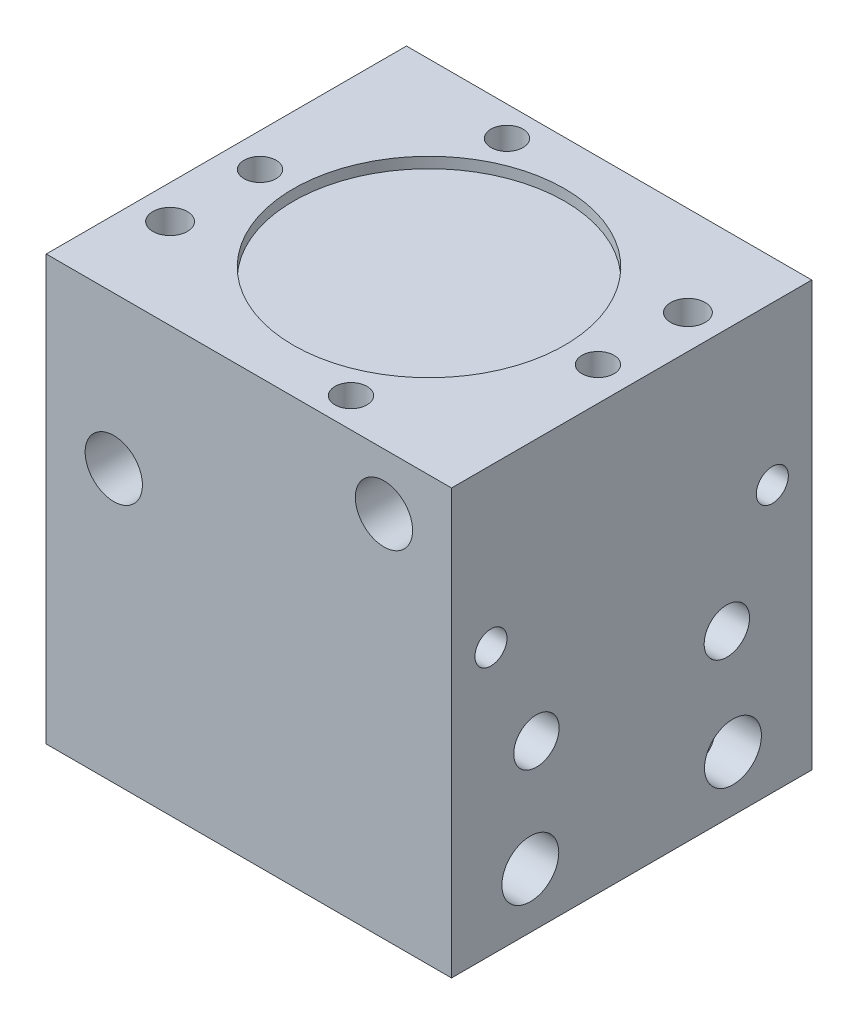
ISO-10303-21;
HEADER;
FILE_DESCRIPTION(('STEP AP214'),'2;1');
FILE_NAME('part.step','',(''),(''),'','','');
FILE_SCHEMA(('AUTOMOTIVE_DESIGN { 1 0 10303 214 1 1 1 1 }'));
ENDSEC;
DATA;
#1=APPLICATION_CONTEXT('core data for automotive mechanical design processes');
#2=APPLICATION_PROTOCOL_DEFINITION('international standard','automotive_design',2000,#1);
#3=PRODUCT_CONTEXT('',#1,'mechanical');
#4=PRODUCT('Part','Part','',(#3));
#5=PRODUCT_RELATED_PRODUCT_CATEGORY('part','',(#4));
#6=PRODUCT_DEFINITION_FORMATION('','',#4);
#7=PRODUCT_DEFINITION_CONTEXT('part definition',#1,'design');
#8=PRODUCT_DEFINITION('design','',#6,#7);
#9=PRODUCT_DEFINITION_SHAPE('','',#8);
#10=(LENGTH_UNIT() NAMED_UNIT(*) SI_UNIT(.MILLI.,.METRE.));
#11=(NAMED_UNIT(*) PLANE_ANGLE_UNIT() SI_UNIT($,.RADIAN.));
#12=(NAMED_UNIT(*) SI_UNIT($,.STERADIAN.) SOLID_ANGLE_UNIT());
#13=UNCERTAINTY_MEASURE_WITH_UNIT(LENGTH_MEASURE(1.E-05),#10,'distance_accuracy_value','');
#14=(GEOMETRIC_REPRESENTATION_CONTEXT(3) GLOBAL_UNCERTAINTY_ASSIGNED_CONTEXT((#13)) GLOBAL_UNIT_ASSIGNED_CONTEXT((#10,
#11,#12)) REPRESENTATION_CONTEXT('',''));
#15=CARTESIAN_POINT('',(0.,0.,0.));
#16=DIRECTION('',(0.,0.,1.));
#17=DIRECTION('',(1.,0.,0.));
#18=AXIS2_PLACEMENT_3D('',#15,#16,#17);
#19=CARTESIAN_POINT('',(-14.2875,14.9606,-12.7));
#20=DIRECTION('',(1.,0.,0.));
#21=DIRECTION('',(0.,0.,-1.));
#22=AXIS2_PLACEMENT_3D('',#19,#20,#21);
#23=PLANE('',#22);
#24=CARTESIAN_POINT('',(-14.2875,-3.4798,-6.71322));
#25=DIRECTION('',(1.,0.,0.));
#26=DIRECTION('',(0.,0.,1.));
#27=AXIS2_PLACEMENT_3D('',#24,#25,#26);
#28=CIRCLE('',#27,1.6002);
#29=CARTESIAN_POINT('',(-14.2875,-3.4798,-5.11302));
#30=VERTEX_POINT('',#29);
#31=EDGE_CURVE('E299',#30,#30,#28,.T.);
#32=ORIENTED_EDGE('',*,*,#31,.T.);
#33=EDGE_LOOP('',(#32));
#34=FACE_BOUND('',#33,.T.);
#35=CARTESIAN_POINT('',(-14.2875,-11.0744,-7.14375));
#36=DIRECTION('',(1.,0.,0.));
#37=DIRECTION('',(0.,0.,1.));
#38=AXIS2_PLACEMENT_3D('',#35,#36,#37);
#39=CIRCLE('',#38,2.0066);
#40=CARTESIAN_POINT('',(-14.2875,-11.0744,-5.13715));
#41=VERTEX_POINT('',#40);
#42=EDGE_CURVE('E383',#41,#41,#39,.T.);
#43=ORIENTED_EDGE('',*,*,#42,.T.);
#44=EDGE_LOOP('',(#43));
#45=FACE_BOUND('',#44,.T.);
#46=CARTESIAN_POINT('',(-14.2875,-11.0744,7.14375));
#47=DIRECTION('',(1.,0.,0.));
#48=DIRECTION('',(0.,0.,-1.));
#49=AXIS2_PLACEMENT_3D('',#46,#47,#48);
#50=CIRCLE('',#49,2.0066);
#51=CARTESIAN_POINT('',(-14.2875,-11.0744,5.13715));
#52=VERTEX_POINT('',#51);
#53=EDGE_CURVE('E387',#52,#52,#50,.T.);
#54=ORIENTED_EDGE('',*,*,#53,.T.);
#55=EDGE_LOOP('',(#54));
#56=FACE_BOUND('',#55,.T.);
#57=CARTESIAN_POINT('',(-14.2875,-3.4798,6.71322));
#58=DIRECTION('',(1.,0.,0.));
#59=DIRECTION('',(0.,0.,-1.));
#60=AXIS2_PLACEMENT_3D('',#57,#58,#59);
#61=CIRCLE('',#60,1.6002);
#62=CARTESIAN_POINT('',(-14.2875,-3.4798,5.11302));
#63=VERTEX_POINT('',#62);
#64=EDGE_CURVE('E391',#63,#63,#61,.T.);
#65=ORIENTED_EDGE('',*,*,#64,.T.);
#66=EDGE_LOOP('',(#65));
#67=FACE_BOUND('',#66,.T.);
#68=DIRECTION('',(0.,0.,1.));
#69=VECTOR('',#68,1.);
#70=CARTESIAN_POINT('',(-14.2875,-14.9606,-12.7));
#71=LINE('',#70,#69);
#72=CARTESIAN_POINT('',(-14.2875,-14.9606,-12.7));
#73=VERTEX_POINT('',#72);
#74=CARTESIAN_POINT('',(-14.2875,-14.9606,12.7));
#75=VERTEX_POINT('',#74);
#76=EDGE_CURVE('E396',#73,#75,#71,.T.);
#77=ORIENTED_EDGE('',*,*,#76,.T.);
#78=DIRECTION('',(0.,-1.,0.));
#79=VECTOR('',#78,1.);
#80=CARTESIAN_POINT('',(-14.2875,14.9606,12.7));
#81=LINE('',#80,#79);
#82=CARTESIAN_POINT('',(-14.2875,14.9606,12.7));
#83=VERTEX_POINT('',#82);
#84=EDGE_CURVE('E399',#83,#75,#81,.T.);
#85=ORIENTED_EDGE('',*,*,#84,.F.);
#86=DIRECTION('',(0.,0.,1.));
#87=VECTOR('',#86,1.);
#88=CARTESIAN_POINT('',(-14.2875,14.9606,-12.7));
#89=LINE('',#88,#87);
#90=CARTESIAN_POINT('',(-14.2875,14.9606,-12.7));
#91=VERTEX_POINT('',#90);
#92=EDGE_CURVE('E420',#91,#83,#89,.T.);
#93=ORIENTED_EDGE('',*,*,#92,.F.);
#94=DIRECTION('',(0.,-1.,0.));
#95=VECTOR('',#94,1.);
#96=CARTESIAN_POINT('',(-14.2875,14.9606,-12.7));
#97=LINE('',#96,#95);
#98=EDGE_CURVE('E401',#91,#73,#97,.T.);
#99=ORIENTED_EDGE('',*,*,#98,.T.);
#100=EDGE_LOOP('',(#77,#85,#93,#99));
#101=FACE_BOUND('',#100,.T.);
#102=ADVANCED_FACE('F38',(#34,#45,#56,#67,#101),#23,.F.);
#103=CARTESIAN_POINT('',(-14.2875,14.9606,12.7));
#104=DIRECTION('',(0.,0.,-1.));
#105=DIRECTION('',(-1.,0.,0.));
#106=AXIS2_PLACEMENT_3D('',#103,#104,#105);
#107=PLANE('',#106);
#108=CARTESIAN_POINT('',(-9.525,4.2418,12.7));
#109=DIRECTION('',(0.,0.,1.));
#110=DIRECTION('',(1.,0.,0.));
#111=AXIS2_PLACEMENT_3D('',#108,#109,#110);
#112=CIRCLE('',#111,2.0193);
#113=CARTESIAN_POINT('',(-7.5057,4.2418,12.7));
#114=VERTEX_POINT('',#113);
#115=EDGE_CURVE('E215',#114,#114,#112,.T.);
#116=ORIENTED_EDGE('',*,*,#115,.F.);
#117=EDGE_LOOP('',(#116));
#118=FACE_BOUND('',#117,.T.);
#119=CARTESIAN_POINT('',(9.525,10.9982,12.7));
#120=DIRECTION('',(0.,0.,1.));
#121=DIRECTION('',(1.,0.,0.));
#122=AXIS2_PLACEMENT_3D('',#119,#120,#121);
#123=CIRCLE('',#122,2.0193);
#124=CARTESIAN_POINT('',(11.5443,10.9982,12.7));
#125=VERTEX_POINT('',#124);
#126=EDGE_CURVE('E223',#125,#125,#123,.T.);
#127=ORIENTED_EDGE('',*,*,#126,.F.);
#128=EDGE_LOOP('',(#127));
#129=FACE_BOUND('',#128,.T.);
#130=DIRECTION('',(1.,0.,0.));
#131=VECTOR('',#130,1.);
#132=CARTESIAN_POINT('',(-14.2875,-14.9606,12.7));
#133=LINE('',#132,#131);
#134=CARTESIAN_POINT('',(14.2875,-14.9606,12.7));
#135=VERTEX_POINT('',#134);
#136=EDGE_CURVE('E404',#75,#135,#133,.T.);
#137=ORIENTED_EDGE('',*,*,#136,.T.);
#138=DIRECTION('',(0.,-1.,0.));
#139=VECTOR('',#138,1.);
#140=CARTESIAN_POINT('',(14.2875,14.9606,12.7));
#141=LINE('',#140,#139);
#142=CARTESIAN_POINT('',(14.2875,14.9606,12.7));
#143=VERTEX_POINT('',#142);
#144=EDGE_CURVE('E425',#143,#135,#141,.T.);
#145=ORIENTED_EDGE('',*,*,#144,.F.);
#146=DIRECTION('',(1.,0.,0.));
#147=VECTOR('',#146,1.);
#148=CARTESIAN_POINT('',(-14.2875,14.9606,12.7));
#149=LINE('',#148,#147);
#150=EDGE_CURVE('E569',#83,#143,#149,.T.);
#151=ORIENTED_EDGE('',*,*,#150,.F.);
#152=ORIENTED_EDGE('',*,*,#84,.T.);
#153=EDGE_LOOP('',(#137,#145,#151,#152));
#154=FACE_BOUND('',#153,.T.);
#155=ADVANCED_FACE('F371',(#118,#129,#154),#107,.F.);
#156=CARTESIAN_POINT('',(14.2875,14.9606,-12.7));
#157=DIRECTION('',(-1.,0.,0.));
#158=DIRECTION('',(0.,0.,1.));
#159=AXIS2_PLACEMENT_3D('',#156,#157,#158);
#160=PLANE('',#159);
#161=CARTESIAN_POINT('',(14.2875,3.8354,9.9187));
#162=DIRECTION('',(1.,0.,0.));
#163=DIRECTION('',(0.,0.,-1.));
#164=AXIS2_PLACEMENT_3D('',#161,#162,#163);
#165=CIRCLE('',#164,1.1303);
#166=CARTESIAN_POINT('',(14.2875,3.8354,8.7884));
#167=VERTEX_POINT('',#166);
#168=EDGE_CURVE('E289',#167,#167,#165,.T.);
#169=ORIENTED_EDGE('',*,*,#168,.F.);
#170=EDGE_LOOP('',(#169));
#171=FACE_BOUND('',#170,.T.);
#172=CARTESIAN_POINT('',(14.2875,3.8354,-9.9187));
#173=DIRECTION('',(1.,0.,0.));
#174=DIRECTION('',(0.,0.,-1.));
#175=AXIS2_PLACEMENT_3D('',#172,#173,#174);
#176=CIRCLE('',#175,1.1303);
#177=CARTESIAN_POINT('',(14.2875,3.8354,-11.049));
#178=VERTEX_POINT('',#177);
#179=EDGE_CURVE('E295',#178,#178,#176,.T.);
#180=ORIENTED_EDGE('',*,*,#179,.F.);
#181=EDGE_LOOP('',(#180));
#182=FACE_BOUND('',#181,.T.);
#183=CARTESIAN_POINT('',(14.2875,-3.4798,-6.71322));
#184=DIRECTION('',(1.,0.,0.));
#185=DIRECTION('',(0.,0.,1.));
#186=AXIS2_PLACEMENT_3D('',#183,#184,#185);
#187=CIRCLE('',#186,1.6002);
#188=CARTESIAN_POINT('',(14.2875,-3.4798,-5.11302));
#189=VERTEX_POINT('',#188);
#190=EDGE_CURVE('E298',#189,#189,#187,.T.);
#191=ORIENTED_EDGE('',*,*,#190,.F.);
#192=EDGE_LOOP('',(#191));
#193=FACE_BOUND('',#192,.T.);
#194=CARTESIAN_POINT('',(14.2875,-11.0744,-7.14375));
#195=DIRECTION('',(1.,0.,0.));
#196=DIRECTION('',(0.,0.,1.));
#197=AXIS2_PLACEMENT_3D('',#194,#195,#196);
#198=CIRCLE('',#197,2.0066);
#199=CARTESIAN_POINT('',(14.2875,-11.0744,-5.13715));
#200=VERTEX_POINT('',#199);
#201=EDGE_CURVE('E621',#200,#200,#198,.T.);
#202=ORIENTED_EDGE('',*,*,#201,.F.);
#203=EDGE_LOOP('',(#202));
#204=FACE_BOUND('',#203,.T.);
#205=CARTESIAN_POINT('',(14.2875,-11.0744,7.14375));
#206=DIRECTION('',(1.,0.,0.));
#207=DIRECTION('',(0.,0.,-1.));
#208=AXIS2_PLACEMENT_3D('',#205,#206,#207);
#209=CIRCLE('',#208,2.0066);
#210=CARTESIAN_POINT('',(14.2875,-11.0744,5.13715));
#211=VERTEX_POINT('',#210);
#212=EDGE_CURVE('E638',#211,#211,#209,.T.);
#213=ORIENTED_EDGE('',*,*,#212,.F.);
#214=EDGE_LOOP('',(#213));
#215=FACE_BOUND('',#214,.T.);
#216=CARTESIAN_POINT('',(14.2875,-3.4798,6.71322));
#217=DIRECTION('',(1.,0.,0.));
#218=DIRECTION('',(0.,0.,-1.));
#219=AXIS2_PLACEMENT_3D('',#216,#217,#218);
#220=CIRCLE('',#219,1.6002);
#221=CARTESIAN_POINT('',(14.2875,-3.4798,5.11302));
#222=VERTEX_POINT('',#221);
#223=EDGE_CURVE('E484',#222,#222,#220,.T.);
#224=ORIENTED_EDGE('',*,*,#223,.F.);
#225=EDGE_LOOP('',(#224));
#226=FACE_BOUND('',#225,.T.);
#227=DIRECTION('',(0.,0.,-1.));
#228=VECTOR('',#227,1.);
#229=CARTESIAN_POINT('',(14.2875,-14.9606,-12.7));
#230=LINE('',#229,#228);
#231=CARTESIAN_POINT('',(14.2875,-14.9606,-12.7));
#232=VERTEX_POINT('',#231);
#233=EDGE_CURVE('E407',#135,#232,#230,.T.);
#234=ORIENTED_EDGE('',*,*,#233,.T.);
#235=DIRECTION('',(0.,-1.,0.));
#236=VECTOR('',#235,1.);
#237=CARTESIAN_POINT('',(14.2875,14.9606,-12.7));
#238=LINE('',#237,#236);
#239=CARTESIAN_POINT('',(14.2875,14.9606,-12.7));
#240=VERTEX_POINT('',#239);
#241=EDGE_CURVE('E422',#240,#232,#238,.T.);
#242=ORIENTED_EDGE('',*,*,#241,.F.);
#243=DIRECTION('',(0.,0.,-1.));
#244=VECTOR('',#243,1.);
#245=CARTESIAN_POINT('',(14.2875,14.9606,-12.7));
#246=LINE('',#245,#244);
#247=EDGE_CURVE('E570',#143,#240,#246,.T.);
#248=ORIENTED_EDGE('',*,*,#247,.F.);
#249=ORIENTED_EDGE('',*,*,#144,.T.);
#250=EDGE_LOOP('',(#234,#242,#248,#249));
#251=FACE_BOUND('',#250,.T.);
#252=ADVANCED_FACE('F376',(#171,#182,#193,#204,#215,#226,#251),#160,.F.);
#253=CARTESIAN_POINT('',(-14.2875,14.9606,-12.7));
#254=DIRECTION('',(0.,0.,1.));
#255=DIRECTION('',(1.,0.,0.));
#256=AXIS2_PLACEMENT_3D('',#253,#254,#255);
#257=PLANE('',#256);
#258=CARTESIAN_POINT('',(-11.1125,10.1854,-12.7));
#259=DIRECTION('',(0.,0.,-1.));
#260=DIRECTION('',(-1.,0.,0.));
#261=AXIS2_PLACEMENT_3D('',#258,#259,#260);
#262=CIRCLE('',#261,1.22555);
#263=CARTESIAN_POINT('',(-12.33805,10.1854,-12.7));
#264=VERTEX_POINT('',#263);
#265=EDGE_CURVE('E262',#264,#264,#262,.T.);
#266=ORIENTED_EDGE('',*,*,#265,.F.);
#267=EDGE_LOOP('',(#266));
#268=FACE_BOUND('',#267,.T.);
#269=CARTESIAN_POINT('',(11.1125,10.1854,-12.7));
#270=DIRECTION('',(0.,0.,-1.));
#271=DIRECTION('',(-1.,0.,0.));
#272=AXIS2_PLACEMENT_3D('',#269,#270,#271);
#273=CIRCLE('',#272,1.22555);
#274=CARTESIAN_POINT('',(9.88695,10.1854,-12.7));
#275=VERTEX_POINT('',#274);
#276=EDGE_CURVE('E266',#275,#275,#273,.T.);
#277=ORIENTED_EDGE('',*,*,#276,.F.);
#278=EDGE_LOOP('',(#277));
#279=FACE_BOUND('',#278,.T.);
#280=CARTESIAN_POINT('',(11.1125,0.673099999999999,-12.7));
#281=DIRECTION('',(0.,0.,-1.));
#282=DIRECTION('',(-1.,0.,0.));
#283=AXIS2_PLACEMENT_3D('',#280,#281,#282);
#284=CIRCLE('',#283,1.13029999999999);
#285=CARTESIAN_POINT('',(9.98220000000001,0.673099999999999,-12.7));
#286=VERTEX_POINT('',#285);
#287=EDGE_CURVE('E277',#286,#286,#284,.T.);
#288=ORIENTED_EDGE('',*,*,#287,.F.);
#289=EDGE_LOOP('',(#288));
#290=FACE_BOUND('',#289,.T.);
#291=CARTESIAN_POINT('',(-11.1125,0.673099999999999,-12.7));
#292=DIRECTION('',(0.,0.,-1.));
#293=DIRECTION('',(-1.,0.,0.));
#294=AXIS2_PLACEMENT_3D('',#291,#292,#293);
#295=CIRCLE('',#294,1.13029999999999);
#296=CARTESIAN_POINT('',(-12.2428,0.673099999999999,-12.7));
#297=VERTEX_POINT('',#296);
#298=EDGE_CURVE('E283',#297,#297,#295,.T.);
#299=ORIENTED_EDGE('',*,*,#298,.F.);
#300=EDGE_LOOP('',(#299));
#301=FACE_BOUND('',#300,.T.);
#302=DIRECTION('',(-1.,0.,0.));
#303=VECTOR('',#302,1.);
#304=CARTESIAN_POINT('',(-14.2875,-14.9606,-12.7));
#305=LINE('',#304,#303);
#306=EDGE_CURVE('E418',#232,#73,#305,.T.);
#307=ORIENTED_EDGE('',*,*,#306,.T.);
#308=ORIENTED_EDGE('',*,*,#98,.F.);
#309=DIRECTION('',(-1.,0.,0.));
#310=VECTOR('',#309,1.);
#311=CARTESIAN_POINT('',(-14.2875,14.9606,-12.7));
#312=LINE('',#311,#310);
#313=EDGE_CURVE('E414',#240,#91,#312,.T.);
#314=ORIENTED_EDGE('',*,*,#313,.F.);
#315=ORIENTED_EDGE('',*,*,#241,.T.);
#316=EDGE_LOOP('',(#307,#308,#314,#315));
#317=FACE_BOUND('',#316,.T.);
#318=ADVANCED_FACE('F576',(#268,#279,#290,#301,#317),#257,.F.);
#319=CARTESIAN_POINT('',(-14.2875,14.9606,-12.7));
#320=DIRECTION('',(0.,1.,0.));
#321=DIRECTION('',(0.,0.,1.));
#322=AXIS2_PLACEMENT_3D('',#319,#320,#321);
#323=PLANE('',#322);
#324=CARTESIAN_POINT('',(11.90625,14.9606,-6.35));
#325=DIRECTION('',(0.,1.,0.));
#326=DIRECTION('',(0.,0.,1.));
#327=AXIS2_PLACEMENT_3D('',#324,#325,#326);
#328=CIRCLE('',#327,1.2192);
#329=CARTESIAN_POINT('',(11.90625,14.9606,-5.1308));
#330=VERTEX_POINT('',#329);
#331=EDGE_CURVE('E226',#330,#330,#328,.T.);
#332=ORIENTED_EDGE('',*,*,#331,.F.);
#333=EDGE_LOOP('',(#332));
#334=FACE_BOUND('',#333,.T.);
#335=CARTESIAN_POINT('',(-11.90625,14.9606,6.35));
#336=DIRECTION('',(0.,1.,0.));
#337=DIRECTION('',(0.,0.,1.));
#338=AXIS2_PLACEMENT_3D('',#335,#336,#337);
#339=CIRCLE('',#338,1.2192);
#340=CARTESIAN_POINT('',(-11.90625,14.9606,7.5692));
#341=VERTEX_POINT('',#340);
#342=EDGE_CURVE('E230',#341,#341,#339,.T.);
#343=ORIENTED_EDGE('',*,*,#342,.F.);
#344=EDGE_LOOP('',(#343));
#345=FACE_BOUND('',#344,.T.);
#346=CARTESIAN_POINT('',(-5.1054,14.9606,-10.6045));
#347=DIRECTION('',(0.,1.,0.));
#348=DIRECTION('',(0.,0.,1.));
#349=AXIS2_PLACEMENT_3D('',#346,#347,#348);
#350=CIRCLE('',#349,1.13029999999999);
#351=CARTESIAN_POINT('',(-5.1054,14.9606,-9.47420000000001));
#352=VERTEX_POINT('',#351);
#353=EDGE_CURVE('E241',#352,#352,#350,.T.);
#354=ORIENTED_EDGE('',*,*,#353,.F.);
#355=EDGE_LOOP('',(#354));
#356=FACE_BOUND('',#355,.T.);
#357=CARTESIAN_POINT('',(-11.9126,14.9606,0.));
#358=DIRECTION('',(0.,1.,0.));
#359=DIRECTION('',(0.,0.,1.));
#360=AXIS2_PLACEMENT_3D('',#357,#358,#359);
#361=CIRCLE('',#360,1.13029999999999);
#362=CARTESIAN_POINT('',(-11.9126,14.9606,1.13029999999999));
#363=VERTEX_POINT('',#362);
#364=EDGE_CURVE('E247',#363,#363,#361,.T.);
#365=ORIENTED_EDGE('',*,*,#364,.F.);
#366=EDGE_LOOP('',(#365));
#367=FACE_BOUND('',#366,.T.);
#368=CARTESIAN_POINT('',(5.1054,14.9606,10.6045));
#369=DIRECTION('',(0.,1.,0.));
#370=DIRECTION('',(0.,0.,1.));
#371=AXIS2_PLACEMENT_3D('',#368,#369,#370);
#372=CIRCLE('',#371,1.13029999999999);
#373=CARTESIAN_POINT('',(5.1054,14.9606,11.7348));
#374=VERTEX_POINT('',#373);
#375=EDGE_CURVE('E253',#374,#374,#372,.T.);
#376=ORIENTED_EDGE('',*,*,#375,.F.);
#377=EDGE_LOOP('',(#376));
#378=FACE_BOUND('',#377,.T.);
#379=CARTESIAN_POINT('',(11.9126,14.9606,0.));
#380=DIRECTION('',(0.,1.,0.));
#381=DIRECTION('',(0.,0.,1.));
#382=AXIS2_PLACEMENT_3D('',#379,#380,#381);
#383=CIRCLE('',#382,1.13029999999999);
#384=CARTESIAN_POINT('',(11.9126,14.9606,1.13029999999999));
#385=VERTEX_POINT('',#384);
#386=EDGE_CURVE('E259',#385,#385,#383,.T.);
#387=ORIENTED_EDGE('',*,*,#386,.F.);
#388=EDGE_LOOP('',(#387));
#389=FACE_BOUND('',#388,.T.);
#390=CARTESIAN_POINT('',(0.,14.9606,0.));
#391=DIRECTION('',(0.,1.,0.));
#392=DIRECTION('',(0.,0.,1.));
#393=AXIS2_PLACEMENT_3D('',#390,#391,#392);
#394=CIRCLE('',#393,9.5631);
#395=CARTESIAN_POINT('',(0.,14.9606,9.5631));
#396=VERTEX_POINT('',#395);
#397=EDGE_CURVE('E462',#396,#396,#394,.T.);
#398=ORIENTED_EDGE('',*,*,#397,.F.);
#399=EDGE_LOOP('',(#398));
#400=FACE_BOUND('',#399,.T.);
#401=ORIENTED_EDGE('',*,*,#92,.T.);
#402=ORIENTED_EDGE('',*,*,#150,.T.);
#403=ORIENTED_EDGE('',*,*,#247,.T.);
#404=ORIENTED_EDGE('',*,*,#313,.T.);
#405=EDGE_LOOP('',(#401,#402,#403,#404));
#406=FACE_BOUND('',#405,.T.);
#407=ADVANCED_FACE('F474',(#334,#345,#356,#367,#378,#389,#400,#406),#323,.T.);
#408=CARTESIAN_POINT('',(-14.2875,-14.9606,-12.7));
#409=DIRECTION('',(0.,1.,0.));
#410=DIRECTION('',(0.,0.,1.));
#411=AXIS2_PLACEMENT_3D('',#408,#409,#410);
#412=PLANE('',#411);
#413=DIRECTION('',(-1.,0.,0.));
#414=VECTOR('',#413,1.);
#415=CARTESIAN_POINT('',(9.271,-14.9606,10.0584));
#416=LINE('',#415,#414);
#417=CARTESIAN_POINT('',(9.271,-14.9606,10.0584));
#418=VERTEX_POINT('',#417);
#419=CARTESIAN_POINT('',(-9.271,-14.9606,10.0584));
#420=VERTEX_POINT('',#419);
#421=EDGE_CURVE('E530',#418,#420,#416,.T.);
#422=ORIENTED_EDGE('',*,*,#421,.F.);
#423=CARTESIAN_POINT('',(9.271,-14.9606,7.67715));
#424=DIRECTION('',(0.,-1.,0.));
#425=DIRECTION('',(0.,0.,1.));
#426=AXIS2_PLACEMENT_3D('',#423,#424,#425);
#427=CIRCLE('',#426,2.38125);
#428=CARTESIAN_POINT('',(11.1252,-14.9606,6.18306368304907));
#429=VERTEX_POINT('',#428);
#430=EDGE_CURVE('E528',#429,#418,#427,.T.);
#431=ORIENTED_EDGE('',*,*,#430,.F.);
#432=DIRECTION('',(0.,0.,1.));
#433=VECTOR('',#432,1.);
#434=CARTESIAN_POINT('',(11.1252,-14.9606,6.18306368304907));
#435=LINE('',#434,#433);
#436=CARTESIAN_POINT('',(11.1252,-14.9606,-6.18306368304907));
#437=VERTEX_POINT('',#436);
#438=EDGE_CURVE('E513',#437,#429,#435,.T.);
#439=ORIENTED_EDGE('',*,*,#438,.F.);
#440=CARTESIAN_POINT('',(9.271,-14.9606,-7.67715));
#441=DIRECTION('',(0.,-1.,0.));
#442=DIRECTION('',(0.,0.,-1.));
#443=AXIS2_PLACEMENT_3D('',#440,#441,#442);
#444=CIRCLE('',#443,2.38125);
#445=CARTESIAN_POINT('',(9.271,-14.9606,-10.0584));
#446=VERTEX_POINT('',#445);
#447=EDGE_CURVE('E544',#446,#437,#444,.T.);
#448=ORIENTED_EDGE('',*,*,#447,.F.);
#449=DIRECTION('',(1.,0.,0.));
#450=VECTOR('',#449,1.);
#451=CARTESIAN_POINT('',(9.271,-14.9606,-10.0584));
#452=LINE('',#451,#450);
#453=CARTESIAN_POINT('',(-9.271,-14.9606,-10.0584));
#454=VERTEX_POINT('',#453);
#455=EDGE_CURVE('E542',#454,#446,#452,.T.);
#456=ORIENTED_EDGE('',*,*,#455,.F.);
#457=CARTESIAN_POINT('',(-9.271,-14.9606,-7.67715));
#458=DIRECTION('',(0.,-1.,0.));
#459=DIRECTION('',(0.,0.,1.));
#460=AXIS2_PLACEMENT_3D('',#457,#458,#459);
#461=CIRCLE('',#460,2.38125);
#462=CARTESIAN_POINT('',(-11.1252,-14.9606,-6.18306368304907));
#463=VERTEX_POINT('',#462);
#464=EDGE_CURVE('E539',#463,#454,#461,.T.);
#465=ORIENTED_EDGE('',*,*,#464,.F.);
#466=DIRECTION('',(0.,0.,-1.));
#467=VECTOR('',#466,1.);
#468=CARTESIAN_POINT('',(-11.1252,-14.9606,6.18306368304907));
#469=LINE('',#468,#467);
#470=CARTESIAN_POINT('',(-11.1252,-14.9606,6.18306368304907));
#471=VERTEX_POINT('',#470);
#472=EDGE_CURVE('E536',#471,#463,#469,.T.);
#473=ORIENTED_EDGE('',*,*,#472,.F.);
#474=CARTESIAN_POINT('',(-9.271,-14.9606,7.67715));
#475=DIRECTION('',(0.,-1.,0.));
#476=DIRECTION('',(0.,0.,-1.));
#477=AXIS2_PLACEMENT_3D('',#474,#475,#476);
#478=CIRCLE('',#477,2.38125);
#479=EDGE_CURVE('E533',#420,#471,#478,.T.);
#480=ORIENTED_EDGE('',*,*,#479,.F.);
#481=EDGE_LOOP('',(#422,#431,#439,#448,#456,#465,#473,#480));
#482=FACE_BOUND('',#481,.T.);
#483=ORIENTED_EDGE('',*,*,#76,.F.);
#484=ORIENTED_EDGE('',*,*,#306,.F.);
#485=ORIENTED_EDGE('',*,*,#233,.F.);
#486=ORIENTED_EDGE('',*,*,#136,.F.);
#487=EDGE_LOOP('',(#483,#484,#485,#486));
#488=FACE_BOUND('',#487,.T.);
#489=ADVANCED_FACE('F471',(#482,#488),#412,.F.);
#490=CARTESIAN_POINT('',(9.271,-0.914400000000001,7.67715));
#491=DIRECTION('',(0.,-1.,0.));
#492=DIRECTION('',(0.,0.,-1.));
#493=AXIS2_PLACEMENT_3D('',#490,#491,#492);
#494=CYLINDRICAL_SURFACE('',#493,2.38125);
#495=DIRECTION('',(0.,-1.,0.));
#496=VECTOR('',#495,1.);
#497=CARTESIAN_POINT('',(11.1252,-0.914400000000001,6.18306368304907));
#498=LINE('',#497,#496);
#499=CARTESIAN_POINT('',(11.1252,-4.98962592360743,6.18306368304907));
#500=VERTEX_POINT('',#499);
#501=CARTESIAN_POINT('',(11.1252,-9.31271746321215,6.18306368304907));
#502=VERTEX_POINT('',#501);
#503=EDGE_CURVE('E410',#500,#502,#498,.T.);
#504=ORIENTED_EDGE('',*,*,#503,.T.);
#505=CARTESIAN_POINT('',(9.271,-10.292163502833,5.2959));
#506=CARTESIAN_POINT('',(9.33752409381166,-10.292133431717,5.29590680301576));
#507=CARTESIAN_POINT('',(9.40411303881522,-10.2853663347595,5.29873386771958));
#508=CARTESIAN_POINT('',(9.53476928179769,-10.2603910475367,5.30963195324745));
#509=CARTESIAN_POINT('',(9.59882234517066,-10.242125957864,5.31772906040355));
#510=CARTESIAN_POINT('',(9.71121559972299,-10.2024559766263,5.33639274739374));
#511=CARTESIAN_POINT('',(9.76018138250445,-10.1823609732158,5.34616818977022));
#512=CARTESIAN_POINT('',(9.85606335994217,-10.1389525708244,5.36836840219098));
#513=CARTESIAN_POINT('',(9.90297779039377,-10.1156364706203,5.38079540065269));
#514=CARTESIAN_POINT('',(10.0412998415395,-10.0425728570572,5.42186903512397));
#515=CARTESIAN_POINT('',(10.1300069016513,-9.98982453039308,5.45425929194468));
#516=CARTESIAN_POINT('',(10.2861285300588,-9.89181672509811,5.52176206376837));
#517=CARTESIAN_POINT('',(10.3544841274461,-9.84693710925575,5.55531169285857));
#518=CARTESIAN_POINT('',(10.4877619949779,-9.75728011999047,5.62882355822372));
#519=CARTESIAN_POINT('',(10.5526822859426,-9.71250281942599,5.66878943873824));
#520=CARTESIAN_POINT('',(10.7419735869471,-9.58059689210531,5.79834062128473));
#521=CARTESIAN_POINT('',(10.8614061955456,-9.49553810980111,5.89780751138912));
#522=CARTESIAN_POINT('',(11.0458538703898,-9.36669802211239,6.08614141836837));
#523=CARTESIAN_POINT('',(11.1156977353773,-9.31863310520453,6.167401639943));
#524=CARTESIAN_POINT('',(11.2457469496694,-9.23235306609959,6.34203480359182));
#525=CARTESIAN_POINT('',(11.3059657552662,-9.19412414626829,6.43539049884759));
#526=CARTESIAN_POINT('',(11.4045779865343,-9.13665860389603,6.61564081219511));
#527=CARTESIAN_POINT('',(11.4449478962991,-9.11525815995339,6.70075498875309));
#528=CARTESIAN_POINT('',(11.515797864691,-9.08359952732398,6.8770056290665));
#529=CARTESIAN_POINT('',(11.5462840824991,-9.07333439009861,6.96813829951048));
#530=CARTESIAN_POINT('',(11.5962044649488,-9.06565194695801,7.15453205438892));
#531=CARTESIAN_POINT('',(11.6155740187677,-9.06830891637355,7.24981387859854));
#532=CARTESIAN_POINT('',(11.6424323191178,-9.08757213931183,7.44064090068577));
#533=CARTESIAN_POINT('',(11.6499240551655,-9.10417488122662,7.53618602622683));
#534=CARTESIAN_POINT('',(11.6534697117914,-9.14886366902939,7.71510718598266));
#535=CARTESIAN_POINT('',(11.6505387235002,-9.17571464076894,7.79877929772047));
#536=CARTESIAN_POINT('',(11.6366425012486,-9.23982031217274,7.96130561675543));
#537=CARTESIAN_POINT('',(11.6256754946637,-9.27707730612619,8.04015875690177));
#538=CARTESIAN_POINT('',(11.5964951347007,-9.36329412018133,8.19586092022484));
#539=CARTESIAN_POINT('',(11.5778987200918,-9.4128069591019,8.27232906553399));
#540=CARTESIAN_POINT('',(11.5356565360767,-9.52086999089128,8.41699482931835));
#541=CARTESIAN_POINT('',(11.5120088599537,-9.5794235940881,8.48518930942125));
#542=CARTESIAN_POINT('',(11.4575392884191,-9.71523352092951,8.62363650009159));
#543=CARTESIAN_POINT('',(11.4261830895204,-9.79397435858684,8.69222421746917));
#544=CARTESIAN_POINT('',(11.3631661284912,-9.96115534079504,8.81647382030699));
#545=CARTESIAN_POINT('',(11.3315049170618,-10.0496128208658,8.87211203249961));
#546=CARTESIAN_POINT('',(11.268091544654,-10.2470358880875,8.97565313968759));
#547=CARTESIAN_POINT('',(11.2368437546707,-10.3571779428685,9.0216618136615));
#548=CARTESIAN_POINT('',(11.1856049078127,-10.5861498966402,9.09371118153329));
#549=CARTESIAN_POINT('',(11.1655790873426,-10.7049516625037,9.11981363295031));
#550=CARTESIAN_POINT('',(11.1438495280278,-10.9299546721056,9.14788522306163));
#551=CARTESIAN_POINT('',(11.1399642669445,-11.0355768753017,9.15273324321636));
#552=CARTESIAN_POINT('',(11.1454381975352,-11.2459316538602,9.1457719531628));
#553=CARTESIAN_POINT('',(11.1547990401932,-11.3506641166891,9.13396056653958));
#554=CARTESIAN_POINT('',(11.1823670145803,-11.540457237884,9.0975159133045));
#555=CARTESIAN_POINT('',(11.1990923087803,-11.6261661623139,9.07499340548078));
#556=CARTESIAN_POINT('',(11.238178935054,-11.7927203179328,9.0194285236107));
#557=CARTESIAN_POINT('',(11.2605422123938,-11.8735638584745,8.98638251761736));
#558=CARTESIAN_POINT('',(11.3124287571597,-12.0426574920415,8.90420093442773));
#559=CARTESIAN_POINT('',(11.3425237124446,-12.1298696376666,8.85329486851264));
#560=CARTESIAN_POINT('',(11.4033270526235,-12.2956558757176,8.73909472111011));
#561=CARTESIAN_POINT('',(11.4340361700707,-12.3742188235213,8.67578494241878));
#562=CARTESIAN_POINT('',(11.4974826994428,-12.5336084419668,8.52613000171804));
#563=CARTESIAN_POINT('',(11.5297319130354,-12.6127082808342,8.43771128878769));
#564=CARTESIAN_POINT('',(11.5853162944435,-12.7550354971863,8.24648966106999));
#565=CARTESIAN_POINT('',(11.6086681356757,-12.818292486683,8.1437141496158));
#566=CARTESIAN_POINT('',(11.6373929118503,-12.9119295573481,7.95490966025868));
#567=CARTESIAN_POINT('',(11.6458598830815,-12.9465814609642,7.87146231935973));
#568=CARTESIAN_POINT('',(11.6536738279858,-13.0043899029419,7.70027566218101));
#569=CARTESIAN_POINT('',(11.6530284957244,-13.0275561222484,7.61254002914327));
#570=CARTESIAN_POINT('',(11.641591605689,-13.0617872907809,7.4351519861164));
#571=CARTESIAN_POINT('',(11.6307757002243,-13.0728230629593,7.34549548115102));
#572=CARTESIAN_POINT('',(11.5988017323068,-13.0828445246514,7.16736285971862));
#573=CARTESIAN_POINT('',(11.5776413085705,-13.0818274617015,7.07888701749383));
#574=CARTESIAN_POINT('',(11.5264461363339,-13.06892738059,6.90838283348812));
#575=CARTESIAN_POINT('',(11.4967019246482,-13.0573769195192,6.82624012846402));
#576=CARTESIAN_POINT('',(11.4292084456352,-13.0252850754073,6.66721701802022));
#577=CARTESIAN_POINT('',(11.3914564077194,-13.0047405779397,6.59033844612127));
#578=CARTESIAN_POINT('',(11.2922187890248,-12.9462380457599,6.41255173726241));
#579=CARTESIAN_POINT('',(11.2273529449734,-12.904593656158,6.31473833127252));
#580=CARTESIAN_POINT('',(11.0870835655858,-12.8106846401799,6.13265105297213));
#581=CARTESIAN_POINT('',(11.0116538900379,-12.7583935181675,6.04841191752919));
#582=CARTESIAN_POINT('',(10.8242649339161,-12.6269447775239,5.86596446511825));
#583=CARTESIAN_POINT('',(10.7088439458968,-12.5448397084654,5.77341407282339));
#584=CARTESIAN_POINT('',(10.5266354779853,-12.4183343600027,5.652541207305));
#585=CARTESIAN_POINT('',(10.4643561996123,-12.3755878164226,5.61522953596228));
#586=CARTESIAN_POINT('',(10.3366509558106,-12.2901253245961,5.54642298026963));
#587=CARTESIAN_POINT('',(10.271226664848,-12.2474093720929,5.51492504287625));
#588=CARTESIAN_POINT('',(10.1337435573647,-12.1615992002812,5.45636674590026));
#589=CARTESIAN_POINT('',(10.061517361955,-12.1185821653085,5.42958575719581));
#590=CARTESIAN_POINT('',(9.91238428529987,-12.0371469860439,5.38257114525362));
#591=CARTESIAN_POINT('',(9.83548016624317,-11.9987261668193,5.3623337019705));
#592=CARTESIAN_POINT('',(9.69803907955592,-11.9410864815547,5.33376730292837));
#593=CARTESIAN_POINT('',(9.63889465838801,-11.9194987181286,5.32369183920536));
#594=CARTESIAN_POINT('',(9.5177313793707,-11.8847063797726,5.30793505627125));
#595=CARTESIAN_POINT('',(9.45572550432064,-11.871467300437,5.30223562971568));
#596=CARTESIAN_POINT('',(9.32907287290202,-11.8563557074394,5.29575747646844));
#597=CARTESIAN_POINT('',(9.26440127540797,-11.8546452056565,5.29504888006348));
#598=CARTESIAN_POINT('',(9.13603037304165,-11.8635900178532,5.29885568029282));
#599=CARTESIAN_POINT('',(9.0723334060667,-11.8742714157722,5.30338209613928));
#600=CARTESIAN_POINT('',(8.93051213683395,-11.909368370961,5.3190007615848));
#601=CARTESIAN_POINT('',(8.85335216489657,-11.9367957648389,5.33157849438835));
#602=CARTESIAN_POINT('',(8.70388048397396,-12.0002272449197,5.36314643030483));
#603=CARTESIAN_POINT('',(8.63159579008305,-12.0362747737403,5.38216932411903));
#604=CARTESIAN_POINT('',(8.49045423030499,-12.1129457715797,5.4262370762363));
#605=CARTESIAN_POINT('',(8.42164034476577,-12.1536125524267,5.45134194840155));
#606=CARTESIAN_POINT('',(8.28744862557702,-12.2367165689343,5.50729616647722));
#607=CARTESIAN_POINT('',(8.22207381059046,-12.2791553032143,5.53815045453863));
#608=CARTESIAN_POINT('',(8.09451270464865,-12.3641293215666,5.60557463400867));
#609=CARTESIAN_POINT('',(8.03232330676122,-12.4066644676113,5.64213880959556));
#610=CARTESIAN_POINT('',(7.91102940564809,-12.4906927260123,5.72111639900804));
#611=CARTESIAN_POINT('',(7.85192527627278,-12.5321857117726,5.76353051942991));
#612=CARTESIAN_POINT('',(7.70218803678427,-12.6376168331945,5.88187309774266));
#613=CARTESIAN_POINT('',(7.61409806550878,-12.6999575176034,5.9625599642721));
#614=CARTESIAN_POINT('',(7.44841511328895,-12.8150417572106,6.13988242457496));
#615=CARTESIAN_POINT('',(7.37080157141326,-12.8678041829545,6.23648592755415));
#616=CARTESIAN_POINT('',(7.24599517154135,-12.9481723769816,6.42057849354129));
#617=CARTESIAN_POINT('',(7.19595101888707,-12.9787766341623,6.50480771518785));
#618=CARTESIAN_POINT('',(7.10565472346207,-13.0291698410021,6.68143720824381));
#619=CARTESIAN_POINT('',(7.06539709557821,-13.0489648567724,6.7738328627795));
#620=CARTESIAN_POINT('',(6.99625237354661,-13.0754323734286,6.96557833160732));
#621=CARTESIAN_POINT('',(6.96746444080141,-13.0819923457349,7.06498040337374));
#622=CARTESIAN_POINT('',(6.92315854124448,-13.0797663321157,7.2665302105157));
#623=CARTESIAN_POINT('',(6.9076297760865,-13.0709928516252,7.36867564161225));
#624=CARTESIAN_POINT('',(6.89109361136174,-13.0398112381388,7.55794706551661));
#625=CARTESIAN_POINT('',(6.88842969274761,-13.0193715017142,7.64526395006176));
#626=CARTESIAN_POINT('',(6.89227580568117,-12.9670863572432,7.81618511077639));
#627=CARTESIAN_POINT('',(6.89878721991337,-12.9352392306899,7.89978882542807));
#628=CARTESIAN_POINT('',(6.91955658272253,-12.8610374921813,8.06153554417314));
#629=CARTESIAN_POINT('',(6.93384724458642,-12.8186389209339,8.13965390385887));
#630=CARTESIAN_POINT('',(6.96833991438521,-12.724658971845,8.28867731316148));
#631=CARTESIAN_POINT('',(6.98854320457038,-12.6730756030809,8.35958079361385));
#632=CARTESIAN_POINT('',(7.03624888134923,-12.5534585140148,8.50347748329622));
#633=CARTESIAN_POINT('',(7.0643928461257,-12.4841168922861,8.5751684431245));
#634=CARTESIAN_POINT('',(7.12286496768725,-12.3360609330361,8.70724638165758));
#635=CARTESIAN_POINT('',(7.15319660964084,-12.257331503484,8.76761474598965));
#636=CARTESIAN_POINT('',(7.21773110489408,-12.0777850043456,8.88530740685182));
#637=CARTESIAN_POINT('',(7.25174339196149,-11.975469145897,8.94047268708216));
#638=CARTESIAN_POINT('',(7.31251685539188,-11.7610618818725,9.03279516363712));
#639=CARTESIAN_POINT('',(7.3392921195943,-11.6489900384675,9.06998745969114));
#640=CARTESIAN_POINT('',(7.37473601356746,-11.4459184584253,9.11770326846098));
#641=CARTESIAN_POINT('',(7.38622490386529,-11.3564251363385,9.13251349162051));
#642=CARTESIAN_POINT('',(7.39973084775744,-11.17560393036,9.14984692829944));
#643=CARTESIAN_POINT('',(7.40176002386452,-11.0842785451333,9.15238586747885));
#644=CARTESIAN_POINT('',(7.39599016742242,-10.9024859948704,9.14504165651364));
#645=CARTESIAN_POINT('',(7.38819336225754,-10.8120186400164,9.13516132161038));
#646=CARTESIAN_POINT('',(7.3641582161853,-10.6342798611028,9.10357468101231));
#647=CARTESIAN_POINT('',(7.34790736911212,-10.5470133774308,9.08185085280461));
#648=CARTESIAN_POINT('',(7.30424438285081,-10.3548109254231,9.02027753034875));
#649=CARTESIAN_POINT('',(7.27501335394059,-10.2513475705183,8.97714414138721));
#650=CARTESIAN_POINT('',(7.21213885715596,-10.0539423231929,8.87507812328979));
#651=CARTESIAN_POINT('',(7.17848866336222,-9.96001533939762,8.81612126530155));
#652=CARTESIAN_POINT('',(7.11117086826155,-9.7818909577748,8.68270847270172));
#653=CARTESIAN_POINT('',(7.07750819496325,-9.69782820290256,8.60806993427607));
#654=CARTESIAN_POINT('',(7.01516958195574,-9.54256468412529,8.44474061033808));
#655=CARTESIAN_POINT('',(6.98648612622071,-9.47134452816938,8.35607139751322));
#656=CARTESIAN_POINT('',(6.94283402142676,-9.35566265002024,8.18351705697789));
#657=CARTESIAN_POINT('',(6.92631774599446,-9.30868958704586,8.10171217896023));
#658=CARTESIAN_POINT('',(6.9017843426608,-9.22636433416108,7.93124293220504));
#659=CARTESIAN_POINT('',(6.89376107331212,-9.19100375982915,7.84258356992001));
#660=CARTESIAN_POINT('',(6.8880571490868,-9.13305736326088,7.66029576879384));
#661=CARTESIAN_POINT('',(6.89043092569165,-9.11053947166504,7.56664372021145));
#662=CARTESIAN_POINT('',(6.90671559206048,-9.079237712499,7.37805684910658));
#663=CARTESIAN_POINT('',(6.92062382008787,-9.07045067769,7.28312232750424));
#664=CARTESIAN_POINT('',(6.95820431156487,-9.06636705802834,7.10355169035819));
#665=CARTESIAN_POINT('',(6.98092732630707,-9.06996871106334,7.01873538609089));
#666=CARTESIAN_POINT('',(7.03518926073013,-9.08721838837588,6.85307158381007));
#667=CARTESIAN_POINT('',(7.06672981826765,-9.10086827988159,6.77222482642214));
#668=CARTESIAN_POINT('',(7.13969794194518,-9.13788138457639,6.61122553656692));
#669=CARTESIAN_POINT('',(7.18161607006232,-9.16179275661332,6.53142469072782));
#670=CARTESIAN_POINT('',(7.27269611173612,-9.21744312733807,6.37906382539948));
#671=CARTESIAN_POINT('',(7.32186193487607,-9.24918635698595,6.30650774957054));
#672=CARTESIAN_POINT('',(7.45557723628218,-9.3383582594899,6.13028459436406));
#673=CARTESIAN_POINT('',(7.54445638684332,-9.40018254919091,6.03211848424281));
#674=CARTESIAN_POINT('',(7.73339643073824,-9.53299889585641,5.85422103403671));
#675=CARTESIAN_POINT('',(7.83348947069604,-9.60401740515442,5.77454481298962));
#676=CARTESIAN_POINT('',(7.9920543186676,-9.71434955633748,5.66745873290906));
#677=CARTESIAN_POINT('',(8.04714036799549,-9.75231618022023,5.63345401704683));
#678=CARTESIAN_POINT('',(8.15979361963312,-9.82842674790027,5.57007822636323));
#679=CARTESIAN_POINT('',(8.21736016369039,-9.86657064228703,5.54070593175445));
#680=CARTESIAN_POINT('',(8.33508679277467,-9.94198306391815,5.48657604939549));
#681=CARTESIAN_POINT('',(8.39524436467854,-9.97925238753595,5.46181410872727));
#682=CARTESIAN_POINT('',(8.51857590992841,-10.0514630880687,5.41694826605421));
#683=CARTESIAN_POINT('',(8.58174702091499,-10.0864066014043,5.39684004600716));
#684=CARTESIAN_POINT('',(8.70911453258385,-10.1503226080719,5.36223788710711));
#685=CARTESIAN_POINT('',(8.77316092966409,-10.1794820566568,5.34754643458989));
#686=CARTESIAN_POINT('',(8.90509133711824,-10.2300305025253,5.32323497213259));
#687=CARTESIAN_POINT('',(8.97295767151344,-10.2514523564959,5.3135934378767));
#688=CARTESIAN_POINT('',(9.07988929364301,-10.2748937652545,5.30328368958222));
#689=CARTESIAN_POINT('',(9.11778151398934,-10.2813048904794,5.30052774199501));
#690=CARTESIAN_POINT('',(9.19410888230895,-10.289946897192,5.29683460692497));
#691=CARTESIAN_POINT('',(9.2325436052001,-10.2921808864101,5.29589606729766));
#692=CARTESIAN_POINT('',(9.271,-10.292163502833,5.2959));
#693=B_SPLINE_CURVE_WITH_KNOTS('',3,(#505,#506,#507,#508,#509,#510,#511,#512,#513,#514,#515,
#516,#517,#518,#519,#520,#521,#522,#523,#524,#525,#526,#527,#528,#529,#530,#531,#532,#533,#534,
#535,#536,#537,#538,#539,#540,#541,#542,#543,#544,#545,#546,#547,#548,#549,#550,#551,#552,#553,
#554,#555,#556,#557,#558,#559,#560,#561,#562,#563,#564,#565,#566,#567,#568,#569,#570,#571,#572,
#573,#574,#575,#576,#577,#578,#579,#580,#581,#582,#583,#584,#585,#586,#587,#588,#589,#590,#591,
#592,#593,#594,#595,#596,#597,#598,#599,#600,#601,#602,#603,#604,#605,#606,#607,#608,#609,#610,
#611,#612,#613,#614,#615,#616,#617,#618,#619,#620,#621,#622,#623,#624,#625,#626,#627,#628,#629,
#630,#631,#632,#633,#634,#635,#636,#637,#638,#639,#640,#641,#642,#643,#644,#645,#646,#647,#648,
#649,#650,#651,#652,#653,#654,#655,#656,#657,#658,#659,#660,#661,#662,#663,#664,#665,#666,#667,
#668,#669,#670,#671,#672,#673,#674,#675,#676,#677,#678,#679,#680,#681,#682,#683,#684,#685,#686,
#687,#688,#689,#690,#691,#692),.UNSPECIFIED.,.T.,.F.,(4,2,2,2,2,2,2,2,2,2,2,2,2,2,2,2,2,2,2,2,2,
2,2,2,2,2,2,2,2,2,2,2,2,2,2,2,2,2,2,2,2,2,2,2,2,2,2,2,2,2,2,2,2,2,2,2,2,2,2,2,2,2,2,2,2,2,2,2,2,
2,2,2,2,2,2,2,2,2,2,2,2,2,2,2,2,2,2,2,2,2,2,2,2,4),(0.,0.199382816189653,0.399760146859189,
0.561003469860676,0.7223828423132,1.04605039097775,1.31093232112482,1.57596523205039,
2.10401696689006,2.45521772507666,2.80592311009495,3.09456272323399,3.38302211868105,
3.67314151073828,3.9631878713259,4.22579241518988,4.48845490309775,4.76633713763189,
5.04432445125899,5.37014562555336,5.69655784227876,6.06463969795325,6.43157490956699,
6.7468809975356,7.06222638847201,7.33178359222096,7.60143392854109,7.91639261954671,
8.23175250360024,8.59863044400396,8.96481744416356,9.23591456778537,9.50678280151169,
9.77830113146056,10.0498814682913,10.3131736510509,10.5765570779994,10.94808661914,
11.3205523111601,11.8252493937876,12.0778270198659,12.3302716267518,12.5946229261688,
12.8588196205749,13.0495780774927,13.2395428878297,13.4321718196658,13.6252069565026,
13.872383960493,14.1208339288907,14.3718431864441,14.6230692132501,14.8740453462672,
15.1250518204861,15.5278203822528,15.9297866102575,16.2365543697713,16.5431497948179,
16.852341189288,17.1612805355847,17.4291349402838,17.6970297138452,17.9660598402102,
18.2351483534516,18.5448849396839,18.8551263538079,19.2167358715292,19.5776363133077,
19.8507385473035,20.1234907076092,20.3961810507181,20.669275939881,21.0149957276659,
21.3612479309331,21.7117808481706,22.0617799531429,22.3479028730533,22.633818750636,
22.9212332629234,23.2085814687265,23.4710600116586,23.7335873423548,24.0123391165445,
24.2912418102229,24.7272683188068,25.1645784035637,25.3895751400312,25.6145125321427,
25.8392364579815,26.0637510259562,26.2789964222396,26.4933167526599,26.6086622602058,
26.7239219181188),.UNSPECIFIED.);
#694=CARTESIAN_POINT('',(11.1252,-12.8360825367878,6.18306368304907));
#695=VERTEX_POINT('',#694);
#696=EDGE_CURVE('E478',#502,#695,#693,.T.);
#697=ORIENTED_EDGE('',*,*,#696,.T.);
#698=EDGE_CURVE('E412',#695,#429,#498,.T.);
#699=ORIENTED_EDGE('',*,*,#698,.T.);
#700=ORIENTED_EDGE('',*,*,#430,.T.);
#701=DIRECTION('',(0.,-1.,0.));
#702=VECTOR('',#701,1.);
#703=CARTESIAN_POINT('',(9.271,-0.914400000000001,10.0584));
#704=LINE('',#703,#702);
#705=CARTESIAN_POINT('',(9.271,-0.914400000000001,10.0584));
#706=VERTEX_POINT('',#705);
#707=EDGE_CURVE('E508',#706,#418,#704,.T.);
#708=ORIENTED_EDGE('',*,*,#707,.F.);
#709=CARTESIAN_POINT('',(9.271,-0.914400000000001,7.67715));
#710=DIRECTION('',(0.,-1.,0.));
#711=DIRECTION('',(0.,0.,1.));
#712=AXIS2_PLACEMENT_3D('',#709,#710,#711);
#713=CIRCLE('',#712,2.38125);
#714=CARTESIAN_POINT('',(11.1252,-0.914400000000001,6.18306368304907));
#715=VERTEX_POINT('',#714);
#716=EDGE_CURVE('E505',#715,#706,#713,.T.);
#717=ORIENTED_EDGE('',*,*,#716,.F.);
#718=CARTESIAN_POINT('',(11.1252,-1.96997407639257,6.18306368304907));
#719=VERTEX_POINT('',#718);
#720=EDGE_CURVE('E405',#715,#719,#498,.T.);
#721=ORIENTED_EDGE('',*,*,#720,.T.);
#722=CARTESIAN_POINT('',(11.1252,-1.96997407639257,6.18306368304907));
#723=CARTESIAN_POINT('',(11.1528511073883,-1.95792713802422,6.21738104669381));
#724=CARTESIAN_POINT('',(11.1797117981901,-1.94684956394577,6.25266647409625));
#725=CARTESIAN_POINT('',(11.2317172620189,-1.92691527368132,6.3251384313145));
#726=CARTESIAN_POINT('',(11.2568601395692,-1.91806098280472,6.36232698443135));
#727=CARTESIAN_POINT('',(11.3297108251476,-1.89520285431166,6.47703564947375));
#728=CARTESIAN_POINT('',(11.3745050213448,-1.88505547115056,6.55728561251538));
#729=CARTESIAN_POINT('',(11.4549442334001,-1.87745763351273,6.72356666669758));
#730=CARTESIAN_POINT('',(11.4905249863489,-1.88009395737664,6.80963334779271));
#731=CARTESIAN_POINT('',(11.5508371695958,-1.90018626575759,6.98353028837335));
#732=CARTESIAN_POINT('',(11.5756114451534,-1.91758290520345,7.07135211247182));
#733=CARTESIAN_POINT('',(11.6118152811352,-1.96447537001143,7.23340174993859));
#734=CARTESIAN_POINT('',(11.6245762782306,-1.99206705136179,7.30789150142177));
#735=CARTESIAN_POINT('',(11.6427738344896,-2.05848477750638,7.45271449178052));
#736=CARTESIAN_POINT('',(11.6482032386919,-2.0973217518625,7.52304360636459));
#737=CARTESIAN_POINT('',(11.653040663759,-2.18387177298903,7.65516813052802));
#738=CARTESIAN_POINT('',(11.6526245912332,-2.23128328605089,7.71715636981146));
#739=CARTESIAN_POINT('',(11.6478266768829,-2.33450134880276,7.83347951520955));
#740=CARTESIAN_POINT('',(11.6434446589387,-2.39030827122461,7.88781408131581));
#741=CARTESIAN_POINT('',(11.6319519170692,-2.51440949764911,7.99220849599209));
#742=CARTESIAN_POINT('',(11.6246316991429,-2.58337487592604,8.04144781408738));
#743=CARTESIAN_POINT('',(11.6095128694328,-2.72818170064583,8.12844129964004));
#744=CARTESIAN_POINT('',(11.6017140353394,-2.8040263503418,8.16619008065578));
#745=CARTESIAN_POINT('',(11.587108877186,-2.96608921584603,8.23139746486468));
#746=CARTESIAN_POINT('',(11.5804031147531,-3.05266187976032,8.25800429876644));
#747=CARTESIAN_POINT('',(11.5704466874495,-3.22923078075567,8.2962580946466));
#748=CARTESIAN_POINT('',(11.5671948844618,-3.31922587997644,8.30790998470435));
#749=CARTESIAN_POINT('',(11.565025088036,-3.49783129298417,8.3157547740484));
#750=CARTESIAN_POINT('',(11.5660076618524,-3.58642486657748,8.31230232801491));
#751=CARTESIAN_POINT('',(11.5718310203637,-3.76170423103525,8.29086638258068));
#752=CARTESIAN_POINT('',(11.5766721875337,-3.84838983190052,8.27288144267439));
#753=CARTESIAN_POINT('',(11.5889192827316,-4.01645958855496,8.2232628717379));
#754=CARTESIAN_POINT('',(11.5962951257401,-4.09789318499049,8.19178831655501));
#755=CARTESIAN_POINT('',(11.6117668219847,-4.25454299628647,8.11606930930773));
#756=CARTESIAN_POINT('',(11.6198629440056,-4.3297568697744,8.07182007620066));
#757=CARTESIAN_POINT('',(11.634781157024,-4.47468909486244,7.96978974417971));
#758=CARTESIAN_POINT('',(11.6415468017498,-4.54411160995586,7.91157835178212));
#759=CARTESIAN_POINT('',(11.65070291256,-4.67228977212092,7.78409228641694));
#760=CARTESIAN_POINT('',(11.6530950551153,-4.73104949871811,7.71482186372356));
#761=CARTESIAN_POINT('',(11.6509015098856,-4.8339969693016,7.57017158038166));
#762=CARTESIAN_POINT('',(11.6465767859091,-4.87865249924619,7.4951226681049));
#763=CARTESIAN_POINT('',(11.6294917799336,-4.95486640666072,7.33956102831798));
#764=CARTESIAN_POINT('',(11.6167390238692,-4.98643642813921,7.25905323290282));
#765=CARTESIAN_POINT('',(11.5834417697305,-5.03349341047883,7.10387332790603));
#766=CARTESIAN_POINT('',(11.5637719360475,-5.0502422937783,7.02939158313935));
#767=CARTESIAN_POINT('',(11.5166504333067,-5.07291613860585,6.88125726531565));
#768=CARTESIAN_POINT('',(11.4891975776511,-5.07883944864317,6.80760482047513));
#769=CARTESIAN_POINT('',(11.4270982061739,-5.08085078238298,6.66336232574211));
#770=CARTESIAN_POINT('',(11.3924546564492,-5.07694285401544,6.59277102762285));
#771=CARTESIAN_POINT('',(11.3168530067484,-5.0607084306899,6.45611076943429));
#772=CARTESIAN_POINT('',(11.2758945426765,-5.04838145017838,6.39004207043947));
#773=CARTESIAN_POINT('',(11.2152108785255,-5.02644594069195,6.30190142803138));
#774=CARTESIAN_POINT('',(11.1977108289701,-5.01973890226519,6.27749517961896));
#775=CARTESIAN_POINT('',(11.1619919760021,-5.0053745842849,6.22960416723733));
#776=CARTESIAN_POINT('',(11.1437751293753,-4.99771978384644,6.20611720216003));
#777=CARTESIAN_POINT('',(11.1252,-4.98962592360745,6.18306368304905));
#778=B_SPLINE_CURVE_WITH_KNOTS('',3,(#722,#723,#724,#725,#726,#727,#728,#729,#730,#731,#732,
#733,#734,#735,#736,#737,#738,#739,#740,#741,#742,#743,#744,#745,#746,#747,#748,#749,#750,#751,
#752,#753,#754,#755,#756,#757,#758,#759,#760,#761,#762,#763,#764,#765,#766,#767,#768,#769,#770,
#771,#772,#773,#774,#775,#776,#777),.UNSPECIFIED.,.F.,.F.,(4,2,2,2,2,2,2,2,2,2,2,2,2,2,2,2,2,2,
2,2,2,2,2,2,2,2,2,4),(0.,0.137013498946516,0.274175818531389,0.55014347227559,0.827987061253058,
1.10471882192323,1.34485681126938,1.58522898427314,1.8183835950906,2.05154856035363,
2.30562688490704,2.55982413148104,2.83093442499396,3.10195535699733,3.36664722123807,
3.63136532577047,3.89304411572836,4.15482096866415,4.42603427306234,4.69714359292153,
4.95798025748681,5.21858431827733,5.45393835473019,5.68932829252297,5.92462132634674,
6.15992793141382,6.25221668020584,6.34426893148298),.UNSPECIFIED.);
#779=EDGE_CURVE('E454',#719,#500,#778,.T.);
#780=ORIENTED_EDGE('',*,*,#779,.T.);
#781=EDGE_LOOP('',(#504,#697,#699,#700,#708,#717,#721,#780));
#782=FACE_BOUND('',#781,.T.);
#783=ADVANCED_FACE('F467',(#782),#494,.F.);
#784=CARTESIAN_POINT('',(11.1252,-0.914400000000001,6.18306368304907));
#785=DIRECTION('',(1.,0.,0.));
#786=DIRECTION('',(0.,0.,-1.));
#787=AXIS2_PLACEMENT_3D('',#784,#785,#786);
#788=PLANE('',#787);
#789=DIRECTION('',(0.,-1.,0.));
#790=VECTOR('',#789,1.);
#791=CARTESIAN_POINT('',(11.1252,-0.914400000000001,-6.18306368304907));
#792=LINE('',#791,#790);
#793=CARTESIAN_POINT('',(11.1252,-0.914400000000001,-6.18306368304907));
#794=VERTEX_POINT('',#793);
#795=CARTESIAN_POINT('',(11.1252,-1.96997407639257,-6.18306368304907));
#796=VERTEX_POINT('',#795);
#797=EDGE_CURVE('E549',#794,#796,#792,.T.);
#798=ORIENTED_EDGE('',*,*,#797,.T.);
#799=CARTESIAN_POINT('',(11.1252,-3.4798,-6.71322));
#800=DIRECTION('',(1.,0.,0.));
#801=DIRECTION('',(0.,0.,-1.));
#802=AXIS2_PLACEMENT_3D('',#799,#800,#801);
#803=CIRCLE('',#802,1.6002);
#804=CARTESIAN_POINT('',(11.1252,-4.98962592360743,-6.18306368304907));
#805=VERTEX_POINT('',#804);
#806=EDGE_CURVE('E56',#796,#805,#803,.T.);
#807=ORIENTED_EDGE('',*,*,#806,.T.);
#808=CARTESIAN_POINT('',(11.1252,-9.31271746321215,-6.18306368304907));
#809=VERTEX_POINT('',#808);
#810=EDGE_CURVE('E551',#805,#809,#792,.T.);
#811=ORIENTED_EDGE('',*,*,#810,.T.);
#812=CARTESIAN_POINT('',(11.1252,-11.0744,-7.14375));
#813=DIRECTION('',(1.,0.,0.));
#814=DIRECTION('',(0.,0.,-1.));
#815=AXIS2_PLACEMENT_3D('',#812,#813,#814);
#816=CIRCLE('',#815,2.0066);
#817=CARTESIAN_POINT('',(11.1252,-12.8360825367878,-6.18306368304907));
#818=VERTEX_POINT('',#817);
#819=EDGE_CURVE('E351',#809,#818,#816,.T.);
#820=ORIENTED_EDGE('',*,*,#819,.T.);
#821=EDGE_CURVE('E552',#818,#437,#792,.T.);
#822=ORIENTED_EDGE('',*,*,#821,.T.);
#823=ORIENTED_EDGE('',*,*,#438,.T.);
#824=ORIENTED_EDGE('',*,*,#698,.F.);
#825=CARTESIAN_POINT('',(11.1252,-11.0744,7.14375));
#826=DIRECTION('',(1.,0.,0.));
#827=DIRECTION('',(0.,0.,-1.));
#828=AXIS2_PLACEMENT_3D('',#825,#826,#827);
#829=CIRCLE('',#828,2.0066);
#830=EDGE_CURVE('E485',#695,#502,#829,.T.);
#831=ORIENTED_EDGE('',*,*,#830,.T.);
#832=ORIENTED_EDGE('',*,*,#503,.F.);
#833=CARTESIAN_POINT('',(11.1252,-3.4798,6.71322));
#834=DIRECTION('',(1.,0.,0.));
#835=DIRECTION('',(0.,0.,-1.));
#836=AXIS2_PLACEMENT_3D('',#833,#834,#835);
#837=CIRCLE('',#836,1.6002);
#838=EDGE_CURVE('E463',#500,#719,#837,.T.);
#839=ORIENTED_EDGE('',*,*,#838,.T.);
#840=ORIENTED_EDGE('',*,*,#720,.F.);
#841=DIRECTION('',(0.,0.,1.));
#842=VECTOR('',#841,1.);
#843=CARTESIAN_POINT('',(11.1252,-0.914400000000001,6.18306368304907));
#844=LINE('',#843,#842);
#845=EDGE_CURVE('E516',#794,#715,#844,.T.);
#846=ORIENTED_EDGE('',*,*,#845,.F.);
#847=EDGE_LOOP('',(#798,#807,#811,#820,#822,#823,#824,#831,#832,#839,#840,#846));
#848=FACE_BOUND('',#847,.T.);
#849=ADVANCED_FACE('F358',(#848),#788,.F.);
#850=CARTESIAN_POINT('',(9.271,-0.914400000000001,-7.67715));
#851=DIRECTION('',(0.,-1.,0.));
#852=DIRECTION('',(0.,0.,-1.));
#853=AXIS2_PLACEMENT_3D('',#850,#851,#852);
#854=CYLINDRICAL_SURFACE('',#853,2.38125);
#855=ORIENTED_EDGE('',*,*,#810,.F.);
#856=CARTESIAN_POINT('',(6.97632964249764,-3.4798,-8.31342));
#857=CARTESIAN_POINT('',(6.97632304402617,-3.56856610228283,-8.31341492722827));
#858=CARTESIAN_POINT('',(6.97423252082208,-3.65741506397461,-8.3060016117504));
#859=CARTESIAN_POINT('',(6.96638432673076,-3.83258210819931,-8.27658145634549));
#860=CARTESIAN_POINT('',(6.96062072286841,-3.91889585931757,-8.25455100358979));
#861=CARTESIAN_POINT('',(6.94692006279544,-4.0863498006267,-8.19665102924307));
#862=CARTESIAN_POINT('',(6.93898767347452,-4.16750064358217,-8.16081115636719));
#863=CARTESIAN_POINT('',(6.92304008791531,-4.32277651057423,-8.0762493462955));
#864=CARTESIAN_POINT('',(6.91502488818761,-4.39690123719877,-8.02752686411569));
#865=CARTESIAN_POINT('',(6.90121610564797,-4.53773601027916,-7.91720450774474));
#866=CARTESIAN_POINT('',(6.89547353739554,-4.6042542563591,-7.85535220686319));
#867=CARTESIAN_POINT('',(6.88921189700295,-4.72597516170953,-7.72112880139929));
#868=CARTESIAN_POINT('',(6.8886897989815,-4.78118435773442,-7.64876381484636));
#869=CARTESIAN_POINT('',(6.89524168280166,-4.87579862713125,-7.50009001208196));
#870=CARTESIAN_POINT('',(6.90190603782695,-4.915897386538,-7.42420667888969));
#871=CARTESIAN_POINT('',(6.92382957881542,-4.98312136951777,-7.2680838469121));
#872=CARTESIAN_POINT('',(6.93908248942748,-5.01025603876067,-7.187847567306));
#873=CARTESIAN_POINT('',(6.97706568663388,-5.04939241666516,-7.03377532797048));
#874=CARTESIAN_POINT('',(6.9989808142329,-5.06255485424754,-6.96002814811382));
#875=CARTESIAN_POINT('',(7.05031973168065,-5.07850681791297,-6.81406368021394));
#876=CARTESIAN_POINT('',(7.07974460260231,-5.08129484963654,-6.74184661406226));
#877=CARTESIAN_POINT('',(7.14618306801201,-5.07756788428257,-6.59926454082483));
#878=CARTESIAN_POINT('',(7.1833560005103,-5.07083689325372,-6.52898063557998));
#879=CARTESIAN_POINT('',(7.26385962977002,-5.049222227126,-6.39341738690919));
#880=CARTESIAN_POINT('',(7.30719298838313,-5.03433501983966,-6.328140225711));
#881=CARTESIAN_POINT('',(7.42250686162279,-4.98869824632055,-6.17145667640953));
#882=CARTESIAN_POINT('',(7.49781758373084,-4.95373066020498,-6.083725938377));
#883=CARTESIAN_POINT('',(7.65757619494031,-4.87369164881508,-5.9220960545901));
#884=CARTESIAN_POINT('',(7.74205124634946,-4.82858973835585,-5.84823990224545));
#885=CARTESIAN_POINT('',(7.88872919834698,-4.74872693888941,-5.73676546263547));
#886=CARTESIAN_POINT('',(7.94893139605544,-4.71555274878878,-5.69528893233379));
#887=CARTESIAN_POINT('',(8.07233575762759,-4.64788547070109,-5.6183041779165));
#888=CARTESIAN_POINT('',(8.13553776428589,-4.61339245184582,-5.58279564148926));
#889=CARTESIAN_POINT('',(8.26491613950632,-4.54447045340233,-5.51766061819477));
#890=CARTESIAN_POINT('',(8.33109205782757,-4.51004146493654,-5.48803324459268));
#891=CARTESIAN_POINT('',(8.46662753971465,-4.44303577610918,-5.43468778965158));
#892=CARTESIAN_POINT('',(8.53598400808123,-4.41045734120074,-5.41096410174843));
#893=CARTESIAN_POINT('',(8.67570528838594,-4.35085514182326,-5.37040605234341));
#894=CARTESIAN_POINT('',(8.74593147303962,-4.32366726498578,-5.35334402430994));
#895=CARTESIAN_POINT('',(8.88995900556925,-4.27696666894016,-5.32544830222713));
#896=CARTESIAN_POINT('',(8.96374573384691,-4.25742514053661,-5.31459115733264));
#897=CARTESIAN_POINT('',(9.10271043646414,-4.23242461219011,-5.30099539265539));
#898=CARTESIAN_POINT('',(9.16746436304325,-4.22526042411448,-5.29726405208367));
#899=CARTESIAN_POINT('',(9.2973471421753,-4.22125662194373,-5.29516150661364));
#900=CARTESIAN_POINT('',(9.36247562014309,-4.22440804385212,-5.29678564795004));
#901=CARTESIAN_POINT('',(9.50720680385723,-4.24220239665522,-5.30627318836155));
#902=CARTESIAN_POINT('',(9.58636514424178,-4.25951706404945,-5.3155926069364));
#903=CARTESIAN_POINT('',(9.74084969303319,-4.30402616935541,-5.34138426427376));
#904=CARTESIAN_POINT('',(9.81615138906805,-4.331276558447,-5.35789711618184));
#905=CARTESIAN_POINT('',(9.9561685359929,-4.3883587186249,-5.39555866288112));
#906=CARTESIAN_POINT('',(10.021226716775,-4.41773721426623,-5.41615615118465));
#907=CARTESIAN_POINT('',(10.1485118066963,-4.47863358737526,-5.46244574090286));
#908=CARTESIAN_POINT('',(10.2107363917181,-4.51015316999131,-5.48814193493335));
#909=CARTESIAN_POINT('',(10.3325505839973,-4.57372371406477,-5.54455457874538));
#910=CARTESIAN_POINT('',(10.3921410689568,-4.60577449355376,-5.57526934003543));
#911=CARTESIAN_POINT('',(10.5087800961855,-4.66923565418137,-5.64177345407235));
#912=CARTESIAN_POINT('',(10.5658282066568,-4.70064592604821,-5.67756366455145));
#913=CARTESIAN_POINT('',(10.7155351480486,-4.78279920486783,-5.78065402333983));
#914=CARTESIAN_POINT('',(10.8058083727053,-4.83204077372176,-5.85274047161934));
#915=CARTESIAN_POINT('',(10.9771940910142,-4.92103873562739,-6.01195932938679));
#916=CARTESIAN_POINT('',(11.0583270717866,-4.96081657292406,-6.09905693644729));
#917=CARTESIAN_POINT('',(11.1891365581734,-5.01720867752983,-6.26326496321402));
#918=CARTESIAN_POINT('',(11.2415026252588,-5.03715752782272,-6.33706937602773));
#919=CARTESIAN_POINT('',(11.3382428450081,-5.06655092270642,-6.49175684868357));
#920=CARTESIAN_POINT('',(11.3826211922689,-5.07600099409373,-6.5726361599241));
#921=CARTESIAN_POINT('',(11.4621891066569,-5.08198514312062,-6.74028433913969));
#922=CARTESIAN_POINT('',(11.4972895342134,-5.07839848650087,-6.82710091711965));
#923=CARTESIAN_POINT('',(11.5565544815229,-5.05610491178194,-7.00251227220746));
#924=CARTESIAN_POINT('',(11.5807294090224,-5.03741243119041,-7.09110527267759));
#925=CARTESIAN_POINT('',(11.6154828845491,-4.98813716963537,-7.25330962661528));
#926=CARTESIAN_POINT('',(11.6275105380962,-4.95963482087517,-7.32725299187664));
#927=CARTESIAN_POINT('',(11.644385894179,-4.891577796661,-7.47073235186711));
#928=CARTESIAN_POINT('',(11.6492333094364,-4.85202267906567,-7.54026817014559));
#929=CARTESIAN_POINT('',(11.6531237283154,-4.76395429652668,-7.67117173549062));
#930=CARTESIAN_POINT('',(11.6523001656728,-4.71567282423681,-7.732692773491));
#931=CARTESIAN_POINT('',(11.6468180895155,-4.61077318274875,-7.84795244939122));
#932=CARTESIAN_POINT('',(11.6421583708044,-4.55415239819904,-7.90168863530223));
#933=CARTESIAN_POINT('',(11.6302244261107,-4.42831591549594,-8.00479460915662));
#934=CARTESIAN_POINT('',(11.6227498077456,-4.35842160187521,-8.05331354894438));
#935=CARTESIAN_POINT('',(11.6074983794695,-4.21184850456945,-8.13868280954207));
#936=CARTESIAN_POINT('',(11.5997214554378,-4.13516714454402,-8.17552867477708));
#937=CARTESIAN_POINT('',(11.5853618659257,-3.97179515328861,-8.23857723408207));
#938=CARTESIAN_POINT('',(11.5788849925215,-3.88477833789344,-8.26396536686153));
#939=CARTESIAN_POINT('',(11.5695043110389,-3.70753585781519,-8.29970795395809));
#940=CARTESIAN_POINT('',(11.5665993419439,-3.61731124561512,-8.31006729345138));
#941=CARTESIAN_POINT('',(11.5651436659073,-3.43870107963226,-8.31532100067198));
#942=CARTESIAN_POINT('',(11.5664830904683,-3.3503277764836,-8.31060555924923));
#943=CARTESIAN_POINT('',(11.5729369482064,-3.17569750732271,-8.28672912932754));
#944=CARTESIAN_POINT('',(11.5780518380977,-3.0894407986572,-8.26756639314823));
#945=CARTESIAN_POINT('',(11.5907146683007,-2.92215239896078,-8.21564376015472));
#946=CARTESIAN_POINT('',(11.5982412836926,-2.84108211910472,-8.18300233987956));
#947=CARTESIAN_POINT('',(11.6138338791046,-2.68533666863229,-8.10500222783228));
#948=CARTESIAN_POINT('',(11.6219000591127,-2.61066389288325,-8.05963880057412));
#949=CARTESIAN_POINT('',(11.6365371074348,-2.46704491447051,-7.9554408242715));
#950=CARTESIAN_POINT('',(11.6430445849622,-2.39839686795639,-7.89618451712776));
#951=CARTESIAN_POINT('',(11.6514444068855,-2.27195501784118,-7.76674899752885));
#952=CARTESIAN_POINT('',(11.6533388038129,-2.2141563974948,-7.6965746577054));
#953=CARTESIAN_POINT('',(11.6499598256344,-2.11350492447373,-7.55070966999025));
#954=CARTESIAN_POINT('',(11.6449879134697,-2.07012091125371,-7.47538063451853));
#955=CARTESIAN_POINT('',(11.6265503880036,-1.99642814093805,-7.31956818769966));
#956=CARTESIAN_POINT('',(11.6130919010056,-1.96610844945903,-7.23908915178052));
#957=CARTESIAN_POINT('',(11.5784693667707,-1.92130313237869,-7.08416853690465));
#958=CARTESIAN_POINT('',(11.5581678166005,-1.9055780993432,-7.00988789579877));
#959=CARTESIAN_POINT('',(11.5098616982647,-1.88482470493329,-6.86236518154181));
#960=CARTESIAN_POINT('',(11.4818564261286,-1.87979732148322,-6.78912320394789));
#961=CARTESIAN_POINT('',(11.4185544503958,-1.87941276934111,-6.64536921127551));
#962=CARTESIAN_POINT('',(11.3832153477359,-1.88411332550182,-6.57487603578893));
#963=CARTESIAN_POINT('',(11.3062802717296,-1.90184831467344,-6.43855097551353));
#964=CARTESIAN_POINT('',(11.2646815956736,-1.91488635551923,-6.37272112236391));
#965=CARTESIAN_POINT('',(11.154861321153,-1.95568962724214,-6.2161796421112));
#966=CARTESIAN_POINT('',(11.0834644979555,-1.98752313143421,-6.12874780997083));
#967=CARTESIAN_POINT('',(10.9316911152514,-2.06146845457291,-5.96693335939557));
#968=CARTESIAN_POINT('',(10.8512901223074,-2.10360862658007,-5.89258772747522));
#969=CARTESIAN_POINT('',(10.6535496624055,-2.21029139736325,-5.73284221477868));
#970=CARTESIAN_POINT('',(10.5332245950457,-2.27747799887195,-5.65287716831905));
#971=CARTESIAN_POINT('',(10.344338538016,-2.37951041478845,-5.55031550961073));
#972=CARTESIAN_POINT('',(10.279935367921,-2.41375101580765,-5.519012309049));
#973=CARTESIAN_POINT('',(10.1480881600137,-2.48110111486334,-5.4621513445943));
#974=CARTESIAN_POINT('',(10.0806464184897,-2.51421143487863,-5.4365893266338));
#975=CARTESIAN_POINT('',(9.94099349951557,-2.57777460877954,-5.39089344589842));
#976=CARTESIAN_POINT('',(9.86871565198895,-2.60816430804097,-5.37087310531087));
#977=CARTESIAN_POINT('',(9.72022677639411,-2.66197602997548,-5.33742668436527));
#978=CARTESIAN_POINT('',(9.64402860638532,-2.6854193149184,-5.3239803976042));
#979=CARTESIAN_POINT('',(9.50236361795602,-2.71723644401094,-5.30630276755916));
#980=CARTESIAN_POINT('',(9.4375256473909,-2.72759807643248,-5.30082534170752));
#981=CARTESIAN_POINT('',(9.30684443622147,-2.73809955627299,-5.29527619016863));
#982=CARTESIAN_POINT('',(9.24100326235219,-2.73825815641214,-5.29519454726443));
#983=CARTESIAN_POINT('',(9.11057324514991,-2.7283739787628,-5.30041391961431));
#984=CARTESIAN_POINT('',(9.0459812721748,-2.71836139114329,-5.30569900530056));
#985=CARTESIAN_POINT('',(8.91904021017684,-2.6904251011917,-5.32118075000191));
#986=CARTESIAN_POINT('',(8.85669900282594,-2.67247605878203,-5.33139315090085));
#987=CARTESIAN_POINT('',(8.7366008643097,-2.63201488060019,-5.35585449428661));
#988=CARTESIAN_POINT('',(8.67876218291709,-2.60965806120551,-5.36997127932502));
#989=CARTESIAN_POINT('',(8.56539292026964,-2.56198785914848,-5.40207983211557));
#990=CARTESIAN_POINT('',(8.50986459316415,-2.53667167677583,-5.42007528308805));
#991=CARTESIAN_POINT('',(8.40078358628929,-2.48442786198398,-5.45984235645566));
#992=CARTESIAN_POINT('',(8.34723616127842,-2.45749637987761,-5.48162325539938));
#993=CARTESIAN_POINT('',(8.24208424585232,-2.40308542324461,-5.52889398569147));
#994=CARTESIAN_POINT('',(8.19048049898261,-2.37560574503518,-5.55438521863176));
#995=CARTESIAN_POINT('',(8.02747998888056,-2.28763693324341,-5.64236848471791));
#996=CARTESIAN_POINT('',(7.91964428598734,-2.22762336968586,-5.71217397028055));
#997=CARTESIAN_POINT('',(7.7142184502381,-2.11595201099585,-5.87063502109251));
#998=CARTESIAN_POINT('',(7.6165992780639,-2.06427029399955,-5.95923486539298));
#999=CARTESIAN_POINT('',(7.46243059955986,-1.98962480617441,-6.12536576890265));
#1000=CARTESIAN_POINT('',(7.40247354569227,-1.96271562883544,-6.19794373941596));
#1001=CARTESIAN_POINT('',(7.29042866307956,-1.91891996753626,-6.35174353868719));
#1002=CARTESIAN_POINT('',(7.23833197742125,-1.90202213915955,-6.43295546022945));
#1003=CARTESIAN_POINT('',(7.15114200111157,-1.88276814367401,-6.58935899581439));
#1004=CARTESIAN_POINT('',(7.11466540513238,-1.87857025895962,-6.66354549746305));
#1005=CARTESIAN_POINT('',(7.04970217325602,-1.88105703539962,-6.81519041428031));
#1006=CARTESIAN_POINT('',(7.02121088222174,-1.88773534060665,-6.89264689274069));
#1007=CARTESIAN_POINT('',(6.97273359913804,-1.91314818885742,-7.04864307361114));
#1008=CARTESIAN_POINT('',(6.95278378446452,-1.9319331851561,-7.12718595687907));
#1009=CARTESIAN_POINT('',(6.921434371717,-1.98189137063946,-7.28201144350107));
#1010=CARTESIAN_POINT('',(6.91003493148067,-2.01306478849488,-7.35829400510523));
#1011=CARTESIAN_POINT('',(6.89530552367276,-2.08457066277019,-7.50053935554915));
#1012=CARTESIAN_POINT('',(6.89146866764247,-2.12411365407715,-7.56685085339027));
#1013=CARTESIAN_POINT('',(6.88896532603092,-2.21238229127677,-7.69313360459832));
#1014=CARTESIAN_POINT('',(6.89029958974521,-2.26110926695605,-7.75310393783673));
#1015=CARTESIAN_POINT('',(6.8967104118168,-2.36964162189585,-7.86856778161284));
#1016=CARTESIAN_POINT('',(6.90200045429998,-2.42992701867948,-7.92359696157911));
#1017=CARTESIAN_POINT('',(6.91457551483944,-2.55805087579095,-8.02380841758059));
#1018=CARTESIAN_POINT('',(6.92186210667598,-2.62589526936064,-8.06898287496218));
#1019=CARTESIAN_POINT('',(6.9371978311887,-2.77421628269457,-8.15220441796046));
#1020=CARTESIAN_POINT('',(6.94525513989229,-2.85528089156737,-8.1892053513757));
#1021=CARTESIAN_POINT('',(6.95928721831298,-3.02250409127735,-8.24925000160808));
#1022=CARTESIAN_POINT('',(6.96526525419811,-3.10865444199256,-8.27231565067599));
#1023=CARTESIAN_POINT('',(6.97169063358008,-3.24288750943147,-8.29650021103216));
#1024=CARTESIAN_POINT('',(6.97341713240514,-3.29002290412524,-8.30283722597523));
#1025=CARTESIAN_POINT('',(6.97573840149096,-3.38469760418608,-8.31129846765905));
#1026=CARTESIAN_POINT('',(6.97633317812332,-3.43223690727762,-8.31342271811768));
#1027=CARTESIAN_POINT('',(6.97632964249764,-3.4798,-8.31342));
#1028=B_SPLINE_CURVE_WITH_KNOTS('',3,(#856,#857,#858,#859,#860,#861,#862,#863,#864,#865,#866,
#867,#868,#869,#870,#871,#872,#873,#874,#875,#876,#877,#878,#879,#880,#881,#882,#883,#884,#885,
#886,#887,#888,#889,#890,#891,#892,#893,#894,#895,#896,#897,#898,#899,#900,#901,#902,#903,#904,
#905,#906,#907,#908,#909,#910,#911,#912,#913,#914,#915,#916,#917,#918,#919,#920,#921,#922,#923,
#924,#925,#926,#927,#928,#929,#930,#931,#932,#933,#934,#935,#936,#937,#938,#939,#940,#941,#942,
#943,#944,#945,#946,#947,#948,#949,#950,#951,#952,#953,#954,#955,#956,#957,#958,#959,#960,#961,
#962,#963,#964,#965,#966,#967,#968,#969,#970,#971,#972,#973,#974,#975,#976,#977,#978,#979,#980,
#981,#982,#983,#984,#985,#986,#987,#988,#989,#990,#991,#992,#993,#994,#995,#996,#997,#998,#999,
#1000,#1001,#1002,#1003,#1004,#1005,#1006,#1007,#1008,#1009,#1010,#1011,#1012,#1013,#1014,#1015,
#1016,#1017,#1018,#1019,#1020,#1021,#1022,#1023,#1024,#1025,#1026,#1027),.UNSPECIFIED.,.T.,.F.,
(4,2,2,2,2,2,2,2,2,2,2,2,2,2,2,2,2,2,2,2,2,2,2,2,2,2,2,2,2,2,2,2,2,2,2,2,2,2,2,2,2,2,2,2,2,2,2,
2,2,2,2,2,2,2,2,2,2,2,2,2,2,2,2,2,2,2,2,2,2,2,2,2,2,2,2,2,2,2,2,2,2,2,2,2,2,4),(0.,
0.266116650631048,0.532664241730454,0.79864271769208,1.06463244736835,1.33629374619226,
1.60779757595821,1.86460559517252,2.12122621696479,2.35428417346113,2.58737569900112,
2.82584190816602,3.06441147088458,3.42478682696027,3.78626110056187,4.02683487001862,
4.26739604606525,4.50792092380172,4.74821650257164,4.97937474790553,5.209653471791,
5.40447139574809,5.5991200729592,5.8423489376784,6.08696920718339,6.30956636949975,
6.53234293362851,6.7550446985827,6.97778414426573,7.35315532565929,7.72766766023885,
8.00464912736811,8.28148471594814,8.56089060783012,8.84002977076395,9.07928642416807,
9.31855264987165,9.55220868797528,9.7859381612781,10.0410774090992,10.2963139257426,
10.5675935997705,10.838785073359,11.1030144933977,11.3672758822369,11.6292622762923,
11.8913463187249,12.1627523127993,12.4340375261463,12.6937832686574,12.9533111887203,
13.18795646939,13.4226231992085,13.6586864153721,13.8948518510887,14.2447200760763,
14.5955618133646,15.0708656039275,15.3088048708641,15.5465672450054,15.7888901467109,
16.0304634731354,16.2272591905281,16.4236931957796,16.619545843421,16.8160283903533,
17.0065375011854,17.1972283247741,17.3883932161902,17.5796305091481,18.0033109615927,
18.4257524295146,18.7184969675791,19.0109091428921,19.258194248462,19.5053348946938,
19.7535121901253,20.0016940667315,20.2325843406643,20.4635080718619,20.7078845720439,
20.9524542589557,21.2196521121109,21.4864283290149,21.6290210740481,21.7716130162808),.UNSPECIFIED.);
#1029=EDGE_CURVE('E309',#805,#796,#1028,.T.);
#1030=ORIENTED_EDGE('',*,*,#1029,.T.);
#1031=ORIENTED_EDGE('',*,*,#797,.F.);
#1032=CARTESIAN_POINT('',(9.271,-0.914400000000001,-7.67715));
#1033=DIRECTION('',(0.,-1.,0.));
#1034=DIRECTION('',(0.,0.,-1.));
#1035=AXIS2_PLACEMENT_3D('',#1032,#1033,#1034);
#1036=CIRCLE('',#1035,2.38125);
#1037=CARTESIAN_POINT('',(9.271,-0.914400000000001,-10.0584));
#1038=VERTEX_POINT('',#1037);
#1039=EDGE_CURVE('E520',#1038,#794,#1036,.T.);
#1040=ORIENTED_EDGE('',*,*,#1039,.F.);
#1041=DIRECTION('',(0.,-1.,0.));
#1042=VECTOR('',#1041,1.);
#1043=CARTESIAN_POINT('',(9.271,-0.914400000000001,-10.0584));
#1044=LINE('',#1043,#1042);
#1045=EDGE_CURVE('E553',#1038,#446,#1044,.T.);
#1046=ORIENTED_EDGE('',*,*,#1045,.T.);
#1047=ORIENTED_EDGE('',*,*,#447,.T.);
#1048=ORIENTED_EDGE('',*,*,#821,.F.);
#1049=CARTESIAN_POINT('',(11.1252,-12.8360825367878,-6.18306368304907));
#1050=CARTESIAN_POINT('',(11.1556995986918,-12.8567224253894,-6.22091952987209));
#1051=CARTESIAN_POINT('',(11.1852805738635,-12.8764533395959,-6.26000009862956));
#1052=CARTESIAN_POINT('',(11.2424287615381,-12.9138108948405,-6.3406352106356));
#1053=CARTESIAN_POINT('',(11.2699937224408,-12.9314351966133,-6.38219242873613));
#1054=CARTESIAN_POINT('',(11.349704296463,-12.9809022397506,-6.51113894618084));
#1055=CARTESIAN_POINT('',(11.3983932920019,-13.0090142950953,-6.60222486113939));
#1056=CARTESIAN_POINT('',(11.4846162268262,-13.0525908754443,-6.79323798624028));
#1057=CARTESIAN_POINT('',(11.5220718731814,-13.0679678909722,-6.89322122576));
#1058=CARTESIAN_POINT('',(11.5832260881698,-13.083087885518,-7.09809728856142));
#1059=CARTESIAN_POINT('',(11.6069852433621,-13.0829002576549,-7.20296623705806));
#1060=CARTESIAN_POINT('',(11.6378111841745,-13.0667478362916,-7.39946520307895));
#1061=CARTESIAN_POINT('',(11.6466835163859,-13.0528934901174,-7.49099282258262));
#1062=CARTESIAN_POINT('',(11.6539611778,-13.0125099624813,-7.6717166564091));
#1063=CARTESIAN_POINT('',(11.6523565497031,-12.9859687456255,-7.76091057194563));
#1064=CARTESIAN_POINT('',(11.6402503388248,-12.9227320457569,-7.92977879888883));
#1065=CARTESIAN_POINT('',(11.6302007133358,-12.8866150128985,-8.0097063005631));
#1066=CARTESIAN_POINT('',(11.6034065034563,-12.8048901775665,-8.16326822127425));
#1067=CARTESIAN_POINT('',(11.5866625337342,-12.7592832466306,-8.2369032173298));
#1068=CARTESIAN_POINT('',(11.5459577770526,-12.6536921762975,-8.38534347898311));
#1069=CARTESIAN_POINT('',(11.5213684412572,-12.5926356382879,-8.45920982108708));
#1070=CARTESIAN_POINT('',(11.4686703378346,-12.4613747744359,-8.59695894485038));
#1071=CARTESIAN_POINT('',(11.4405571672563,-12.3911589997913,-8.66082900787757));
#1072=CARTESIAN_POINT('',(11.3783953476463,-12.2292388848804,-8.7885171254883));
#1073=CARTESIAN_POINT('',(11.3441902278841,-12.1359425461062,-8.85025065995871));
#1074=CARTESIAN_POINT('',(11.2795367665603,-11.9393751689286,-8.9578038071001));
#1075=CARTESIAN_POINT('',(11.2490861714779,-11.8361101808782,-9.00363299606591));
#1076=CARTESIAN_POINT('',(11.2022039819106,-11.6414676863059,-9.0707634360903));
#1077=CARTESIAN_POINT('',(11.1842127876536,-11.5515080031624,-9.09505692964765));
#1078=CARTESIAN_POINT('',(11.1570752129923,-11.3678620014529,-9.13097023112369));
#1079=CARTESIAN_POINT('',(11.1479138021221,-11.2741822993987,-9.14261158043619));
#1080=CARTESIAN_POINT('',(11.1401119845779,-11.0852873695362,-9.15255514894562));
#1081=CARTESIAN_POINT('',(11.1415123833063,-10.9900676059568,-9.15080563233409));
#1082=CARTESIAN_POINT('',(11.1546522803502,-10.8015104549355,-9.13396428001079));
#1083=CARTESIAN_POINT('',(11.1664008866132,-10.70817479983,-9.11886069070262));
#1084=CARTESIAN_POINT('',(11.1973962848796,-10.5299142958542,-9.07714222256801));
#1085=CARTESIAN_POINT('',(11.2162944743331,-10.4448001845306,-9.05105696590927));
#1086=CARTESIAN_POINT('',(11.2590320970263,-10.2798504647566,-8.98845221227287));
#1087=CARTESIAN_POINT('',(11.2828734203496,-10.2000168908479,-8.95192872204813));
#1088=CARTESIAN_POINT('',(11.3378517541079,-10.0313627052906,-8.86112991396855));
#1089=CARTESIAN_POINT('',(11.3695049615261,-9.94382413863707,-8.80478197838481));
#1090=CARTESIAN_POINT('',(11.432339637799,-9.77827023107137,-8.67910254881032));
#1091=CARTESIAN_POINT('',(11.4635204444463,-9.70026733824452,-8.60975437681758));
#1092=CARTESIAN_POINT('',(11.5255275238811,-9.54578951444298,-8.44903383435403));
#1093=CARTESIAN_POINT('',(11.5557858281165,-9.4708183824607,-8.35597272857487));
#1094=CARTESIAN_POINT('',(11.6058541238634,-9.33773440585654,-8.1560548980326));
#1095=CARTESIAN_POINT('',(11.6256877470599,-9.27958356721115,-8.04923006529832));
#1096=CARTESIAN_POINT('',(11.6469510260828,-9.19631421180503,-7.85587541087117));
#1097=CARTESIAN_POINT('',(11.6519207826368,-9.16651284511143,-7.7717365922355));
#1098=CARTESIAN_POINT('',(11.652546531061,-9.11838343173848,-7.60020902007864));
#1099=CARTESIAN_POINT('',(11.6482091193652,-9.10004727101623,-7.51282261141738));
#1100=CARTESIAN_POINT('',(11.6295324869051,-9.07519152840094,-7.337336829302));
#1101=CARTESIAN_POINT('',(11.6151814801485,-9.06868590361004,-7.24923673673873));
#1102=CARTESIAN_POINT('',(11.5766186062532,-9.06708342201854,-7.07512860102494));
#1103=CARTESIAN_POINT('',(11.5524044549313,-9.07198920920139,-6.98912104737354));
#1104=CARTESIAN_POINT('',(11.4951040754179,-9.09200031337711,-6.8218710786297));
#1105=CARTESIAN_POINT('',(11.4620589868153,-9.10705881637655,-6.74060864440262));
#1106=CARTESIAN_POINT('',(11.3882064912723,-9.14580405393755,-6.58385027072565));
#1107=CARTESIAN_POINT('',(11.3473933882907,-9.16949713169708,-6.50835862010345));
#1108=CARTESIAN_POINT('',(11.275936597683,-9.21359317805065,-6.39132107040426));
#1109=CARTESIAN_POINT('',(11.2472684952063,-9.23186287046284,-6.34771691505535));
#1110=CARTESIAN_POINT('',(11.1877922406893,-9.27067182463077,-6.26332144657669));
#1111=CARTESIAN_POINT('',(11.1569923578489,-9.29120248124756,-6.22252036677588));
#1112=CARTESIAN_POINT('',(11.1252,-9.31271746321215,-6.18306368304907));
#1113=B_SPLINE_CURVE_WITH_KNOTS('',3,(#1049,#1050,#1051,#1052,#1053,#1054,#1055,#1056,#1057,
#1058,#1059,#1060,#1061,#1062,#1063,#1064,#1065,#1066,#1067,#1068,#1069,#1070,#1071,#1072,#1073,
#1074,#1075,#1076,#1077,#1078,#1079,#1080,#1081,#1082,#1083,#1084,#1085,#1086,#1087,#1088,#1089,
#1090,#1091,#1092,#1093,#1094,#1095,#1096,#1097,#1098,#1099,#1100,#1101,#1102,#1103,#1104,#1105,
#1106,#1107,#1108,#1109,#1110,#1111,#1112),.UNSPECIFIED.,.F.,.F.,(4,2,2,2,2,2,2,2,2,2,2,2,2,2,2,
2,2,2,2,2,2,2,2,2,2,2,2,2,2,2,2,4),(0.,0.158384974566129,0.316944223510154,0.636480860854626,
0.958195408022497,1.27847570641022,1.55598134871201,1.8337507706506,2.0975367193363,
2.36129845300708,2.65701392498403,2.95310264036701,3.3025613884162,3.65180935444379,
3.93536148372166,4.21843008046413,4.50259286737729,4.78700600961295,5.05904049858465,
5.33117919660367,5.6563707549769,5.98198239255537,6.34972775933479,6.71663584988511,
6.98366816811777,7.25051129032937,7.51766901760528,7.78488865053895,8.05088448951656,
8.31707613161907,8.48280084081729,8.64791528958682),.UNSPECIFIED.);
#1114=EDGE_CURVE('E345',#818,#809,#1113,.T.);
#1115=ORIENTED_EDGE('',*,*,#1114,.T.);
#1116=EDGE_LOOP('',(#855,#1030,#1031,#1040,#1046,#1047,#1048,#1115));
#1117=FACE_BOUND('',#1116,.T.);
#1118=ADVANCED_FACE('F353',(#1117),#854,.F.);
#1119=CARTESIAN_POINT('',(9.271,-0.914400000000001,-10.0584));
#1120=DIRECTION('',(0.,0.,-1.));
#1121=DIRECTION('',(-1.,0.,0.));
#1122=AXIS2_PLACEMENT_3D('',#1119,#1120,#1121);
#1123=PLANE('',#1122);
#1124=ORIENTED_EDGE('',*,*,#455,.T.);
#1125=ORIENTED_EDGE('',*,*,#1045,.F.);
#1126=DIRECTION('',(1.,0.,0.));
#1127=VECTOR('',#1126,1.);
#1128=CARTESIAN_POINT('',(9.271,-0.914400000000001,-10.0584));
#1129=LINE('',#1128,#1127);
#1130=CARTESIAN_POINT('',(-9.271,-0.914400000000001,-10.0584));
#1131=VERTEX_POINT('',#1130);
#1132=EDGE_CURVE('E524',#1131,#1038,#1129,.T.);
#1133=ORIENTED_EDGE('',*,*,#1132,.F.);
#1134=DIRECTION('',(0.,-1.,0.));
#1135=VECTOR('',#1134,1.);
#1136=CARTESIAN_POINT('',(-9.271,-0.914400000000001,-10.0584));
#1137=LINE('',#1136,#1135);
#1138=EDGE_CURVE('E555',#1131,#454,#1137,.T.);
#1139=ORIENTED_EDGE('',*,*,#1138,.T.);
#1140=EDGE_LOOP('',(#1124,#1125,#1133,#1139));
#1141=FACE_BOUND('',#1140,.T.);
#1142=ADVANCED_FACE('F357',(#1141),#1123,.F.);
#1143=CARTESIAN_POINT('',(-9.271,-0.914400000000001,-7.67715));
#1144=DIRECTION('',(0.,-1.,0.));
#1145=DIRECTION('',(0.,0.,-1.));
#1146=AXIS2_PLACEMENT_3D('',#1143,#1144,#1145);
#1147=CYLINDRICAL_SURFACE('',#1146,2.38125);
#1148=DIRECTION('',(0.,-1.,0.));
#1149=VECTOR('',#1148,1.);
#1150=CARTESIAN_POINT('',(-11.1252,-0.914400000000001,-6.18306368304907));
#1151=LINE('',#1150,#1149);
#1152=CARTESIAN_POINT('',(-11.1252,-0.914400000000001,-6.18306368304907));
#1153=VERTEX_POINT('',#1152);
#1154=CARTESIAN_POINT('',(-11.1252,-1.96997407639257,-6.18306368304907));
#1155=VERTEX_POINT('',#1154);
#1156=EDGE_CURVE('E557',#1153,#1155,#1151,.T.);
#1157=ORIENTED_EDGE('',*,*,#1156,.T.);
#1158=CARTESIAN_POINT('',(-11.5656703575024,-3.4798,-8.31342));
#1159=CARTESIAN_POINT('',(-11.5656769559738,-3.56856610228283,-8.31341492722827));
#1160=CARTESIAN_POINT('',(-11.5677674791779,-3.65741506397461,-8.3060016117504));
#1161=CARTESIAN_POINT('',(-11.5756156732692,-3.83258210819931,-8.27658145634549));
#1162=CARTESIAN_POINT('',(-11.5813792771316,-3.91889585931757,-8.25455100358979));
#1163=CARTESIAN_POINT('',(-11.5950799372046,-4.0863498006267,-8.19665102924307));
#1164=CARTESIAN_POINT('',(-11.6030123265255,-4.16750064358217,-8.16081115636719));
#1165=CARTESIAN_POINT('',(-11.6189599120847,-4.32277651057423,-8.0762493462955));
#1166=CARTESIAN_POINT('',(-11.6269751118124,-4.39690123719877,-8.02752686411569));
#1167=CARTESIAN_POINT('',(-11.640783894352,-4.53773601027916,-7.91720450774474));
#1168=CARTESIAN_POINT('',(-11.6465264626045,-4.6042542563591,-7.85535220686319));
#1169=CARTESIAN_POINT('',(-11.652788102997,-4.72597516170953,-7.72112880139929));
#1170=CARTESIAN_POINT('',(-11.6533102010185,-4.78118435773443,-7.64876381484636));
#1171=CARTESIAN_POINT('',(-11.6467583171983,-4.87579862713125,-7.50009001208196));
#1172=CARTESIAN_POINT('',(-11.6400939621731,-4.915897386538,-7.42420667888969));
#1173=CARTESIAN_POINT('',(-11.6181704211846,-4.98312136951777,-7.2680838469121));
#1174=CARTESIAN_POINT('',(-11.6029175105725,-5.01025603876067,-7.187847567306));
#1175=CARTESIAN_POINT('',(-11.5649343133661,-5.04939241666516,-7.03377532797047));
#1176=CARTESIAN_POINT('',(-11.5430191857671,-5.06255485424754,-6.96002814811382));
#1177=CARTESIAN_POINT('',(-11.4916802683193,-5.07850681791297,-6.81406368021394));
#1178=CARTESIAN_POINT('',(-11.4622553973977,-5.08129484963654,-6.74184661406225));
#1179=CARTESIAN_POINT('',(-11.395816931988,-5.07756788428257,-6.59926454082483));
#1180=CARTESIAN_POINT('',(-11.3586439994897,-5.07083689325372,-6.52898063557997));
#1181=CARTESIAN_POINT('',(-11.27814037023,-5.049222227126,-6.39341738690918));
#1182=CARTESIAN_POINT('',(-11.2348070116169,-5.03433501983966,-6.32814022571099));
#1183=CARTESIAN_POINT('',(-11.1194931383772,-4.98869824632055,-6.17145667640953));
#1184=CARTESIAN_POINT('',(-11.0441824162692,-4.95373066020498,-6.08372593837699));
#1185=CARTESIAN_POINT('',(-10.8844238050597,-4.87369164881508,-5.92209605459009));
#1186=CARTESIAN_POINT('',(-10.7999487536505,-4.82858973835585,-5.84823990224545));
#1187=CARTESIAN_POINT('',(-10.653270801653,-4.74872693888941,-5.73676546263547));
#1188=CARTESIAN_POINT('',(-10.5930686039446,-4.71555274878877,-5.69528893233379));
#1189=CARTESIAN_POINT('',(-10.4696642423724,-4.64788547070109,-5.6183041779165));
#1190=CARTESIAN_POINT('',(-10.4064622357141,-4.61339245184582,-5.58279564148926));
#1191=CARTESIAN_POINT('',(-10.2770838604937,-4.54447045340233,-5.51766061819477));
#1192=CARTESIAN_POINT('',(-10.2109079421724,-4.51004146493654,-5.48803324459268));
#1193=CARTESIAN_POINT('',(-10.0753724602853,-4.44303577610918,-5.43468778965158));
#1194=CARTESIAN_POINT('',(-10.0060159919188,-4.41045734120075,-5.41096410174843));
#1195=CARTESIAN_POINT('',(-9.86629471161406,-4.35085514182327,-5.37040605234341));
#1196=CARTESIAN_POINT('',(-9.79606852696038,-4.32366726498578,-5.35334402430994));
#1197=CARTESIAN_POINT('',(-9.65204099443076,-4.27696666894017,-5.32544830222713));
#1198=CARTESIAN_POINT('',(-9.57825426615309,-4.25742514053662,-5.31459115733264));
#1199=CARTESIAN_POINT('',(-9.43928956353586,-4.23242461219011,-5.30099539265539));
#1200=CARTESIAN_POINT('',(-9.37453563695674,-4.22526042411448,-5.29726405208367));
#1201=CARTESIAN_POINT('',(-9.2446528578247,-4.22125662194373,-5.29516150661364));
#1202=CARTESIAN_POINT('',(-9.17952437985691,-4.22440804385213,-5.29678564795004));
#1203=CARTESIAN_POINT('',(-9.03479319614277,-4.24220239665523,-5.30627318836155));
#1204=CARTESIAN_POINT('',(-8.95563485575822,-4.25951706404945,-5.3155926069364));
#1205=CARTESIAN_POINT('',(-8.80115030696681,-4.30402616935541,-5.34138426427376));
#1206=CARTESIAN_POINT('',(-8.72584861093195,-4.331276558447,-5.35789711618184));
#1207=CARTESIAN_POINT('',(-8.58583146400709,-4.3883587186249,-5.39555866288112));
#1208=CARTESIAN_POINT('',(-8.52077328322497,-4.41773721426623,-5.41615615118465));
#1209=CARTESIAN_POINT('',(-8.39348819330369,-4.47863358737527,-5.46244574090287));
#1210=CARTESIAN_POINT('',(-8.3312636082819,-4.51015316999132,-5.48814193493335));
#1211=CARTESIAN_POINT('',(-8.20944941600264,-4.57372371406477,-5.54455457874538));
#1212=CARTESIAN_POINT('',(-8.14985893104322,-4.60577449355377,-5.57526934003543));
#1213=CARTESIAN_POINT('',(-8.03321990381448,-4.66923565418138,-5.64177345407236));
#1214=CARTESIAN_POINT('',(-7.97617179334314,-4.70064592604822,-5.67756366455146));
#1215=CARTESIAN_POINT('',(-7.82646485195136,-4.78279920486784,-5.78065402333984));
#1216=CARTESIAN_POINT('',(-7.73619162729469,-4.83204077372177,-5.85274047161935));
#1217=CARTESIAN_POINT('',(-7.56480590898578,-4.9210387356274,-6.0119593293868));
#1218=CARTESIAN_POINT('',(-7.48367292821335,-4.96081657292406,-6.0990569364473));
#1219=CARTESIAN_POINT('',(-7.35286344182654,-5.01720867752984,-6.26326496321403));
#1220=CARTESIAN_POINT('',(-7.3004973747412,-5.03715752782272,-6.33706937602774));
#1221=CARTESIAN_POINT('',(-7.20375715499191,-5.06655092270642,-6.49175684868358));
#1222=CARTESIAN_POINT('',(-7.15937880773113,-5.07600099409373,-6.57263615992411));
#1223=CARTESIAN_POINT('',(-7.07981089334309,-5.08198514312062,-6.7402843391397));
#1224=CARTESIAN_POINT('',(-7.04471046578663,-5.07839848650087,-6.82710091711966));
#1225=CARTESIAN_POINT('',(-6.98544551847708,-5.05610491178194,-7.00251227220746));
#1226=CARTESIAN_POINT('',(-6.9612705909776,-5.03741243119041,-7.0911052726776));
#1227=CARTESIAN_POINT('',(-6.92651711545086,-4.98813716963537,-7.25330962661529));
#1228=CARTESIAN_POINT('',(-6.91448946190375,-4.95963482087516,-7.32725299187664));
#1229=CARTESIAN_POINT('',(-6.89761410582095,-4.891577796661,-7.47073235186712));
#1230=CARTESIAN_POINT('',(-6.89276669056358,-4.85202267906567,-7.5402681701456));
#1231=CARTESIAN_POINT('',(-6.88887627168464,-4.76395429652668,-7.67117173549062));
#1232=CARTESIAN_POINT('',(-6.88969983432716,-4.71567282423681,-7.73269277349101));
#1233=CARTESIAN_POINT('',(-6.89518191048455,-4.61077318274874,-7.84795244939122));
#1234=CARTESIAN_POINT('',(-6.89984162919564,-4.55415239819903,-7.90168863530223));
#1235=CARTESIAN_POINT('',(-6.91177557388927,-4.42831591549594,-8.00479460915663));
#1236=CARTESIAN_POINT('',(-6.91925019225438,-4.35842160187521,-8.05331354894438));
#1237=CARTESIAN_POINT('',(-6.93450162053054,-4.21184850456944,-8.13868280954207));
#1238=CARTESIAN_POINT('',(-6.94227854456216,-4.13516714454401,-8.17552867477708));
#1239=CARTESIAN_POINT('',(-6.95663813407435,-3.9717951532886,-8.23857723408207));
#1240=CARTESIAN_POINT('',(-6.96311500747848,-3.88477833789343,-8.26396536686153));
#1241=CARTESIAN_POINT('',(-6.97249568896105,-3.70753585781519,-8.29970795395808));
#1242=CARTESIAN_POINT('',(-6.97540065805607,-3.61731124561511,-8.31006729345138));
#1243=CARTESIAN_POINT('',(-6.97685633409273,-3.43870107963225,-8.31532100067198));
#1244=CARTESIAN_POINT('',(-6.97551690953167,-3.35032777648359,-8.31060555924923));
#1245=CARTESIAN_POINT('',(-6.96906305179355,-3.1756975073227,-8.28672912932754));
#1246=CARTESIAN_POINT('',(-6.96394816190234,-3.08944079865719,-8.26756639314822));
#1247=CARTESIAN_POINT('',(-6.95128533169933,-2.92215239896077,-8.21564376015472));
#1248=CARTESIAN_POINT('',(-6.94375871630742,-2.84108211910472,-8.18300233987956));
#1249=CARTESIAN_POINT('',(-6.9281661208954,-2.68533666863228,-8.10500222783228));
#1250=CARTESIAN_POINT('',(-6.92009994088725,-2.61066389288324,-8.05963880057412));
#1251=CARTESIAN_POINT('',(-6.90546289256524,-2.4670449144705,-7.95544082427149));
#1252=CARTESIAN_POINT('',(-6.89895541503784,-2.39839686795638,-7.89618451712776));
#1253=CARTESIAN_POINT('',(-6.89055559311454,-2.27195501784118,-7.76674899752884));
#1254=CARTESIAN_POINT('',(-6.88866119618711,-2.2141563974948,-7.69657465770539));
#1255=CARTESIAN_POINT('',(-6.89204017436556,-2.11350492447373,-7.55070966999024));
#1256=CARTESIAN_POINT('',(-6.89701208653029,-2.07012091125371,-7.47538063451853));
#1257=CARTESIAN_POINT('',(-6.9154496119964,-1.99642814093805,-7.31956818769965));
#1258=CARTESIAN_POINT('',(-6.92890809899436,-1.96610844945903,-7.23908915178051));
#1259=CARTESIAN_POINT('',(-6.96353063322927,-1.92130313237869,-7.08416853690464));
#1260=CARTESIAN_POINT('',(-6.9838321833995,-1.9055780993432,-7.00988789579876));
#1261=CARTESIAN_POINT('',(-7.03213830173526,-1.88482470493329,-6.8623651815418));
#1262=CARTESIAN_POINT('',(-7.06014357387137,-1.87979732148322,-6.78912320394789));
#1263=CARTESIAN_POINT('',(-7.12344554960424,-1.87941276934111,-6.6453692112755));
#1264=CARTESIAN_POINT('',(-7.15878465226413,-1.88411332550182,-6.57487603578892));
#1265=CARTESIAN_POINT('',(-7.2357197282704,-1.90184831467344,-6.43855097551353));
#1266=CARTESIAN_POINT('',(-7.27731840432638,-1.91488635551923,-6.37272112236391));
#1267=CARTESIAN_POINT('',(-7.38713867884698,-1.95568962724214,-6.21617964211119));
#1268=CARTESIAN_POINT('',(-7.45853550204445,-1.98752313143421,-6.12874780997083));
#1269=CARTESIAN_POINT('',(-7.61030888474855,-2.06146845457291,-5.96693335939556));
#1270=CARTESIAN_POINT('',(-7.69070987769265,-2.10360862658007,-5.89258772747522));
#1271=CARTESIAN_POINT('',(-7.88845033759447,-2.21029139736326,-5.73284221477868));
#1272=CARTESIAN_POINT('',(-8.00877540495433,-2.27747799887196,-5.65287716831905));
#1273=CARTESIAN_POINT('',(-8.19766146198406,-2.37951041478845,-5.55031550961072));
#1274=CARTESIAN_POINT('',(-8.26206463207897,-2.41375101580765,-5.51901230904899));
#1275=CARTESIAN_POINT('',(-8.39391183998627,-2.48110111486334,-5.4621513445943));
#1276=CARTESIAN_POINT('',(-8.46135358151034,-2.51421143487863,-5.4365893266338));
#1277=CARTESIAN_POINT('',(-8.60100650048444,-2.57777460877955,-5.39089344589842));
#1278=CARTESIAN_POINT('',(-8.67328434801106,-2.60816430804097,-5.37087310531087));
#1279=CARTESIAN_POINT('',(-8.8217732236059,-2.66197602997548,-5.33742668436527));
#1280=CARTESIAN_POINT('',(-8.89797139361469,-2.68541931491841,-5.3239803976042));
#1281=CARTESIAN_POINT('',(-9.03963638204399,-2.71723644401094,-5.30630276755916));
#1282=CARTESIAN_POINT('',(-9.10447435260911,-2.72759807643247,-5.30082534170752));
#1283=CARTESIAN_POINT('',(-9.23515556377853,-2.73809955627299,-5.29527619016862));
#1284=CARTESIAN_POINT('',(-9.30099673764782,-2.73825815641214,-5.29519454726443));
#1285=CARTESIAN_POINT('',(-9.4314267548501,-2.7283739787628,-5.30041391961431));
#1286=CARTESIAN_POINT('',(-9.49601872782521,-2.71836139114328,-5.30569900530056));
#1287=CARTESIAN_POINT('',(-9.62295978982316,-2.69042510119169,-5.32118075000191));
#1288=CARTESIAN_POINT('',(-9.68530099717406,-2.67247605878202,-5.33139315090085));
#1289=CARTESIAN_POINT('',(-9.8053991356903,-2.63201488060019,-5.35585449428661));
#1290=CARTESIAN_POINT('',(-9.86323781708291,-2.60965806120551,-5.36997127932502));
#1291=CARTESIAN_POINT('',(-9.97660707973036,-2.56198785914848,-5.40207983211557));
#1292=CARTESIAN_POINT('',(-10.0321354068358,-2.53667167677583,-5.42007528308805));
#1293=CARTESIAN_POINT('',(-10.1412164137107,-2.48442786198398,-5.45984235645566));
#1294=CARTESIAN_POINT('',(-10.1947638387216,-2.4574963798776,-5.48162325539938));
#1295=CARTESIAN_POINT('',(-10.2999157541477,-2.40308542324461,-5.52889398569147));
#1296=CARTESIAN_POINT('',(-10.3515195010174,-2.37560574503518,-5.55438521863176));
#1297=CARTESIAN_POINT('',(-10.5145200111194,-2.28763693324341,-5.64236848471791));
#1298=CARTESIAN_POINT('',(-10.6223557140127,-2.22762336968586,-5.71217397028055));
#1299=CARTESIAN_POINT('',(-10.8277815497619,-2.11595201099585,-5.87063502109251));
#1300=CARTESIAN_POINT('',(-10.9254007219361,-2.06427029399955,-5.95923486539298));
#1301=CARTESIAN_POINT('',(-11.0795694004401,-1.98962480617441,-6.12536576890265));
#1302=CARTESIAN_POINT('',(-11.1395264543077,-1.96271562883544,-6.19794373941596));
#1303=CARTESIAN_POINT('',(-11.2515713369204,-1.91891996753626,-6.35174353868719));
#1304=CARTESIAN_POINT('',(-11.3036680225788,-1.90202213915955,-6.43295546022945));
#1305=CARTESIAN_POINT('',(-11.3908579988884,-1.88276814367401,-6.58935899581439));
#1306=CARTESIAN_POINT('',(-11.4273345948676,-1.87857025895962,-6.66354549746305));
#1307=CARTESIAN_POINT('',(-11.492297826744,-1.88105703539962,-6.81519041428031));
#1308=CARTESIAN_POINT('',(-11.5207891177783,-1.88773534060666,-6.89264689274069));
#1309=CARTESIAN_POINT('',(-11.569266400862,-1.91314818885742,-7.04864307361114));
#1310=CARTESIAN_POINT('',(-11.5892162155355,-1.93193318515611,-7.12718595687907));
#1311=CARTESIAN_POINT('',(-11.620565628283,-1.98189137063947,-7.28201144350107));
#1312=CARTESIAN_POINT('',(-11.6319650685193,-2.01306478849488,-7.35829400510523));
#1313=CARTESIAN_POINT('',(-11.6466944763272,-2.08457066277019,-7.50053935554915));
#1314=CARTESIAN_POINT('',(-11.6505313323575,-2.12411365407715,-7.56685085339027));
#1315=CARTESIAN_POINT('',(-11.6530346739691,-2.21238229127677,-7.69313360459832));
#1316=CARTESIAN_POINT('',(-11.6517004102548,-2.26110926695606,-7.75310393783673));
#1317=CARTESIAN_POINT('',(-11.6452895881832,-2.36964162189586,-7.86856778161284));
#1318=CARTESIAN_POINT('',(-11.6399995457,-2.42992701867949,-7.92359696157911));
#1319=CARTESIAN_POINT('',(-11.6274244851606,-2.55805087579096,-8.02380841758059));
#1320=CARTESIAN_POINT('',(-11.620137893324,-2.62589526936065,-8.06898287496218));
#1321=CARTESIAN_POINT('',(-11.6048021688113,-2.77421628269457,-8.15220441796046));
#1322=CARTESIAN_POINT('',(-11.5967448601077,-2.85528089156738,-8.1892053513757));
#1323=CARTESIAN_POINT('',(-11.582712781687,-3.02250409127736,-8.24925000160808));
#1324=CARTESIAN_POINT('',(-11.5767347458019,-3.10865444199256,-8.27231565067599));
#1325=CARTESIAN_POINT('',(-11.5703093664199,-3.24288750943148,-8.29650021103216));
#1326=CARTESIAN_POINT('',(-11.5685828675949,-3.29002290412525,-8.30283722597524));
#1327=CARTESIAN_POINT('',(-11.566261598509,-3.38469760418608,-8.31129846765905));
#1328=CARTESIAN_POINT('',(-11.5656668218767,-3.43223690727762,-8.31342271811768));
#1329=CARTESIAN_POINT('',(-11.5656703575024,-3.4798,-8.31342));
#1330=B_SPLINE_CURVE_WITH_KNOTS('',3,(#1158,#1159,#1160,#1161,#1162,#1163,#1164,#1165,#1166,
#1167,#1168,#1169,#1170,#1171,#1172,#1173,#1174,#1175,#1176,#1177,#1178,#1179,#1180,#1181,#1182,
#1183,#1184,#1185,#1186,#1187,#1188,#1189,#1190,#1191,#1192,#1193,#1194,#1195,#1196,#1197,#1198,
#1199,#1200,#1201,#1202,#1203,#1204,#1205,#1206,#1207,#1208,#1209,#1210,#1211,#1212,#1213,#1214,
#1215,#1216,#1217,#1218,#1219,#1220,#1221,#1222,#1223,#1224,#1225,#1226,#1227,#1228,#1229,#1230,
#1231,#1232,#1233,#1234,#1235,#1236,#1237,#1238,#1239,#1240,#1241,#1242,#1243,#1244,#1245,#1246,
#1247,#1248,#1249,#1250,#1251,#1252,#1253,#1254,#1255,#1256,#1257,#1258,#1259,#1260,#1261,#1262,
#1263,#1264,#1265,#1266,#1267,#1268,#1269,#1270,#1271,#1272,#1273,#1274,#1275,#1276,#1277,#1278,
#1279,#1280,#1281,#1282,#1283,#1284,#1285,#1286,#1287,#1288,#1289,#1290,#1291,#1292,#1293,#1294,
#1295,#1296,#1297,#1298,#1299,#1300,#1301,#1302,#1303,#1304,#1305,#1306,#1307,#1308,#1309,#1310,
#1311,#1312,#1313,#1314,#1315,#1316,#1317,#1318,#1319,#1320,#1321,#1322,#1323,#1324,#1325,#1326,
#1327,#1328,#1329),.UNSPECIFIED.,.T.,.F.,(4,2,2,2,2,2,2,2,2,2,2,2,2,2,2,2,2,2,2,2,2,2,2,2,2,2,2,
2,2,2,2,2,2,2,2,2,2,2,2,2,2,2,2,2,2,2,2,2,2,2,2,2,2,2,2,2,2,2,2,2,2,2,2,2,2,2,2,2,2,2,2,2,2,2,2,
2,2,2,2,2,2,2,2,2,2,4),(0.,0.266116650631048,0.532664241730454,0.798642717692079,
1.06463244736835,1.33629374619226,1.60779757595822,1.86460559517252,2.1212262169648,
2.35428417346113,2.58737569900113,2.82584190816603,3.06441147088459,3.42478682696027,
3.78626110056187,4.02683487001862,4.26739604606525,4.50792092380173,4.74821650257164,
4.97937474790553,5.20965347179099,5.40447139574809,5.5991200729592,5.8423489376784,
6.0869692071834,6.30956636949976,6.53234293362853,6.75504469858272,6.97778414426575,
7.35315532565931,7.72766766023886,8.00464912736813,8.28148471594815,8.56089060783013,
8.84002977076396,9.07928642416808,9.31855264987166,9.55220868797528,9.78593816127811,
10.0410774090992,10.2963139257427,10.5675935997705,10.838785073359,11.1030144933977,
11.3672758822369,11.6292622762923,11.8913463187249,12.1627523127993,12.4340375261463,
12.6937832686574,12.9533111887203,13.18795646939,13.4226231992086,13.6586864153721,
13.8948518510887,14.2447200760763,14.5955618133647,15.0708656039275,15.3088048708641,
15.5465672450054,15.7888901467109,16.0304634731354,16.2272591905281,16.4236931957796,
16.619545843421,16.8160283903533,17.0065375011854,17.1972283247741,17.3883932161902,
17.5796305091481,18.0033109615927,18.4257524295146,18.7184969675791,19.0109091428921,
19.258194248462,19.5053348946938,19.7535121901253,20.0016940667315,20.2325843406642,
20.4635080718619,20.7078845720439,20.9524542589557,21.2196521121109,21.4864283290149,
21.6290210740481,21.7716130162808),.UNSPECIFIED.);
#1331=CARTESIAN_POINT('',(-11.1252,-4.98962592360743,-6.18306368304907));
#1332=VERTEX_POINT('',#1331);
#1333=EDGE_CURVE('E63',#1155,#1332,#1330,.T.);
#1334=ORIENTED_EDGE('',*,*,#1333,.T.);
#1335=CARTESIAN_POINT('',(-11.1252,-9.31271746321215,-6.18306368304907));
#1336=VERTEX_POINT('',#1335);
#1337=EDGE_CURVE('E560',#1332,#1336,#1151,.T.);
#1338=ORIENTED_EDGE('',*,*,#1337,.T.);
#1339=CARTESIAN_POINT('',(-11.1252,-9.31271746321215,-6.18306368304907));
#1340=CARTESIAN_POINT('',(-11.1556995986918,-9.29207757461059,-6.22091952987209));
#1341=CARTESIAN_POINT('',(-11.1852805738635,-9.27234666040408,-6.26000009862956));
#1342=CARTESIAN_POINT('',(-11.2424287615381,-9.23498910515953,-6.3406352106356));
#1343=CARTESIAN_POINT('',(-11.2699937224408,-9.21736480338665,-6.38219242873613));
#1344=CARTESIAN_POINT('',(-11.349704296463,-9.16789776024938,-6.51113894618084));
#1345=CARTESIAN_POINT('',(-11.3983932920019,-9.13978570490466,-6.60222486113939));
#1346=CARTESIAN_POINT('',(-11.4846162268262,-9.09620912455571,-6.79323798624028));
#1347=CARTESIAN_POINT('',(-11.5220718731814,-9.08083210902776,-6.89322122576));
#1348=CARTESIAN_POINT('',(-11.5832260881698,-9.06571211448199,-7.09809728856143));
#1349=CARTESIAN_POINT('',(-11.6069852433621,-9.06589974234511,-7.20296623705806));
#1350=CARTESIAN_POINT('',(-11.6378111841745,-9.08205216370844,-7.39946520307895));
#1351=CARTESIAN_POINT('',(-11.6466835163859,-9.09590650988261,-7.49099282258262));
#1352=CARTESIAN_POINT('',(-11.6539611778,-9.13629003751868,-7.6717166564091));
#1353=CARTESIAN_POINT('',(-11.6523565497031,-9.16283125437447,-7.76091057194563));
#1354=CARTESIAN_POINT('',(-11.6402503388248,-9.22606795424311,-7.92977879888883));
#1355=CARTESIAN_POINT('',(-11.6302007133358,-9.26218498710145,-8.0097063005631));
#1356=CARTESIAN_POINT('',(-11.6034065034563,-9.34390982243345,-8.16326822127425));
#1357=CARTESIAN_POINT('',(-11.5866625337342,-9.38951675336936,-8.2369032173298));
#1358=CARTESIAN_POINT('',(-11.5459577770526,-9.49510782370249,-8.38534347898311));
#1359=CARTESIAN_POINT('',(-11.5213684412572,-9.55616436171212,-8.45920982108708));
#1360=CARTESIAN_POINT('',(-11.4686703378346,-9.68742522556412,-8.59695894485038));
#1361=CARTESIAN_POINT('',(-11.4405571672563,-9.75764100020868,-8.66082900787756));
#1362=CARTESIAN_POINT('',(-11.3783953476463,-9.91956111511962,-8.78851712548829));
#1363=CARTESIAN_POINT('',(-11.3441902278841,-10.0128574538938,-8.85025065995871));
#1364=CARTESIAN_POINT('',(-11.2795367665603,-10.2094248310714,-8.95780380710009));
#1365=CARTESIAN_POINT('',(-11.2490861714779,-10.3126898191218,-9.00363299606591));
#1366=CARTESIAN_POINT('',(-11.2022039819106,-10.5073323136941,-9.0707634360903));
#1367=CARTESIAN_POINT('',(-11.1842127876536,-10.5972919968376,-9.09505692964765));
#1368=CARTESIAN_POINT('',(-11.1570752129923,-10.7809379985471,-9.13097023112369));
#1369=CARTESIAN_POINT('',(-11.1479138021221,-10.8746177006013,-9.14261158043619));
#1370=CARTESIAN_POINT('',(-11.1401119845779,-11.0635126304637,-9.15255514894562));
#1371=CARTESIAN_POINT('',(-11.1415123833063,-11.1587323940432,-9.15080563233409));
#1372=CARTESIAN_POINT('',(-11.1546522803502,-11.3472895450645,-9.13396428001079));
#1373=CARTESIAN_POINT('',(-11.1664008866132,-11.44062520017,-9.11886069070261));
#1374=CARTESIAN_POINT('',(-11.1973962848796,-11.6188857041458,-9.07714222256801));
#1375=CARTESIAN_POINT('',(-11.2162944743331,-11.7039998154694,-9.05105696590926));
#1376=CARTESIAN_POINT('',(-11.2590320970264,-11.8689495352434,-8.98845221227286));
#1377=CARTESIAN_POINT('',(-11.2828734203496,-11.9487831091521,-8.95192872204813));
#1378=CARTESIAN_POINT('',(-11.3378517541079,-12.1174372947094,-8.86112991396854));
#1379=CARTESIAN_POINT('',(-11.3695049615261,-12.2049758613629,-8.80478197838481));
#1380=CARTESIAN_POINT('',(-11.432339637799,-12.3705297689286,-8.67910254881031));
#1381=CARTESIAN_POINT('',(-11.4635204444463,-12.4485326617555,-8.60975437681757));
#1382=CARTESIAN_POINT('',(-11.5255275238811,-12.603010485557,-8.44903383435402));
#1383=CARTESIAN_POINT('',(-11.5557858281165,-12.6779816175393,-8.35597272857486));
#1384=CARTESIAN_POINT('',(-11.6058541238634,-12.8110655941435,-8.15605489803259));
#1385=CARTESIAN_POINT('',(-11.6256877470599,-12.8692164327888,-8.04923006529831));
#1386=CARTESIAN_POINT('',(-11.6469510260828,-12.952485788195,-7.85587541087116));
#1387=CARTESIAN_POINT('',(-11.6519207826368,-12.9822871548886,-7.77173659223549));
#1388=CARTESIAN_POINT('',(-11.652546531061,-13.0304165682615,-7.60020902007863));
#1389=CARTESIAN_POINT('',(-11.6482091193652,-13.0487527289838,-7.51282261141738));
#1390=CARTESIAN_POINT('',(-11.6295324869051,-13.0736084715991,-7.33733682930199));
#1391=CARTESIAN_POINT('',(-11.6151814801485,-13.08011409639,-7.24923673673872));
#1392=CARTESIAN_POINT('',(-11.5766186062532,-13.0817165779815,-7.07512860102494));
#1393=CARTESIAN_POINT('',(-11.5524044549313,-13.0768107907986,-6.98912104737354));
#1394=CARTESIAN_POINT('',(-11.4951040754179,-13.0567996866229,-6.8218710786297));
#1395=CARTESIAN_POINT('',(-11.4620589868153,-13.0417411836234,-6.74060864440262));
#1396=CARTESIAN_POINT('',(-11.3882064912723,-13.0029959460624,-6.58385027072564));
#1397=CARTESIAN_POINT('',(-11.3473933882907,-12.9793028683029,-6.50835862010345));
#1398=CARTESIAN_POINT('',(-11.275936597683,-12.9352068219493,-6.39132107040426));
#1399=CARTESIAN_POINT('',(-11.2472684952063,-12.9169371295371,-6.34771691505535));
#1400=CARTESIAN_POINT('',(-11.1877922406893,-12.8781281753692,-6.26332144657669));
#1401=CARTESIAN_POINT('',(-11.1569923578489,-12.8575975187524,-6.22252036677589));
#1402=CARTESIAN_POINT('',(-11.1252,-12.8360825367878,-6.18306368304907));
#1403=B_SPLINE_CURVE_WITH_KNOTS('',3,(#1339,#1340,#1341,#1342,#1343,#1344,#1345,#1346,#1347,
#1348,#1349,#1350,#1351,#1352,#1353,#1354,#1355,#1356,#1357,#1358,#1359,#1360,#1361,#1362,#1363,
#1364,#1365,#1366,#1367,#1368,#1369,#1370,#1371,#1372,#1373,#1374,#1375,#1376,#1377,#1378,#1379,
#1380,#1381,#1382,#1383,#1384,#1385,#1386,#1387,#1388,#1389,#1390,#1391,#1392,#1393,#1394,#1395,
#1396,#1397,#1398,#1399,#1400,#1401,#1402),.UNSPECIFIED.,.F.,.F.,(4,2,2,2,2,2,2,2,2,2,2,2,2,2,2,
2,2,2,2,2,2,2,2,2,2,2,2,2,2,2,2,4),(0.,0.15838497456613,0.316944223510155,0.636480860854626,
0.958195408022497,1.27847570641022,1.55598134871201,1.8337507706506,2.0975367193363,
2.36129845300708,2.65701392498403,2.95310264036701,3.3025613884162,3.65180935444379,
3.93536148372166,4.21843008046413,4.50259286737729,4.78700600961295,5.05904049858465,
5.33117919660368,5.6563707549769,5.98198239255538,6.3497277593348,6.71663584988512,
6.98366816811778,7.25051129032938,7.51766901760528,7.78488865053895,8.05088448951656,
8.31707613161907,8.48280084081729,8.64791528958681),.UNSPECIFIED.);
#1404=CARTESIAN_POINT('',(-11.1252,-12.8360825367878,-6.18306368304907));
#1405=VERTEX_POINT('',#1404);
#1406=EDGE_CURVE('E339',#1336,#1405,#1403,.T.);
#1407=ORIENTED_EDGE('',*,*,#1406,.T.);
#1408=EDGE_CURVE('E561',#1405,#463,#1151,.T.);
#1409=ORIENTED_EDGE('',*,*,#1408,.T.);
#1410=ORIENTED_EDGE('',*,*,#464,.T.);
#1411=ORIENTED_EDGE('',*,*,#1138,.F.);
#1412=CARTESIAN_POINT('',(-9.271,-0.914400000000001,-7.67715));
#1413=DIRECTION('',(0.,-1.,0.));
#1414=DIRECTION('',(0.,0.,1.));
#1415=AXIS2_PLACEMENT_3D('',#1412,#1413,#1414);
#1416=CIRCLE('',#1415,2.38125);
#1417=EDGE_CURVE('E612',#1153,#1131,#1416,.T.);
#1418=ORIENTED_EDGE('',*,*,#1417,.F.);
#1419=EDGE_LOOP('',(#1157,#1334,#1338,#1407,#1409,#1410,#1411,#1418));
#1420=FACE_BOUND('',#1419,.T.);
#1421=ADVANCED_FACE('F314',(#1420),#1147,.F.);
#1422=CARTESIAN_POINT('',(-11.1252,-0.914400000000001,6.18306368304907));
#1423=DIRECTION('',(-1.,0.,0.));
#1424=DIRECTION('',(0.,0.,1.));
#1425=AXIS2_PLACEMENT_3D('',#1422,#1423,#1424);
#1426=PLANE('',#1425);
#1427=ORIENTED_EDGE('',*,*,#1337,.F.);
#1428=CARTESIAN_POINT('',(-11.1252,-3.4798,-6.71322));
#1429=DIRECTION('',(-1.,0.,0.));
#1430=DIRECTION('',(0.,0.,1.));
#1431=AXIS2_PLACEMENT_3D('',#1428,#1429,#1430);
#1432=CIRCLE('',#1431,1.6002);
#1433=EDGE_CURVE('E11',#1332,#1155,#1432,.T.);
#1434=ORIENTED_EDGE('',*,*,#1433,.T.);
#1435=ORIENTED_EDGE('',*,*,#1156,.F.);
#1436=DIRECTION('',(0.,0.,-1.));
#1437=VECTOR('',#1436,1.);
#1438=CARTESIAN_POINT('',(-11.1252,-0.914400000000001,6.18306368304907));
#1439=LINE('',#1438,#1437);
#1440=CARTESIAN_POINT('',(-11.1252,-0.914400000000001,6.18306368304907));
#1441=VERTEX_POINT('',#1440);
#1442=EDGE_CURVE('E607',#1441,#1153,#1439,.T.);
#1443=ORIENTED_EDGE('',*,*,#1442,.F.);
#1444=DIRECTION('',(0.,-1.,0.));
#1445=VECTOR('',#1444,1.);
#1446=CARTESIAN_POINT('',(-11.1252,-0.914400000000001,6.18306368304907));
#1447=LINE('',#1446,#1445);
#1448=CARTESIAN_POINT('',(-11.1252,-1.96997407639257,6.18306368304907));
#1449=VERTEX_POINT('',#1448);
#1450=EDGE_CURVE('E562',#1441,#1449,#1447,.T.);
#1451=ORIENTED_EDGE('',*,*,#1450,.T.);
#1452=CARTESIAN_POINT('',(-11.1252,-3.4798,6.71322));
#1453=DIRECTION('',(-1.,0.,0.));
#1454=DIRECTION('',(0.,0.,1.));
#1455=AXIS2_PLACEMENT_3D('',#1452,#1453,#1454);
#1456=CIRCLE('',#1455,1.6002);
#1457=CARTESIAN_POINT('',(-11.1252,-4.98962592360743,6.18306368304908));
#1458=VERTEX_POINT('',#1457);
#1459=EDGE_CURVE('E488',#1449,#1458,#1456,.T.);
#1460=ORIENTED_EDGE('',*,*,#1459,.T.);
#1461=CARTESIAN_POINT('',(-11.1252,-9.31271746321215,6.18306368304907));
#1462=VERTEX_POINT('',#1461);
#1463=EDGE_CURVE('E564',#1458,#1462,#1447,.T.);
#1464=ORIENTED_EDGE('',*,*,#1463,.T.);
#1465=CARTESIAN_POINT('',(-11.1252,-11.0744,7.14375));
#1466=DIRECTION('',(-1.,0.,0.));
#1467=DIRECTION('',(0.,0.,1.));
#1468=AXIS2_PLACEMENT_3D('',#1465,#1466,#1467);
#1469=CIRCLE('',#1468,2.0066);
#1470=CARTESIAN_POINT('',(-11.1252,-12.8360825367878,6.18306368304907));
#1471=VERTEX_POINT('',#1470);
#1472=EDGE_CURVE('E632',#1462,#1471,#1469,.T.);
#1473=ORIENTED_EDGE('',*,*,#1472,.T.);
#1474=EDGE_CURVE('E565',#1471,#471,#1447,.T.);
#1475=ORIENTED_EDGE('',*,*,#1474,.T.);
#1476=ORIENTED_EDGE('',*,*,#472,.T.);
#1477=ORIENTED_EDGE('',*,*,#1408,.F.);
#1478=CARTESIAN_POINT('',(-11.1252,-11.0744,-7.14375));
#1479=DIRECTION('',(-1.,0.,0.));
#1480=DIRECTION('',(0.,0.,1.));
#1481=AXIS2_PLACEMENT_3D('',#1478,#1479,#1480);
#1482=CIRCLE('',#1481,2.0066);
#1483=EDGE_CURVE('E50',#1405,#1336,#1482,.T.);
#1484=ORIENTED_EDGE('',*,*,#1483,.T.);
#1485=EDGE_LOOP('',(#1427,#1434,#1435,#1443,#1451,#1460,#1464,#1473,#1475,#1476,#1477,#1484));
#1486=FACE_BOUND('',#1485,.T.);
#1487=ADVANCED_FACE('F367',(#1486),#1426,.F.);
#1488=CARTESIAN_POINT('',(-9.271,-0.914400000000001,7.67715));
#1489=DIRECTION('',(0.,-1.,0.));
#1490=DIRECTION('',(0.,0.,-1.));
#1491=AXIS2_PLACEMENT_3D('',#1488,#1489,#1490);
#1492=CYLINDRICAL_SURFACE('',#1491,2.38125);
#1493=ORIENTED_EDGE('',*,*,#1474,.F.);
#1494=CARTESIAN_POINT('',(-9.271,-10.2921635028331,5.2959));
#1495=CARTESIAN_POINT('',(-9.20447590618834,-10.292133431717,5.29590680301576));
#1496=CARTESIAN_POINT('',(-9.13788696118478,-10.2853663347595,5.29873386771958));
#1497=CARTESIAN_POINT('',(-9.0072307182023,-10.2603910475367,5.30963195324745));
#1498=CARTESIAN_POINT('',(-8.94317765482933,-10.242125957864,5.31772906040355));
#1499=CARTESIAN_POINT('',(-8.83078440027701,-10.2024559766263,5.33639274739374));
#1500=CARTESIAN_POINT('',(-8.78181861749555,-10.1823609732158,5.34616818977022));
#1501=CARTESIAN_POINT('',(-8.68593664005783,-10.1389525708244,5.36836840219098));
#1502=CARTESIAN_POINT('',(-8.63902220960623,-10.1156364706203,5.38079540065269));
#1503=CARTESIAN_POINT('',(-8.50070015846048,-10.0425728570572,5.42186903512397));
#1504=CARTESIAN_POINT('',(-8.41199309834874,-9.98982453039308,5.45425929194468));
#1505=CARTESIAN_POINT('',(-8.25587146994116,-9.89181672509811,5.52176206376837));
#1506=CARTESIAN_POINT('',(-8.18751587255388,-9.84693710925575,5.55531169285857));
#1507=CARTESIAN_POINT('',(-8.05423800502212,-9.75728011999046,5.62882355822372));
#1508=CARTESIAN_POINT('',(-7.98931771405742,-9.71250281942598,5.66878943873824));
#1509=CARTESIAN_POINT('',(-7.8000264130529,-9.58059689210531,5.79834062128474));
#1510=CARTESIAN_POINT('',(-7.68059380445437,-9.49553810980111,5.89780751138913));
#1511=CARTESIAN_POINT('',(-7.49614612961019,-9.36669802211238,6.08614141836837));
#1512=CARTESIAN_POINT('',(-7.42630226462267,-9.31863310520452,6.167401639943));
#1513=CARTESIAN_POINT('',(-7.29625305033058,-9.23235306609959,6.34203480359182));
#1514=CARTESIAN_POINT('',(-7.23603424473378,-9.19412414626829,6.4353904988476));
#1515=CARTESIAN_POINT('',(-7.13742201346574,-9.13665860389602,6.61564081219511));
#1516=CARTESIAN_POINT('',(-7.0970521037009,-9.11525815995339,6.70075498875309));
#1517=CARTESIAN_POINT('',(-7.02620213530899,-9.08359952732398,6.8770056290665));
#1518=CARTESIAN_POINT('',(-6.99571591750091,-9.07333439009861,6.96813829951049));
#1519=CARTESIAN_POINT('',(-6.94579553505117,-9.06565194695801,7.15453205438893));
#1520=CARTESIAN_POINT('',(-6.92642598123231,-9.06830891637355,7.24981387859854));
#1521=CARTESIAN_POINT('',(-6.89956768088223,-9.08757213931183,7.44064090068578));
#1522=CARTESIAN_POINT('',(-6.89207594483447,-9.10417488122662,7.53618602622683));
#1523=CARTESIAN_POINT('',(-6.8885302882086,-9.14886366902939,7.71510718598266));
#1524=CARTESIAN_POINT('',(-6.89146127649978,-9.17571464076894,7.79877929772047));
#1525=CARTESIAN_POINT('',(-6.90535749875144,-9.23982031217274,7.96130561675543));
#1526=CARTESIAN_POINT('',(-6.91632450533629,-9.27707730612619,8.04015875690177));
#1527=CARTESIAN_POINT('',(-6.94550486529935,-9.36329412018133,8.19586092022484));
#1528=CARTESIAN_POINT('',(-6.96410127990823,-9.4128069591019,8.27232906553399));
#1529=CARTESIAN_POINT('',(-7.00634346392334,-9.52086999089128,8.41699482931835));
#1530=CARTESIAN_POINT('',(-7.02999114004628,-9.5794235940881,8.48518930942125));
#1531=CARTESIAN_POINT('',(-7.08446071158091,-9.71523352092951,8.62363650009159));
#1532=CARTESIAN_POINT('',(-7.11581691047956,-9.79397435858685,8.69222421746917));
#1533=CARTESIAN_POINT('',(-7.17883387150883,-9.96115534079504,8.816473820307));
#1534=CARTESIAN_POINT('',(-7.21049508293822,-10.0496128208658,8.87211203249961));
#1535=CARTESIAN_POINT('',(-7.27390845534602,-10.2470358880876,8.97565313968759));
#1536=CARTESIAN_POINT('',(-7.30515624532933,-10.3571779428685,9.02166181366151));
#1537=CARTESIAN_POINT('',(-7.35639509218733,-10.5861498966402,9.09371118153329));
#1538=CARTESIAN_POINT('',(-7.37642091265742,-10.7049516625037,9.11981363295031));
#1539=CARTESIAN_POINT('',(-7.39815047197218,-10.9299546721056,9.14788522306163));
#1540=CARTESIAN_POINT('',(-7.40203573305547,-11.0355768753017,9.15273324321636));
#1541=CARTESIAN_POINT('',(-7.39656180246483,-11.2459316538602,9.1457719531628));
#1542=CARTESIAN_POINT('',(-7.38720095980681,-11.3506641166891,9.13396056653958));
#1543=CARTESIAN_POINT('',(-7.3596329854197,-11.540457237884,9.09751591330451));
#1544=CARTESIAN_POINT('',(-7.34290769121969,-11.6261661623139,9.07499340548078));
#1545=CARTESIAN_POINT('',(-7.30382106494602,-11.7927203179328,9.0194285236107));
#1546=CARTESIAN_POINT('',(-7.28145778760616,-11.8735638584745,8.98638251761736));
#1547=CARTESIAN_POINT('',(-7.22957124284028,-12.0426574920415,8.90420093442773));
#1548=CARTESIAN_POINT('',(-7.19947628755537,-12.1298696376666,8.85329486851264));
#1549=CARTESIAN_POINT('',(-7.13867294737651,-12.2956558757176,8.73909472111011));
#1550=CARTESIAN_POINT('',(-7.10796382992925,-12.3742188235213,8.67578494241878));
#1551=CARTESIAN_POINT('',(-7.0445173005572,-12.5336084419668,8.52613000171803));
#1552=CARTESIAN_POINT('',(-7.01226808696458,-12.6127082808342,8.43771128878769));
#1553=CARTESIAN_POINT('',(-6.95668370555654,-12.7550354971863,8.24648966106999));
#1554=CARTESIAN_POINT('',(-6.93333186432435,-12.818292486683,8.1437141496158));
#1555=CARTESIAN_POINT('',(-6.90460708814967,-12.9119295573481,7.95490966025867));
#1556=CARTESIAN_POINT('',(-6.89614011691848,-12.9465814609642,7.87146231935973));
#1557=CARTESIAN_POINT('',(-6.88832617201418,-13.0043899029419,7.700275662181));
#1558=CARTESIAN_POINT('',(-6.88897150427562,-13.0275561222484,7.61254002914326));
#1559=CARTESIAN_POINT('',(-6.90040839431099,-13.0617872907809,7.43515198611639));
#1560=CARTESIAN_POINT('',(-6.91122429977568,-13.0728230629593,7.34549548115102));
#1561=CARTESIAN_POINT('',(-6.9431982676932,-13.0828445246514,7.16736285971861));
#1562=CARTESIAN_POINT('',(-6.96435869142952,-13.0818274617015,7.07888701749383));
#1563=CARTESIAN_POINT('',(-7.01555386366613,-13.06892738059,6.90838283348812));
#1564=CARTESIAN_POINT('',(-7.04529807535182,-13.0573769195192,6.82624012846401));
#1565=CARTESIAN_POINT('',(-7.11279155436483,-13.0252850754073,6.66721701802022));
#1566=CARTESIAN_POINT('',(-7.15054359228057,-13.0047405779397,6.59033844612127));
#1567=CARTESIAN_POINT('',(-7.24978121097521,-12.9462380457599,6.4125517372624));
#1568=CARTESIAN_POINT('',(-7.31464705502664,-12.904593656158,6.31473833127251));
#1569=CARTESIAN_POINT('',(-7.45491643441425,-12.8106846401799,6.13265105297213));
#1570=CARTESIAN_POINT('',(-7.53034610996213,-12.7583935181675,6.04841191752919));
#1571=CARTESIAN_POINT('',(-7.71773506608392,-12.6269447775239,5.86596446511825));
#1572=CARTESIAN_POINT('',(-7.83315605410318,-12.5448397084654,5.77341407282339));
#1573=CARTESIAN_POINT('',(-8.01536452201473,-12.4183343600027,5.65254120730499));
#1574=CARTESIAN_POINT('',(-8.07764380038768,-12.3755878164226,5.61522953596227));
#1575=CARTESIAN_POINT('',(-8.2053490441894,-12.2901253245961,5.54642298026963));
#1576=CARTESIAN_POINT('',(-8.270773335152,-12.2474093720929,5.51492504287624));
#1577=CARTESIAN_POINT('',(-8.40825644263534,-12.1615992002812,5.45636674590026));
#1578=CARTESIAN_POINT('',(-8.48048263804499,-12.1185821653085,5.42958575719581));
#1579=CARTESIAN_POINT('',(-8.62961571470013,-12.0371469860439,5.38257114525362));
#1580=CARTESIAN_POINT('',(-8.70651983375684,-11.9987261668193,5.36233370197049));
#1581=CARTESIAN_POINT('',(-8.84396092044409,-11.9410864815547,5.33376730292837));
#1582=CARTESIAN_POINT('',(-8.90310534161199,-11.9194987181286,5.32369183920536));
#1583=CARTESIAN_POINT('',(-9.0242686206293,-11.8847063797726,5.30793505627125));
#1584=CARTESIAN_POINT('',(-9.08627449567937,-11.871467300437,5.30223562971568));
#1585=CARTESIAN_POINT('',(-9.21292712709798,-11.8563557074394,5.29575747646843));
#1586=CARTESIAN_POINT('',(-9.27759872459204,-11.8546452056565,5.29504888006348));
#1587=CARTESIAN_POINT('',(-9.40596962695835,-11.8635900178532,5.29885568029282));
#1588=CARTESIAN_POINT('',(-9.4696665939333,-11.8742714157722,5.30338209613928));
#1589=CARTESIAN_POINT('',(-9.61148786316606,-11.909368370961,5.3190007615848));
#1590=CARTESIAN_POINT('',(-9.68864783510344,-11.9367957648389,5.33157849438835));
#1591=CARTESIAN_POINT('',(-9.83811951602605,-12.0002272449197,5.36314643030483));
#1592=CARTESIAN_POINT('',(-9.91040420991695,-12.0362747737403,5.38216932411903));
#1593=CARTESIAN_POINT('',(-10.051545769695,-12.1129457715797,5.42623707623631));
#1594=CARTESIAN_POINT('',(-10.1203596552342,-12.1536125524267,5.45134194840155));
#1595=CARTESIAN_POINT('',(-10.254551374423,-12.2367165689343,5.50729616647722));
#1596=CARTESIAN_POINT('',(-10.3199261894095,-12.2791553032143,5.53815045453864));
#1597=CARTESIAN_POINT('',(-10.4474872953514,-12.3641293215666,5.60557463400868));
#1598=CARTESIAN_POINT('',(-10.5096766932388,-12.4066644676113,5.64213880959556));
#1599=CARTESIAN_POINT('',(-10.6309705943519,-12.4906927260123,5.72111639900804));
#1600=CARTESIAN_POINT('',(-10.6900747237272,-12.5321857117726,5.76353051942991));
#1601=CARTESIAN_POINT('',(-10.8398119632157,-12.6376168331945,5.88187309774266));
#1602=CARTESIAN_POINT('',(-10.9279019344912,-12.6999575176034,5.9625599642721));
#1603=CARTESIAN_POINT('',(-11.093584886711,-12.8150417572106,6.13988242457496));
#1604=CARTESIAN_POINT('',(-11.1711984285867,-12.8678041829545,6.23648592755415));
#1605=CARTESIAN_POINT('',(-11.2960048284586,-12.9481723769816,6.42057849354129));
#1606=CARTESIAN_POINT('',(-11.3460489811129,-12.9787766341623,6.50480771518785));
#1607=CARTESIAN_POINT('',(-11.4363452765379,-13.0291698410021,6.68143720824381));
#1608=CARTESIAN_POINT('',(-11.4766029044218,-13.0489648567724,6.7738328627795));
#1609=CARTESIAN_POINT('',(-11.5457476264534,-13.0754323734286,6.96557833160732));
#1610=CARTESIAN_POINT('',(-11.5745355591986,-13.0819923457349,7.06498040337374));
#1611=CARTESIAN_POINT('',(-11.6188414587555,-13.0797663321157,7.2665302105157));
#1612=CARTESIAN_POINT('',(-11.6343702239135,-13.0709928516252,7.36867564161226));
#1613=CARTESIAN_POINT('',(-11.6509063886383,-13.0398112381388,7.55794706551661));
#1614=CARTESIAN_POINT('',(-11.6535703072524,-13.0193715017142,7.64526395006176));
#1615=CARTESIAN_POINT('',(-11.6497241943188,-12.9670863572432,7.8161851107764));
#1616=CARTESIAN_POINT('',(-11.6432127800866,-12.9352392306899,7.89978882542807));
#1617=CARTESIAN_POINT('',(-11.6224434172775,-12.8610374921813,8.06153554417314));
#1618=CARTESIAN_POINT('',(-11.6081527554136,-12.8186389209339,8.13965390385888));
#1619=CARTESIAN_POINT('',(-11.5736600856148,-12.724658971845,8.28867731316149));
#1620=CARTESIAN_POINT('',(-11.5534567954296,-12.6730756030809,8.35958079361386));
#1621=CARTESIAN_POINT('',(-11.5057511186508,-12.5534585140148,8.50347748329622));
#1622=CARTESIAN_POINT('',(-11.4776071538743,-12.4841168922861,8.5751684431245));
#1623=CARTESIAN_POINT('',(-11.4191350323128,-12.3360609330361,8.70724638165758));
#1624=CARTESIAN_POINT('',(-11.3888033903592,-12.257331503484,8.76761474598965));
#1625=CARTESIAN_POINT('',(-11.3242688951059,-12.0777850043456,8.88530740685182));
#1626=CARTESIAN_POINT('',(-11.2902566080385,-11.975469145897,8.94047268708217));
#1627=CARTESIAN_POINT('',(-11.2294831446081,-11.7610618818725,9.03279516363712));
#1628=CARTESIAN_POINT('',(-11.2027078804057,-11.6489900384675,9.06998745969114));
#1629=CARTESIAN_POINT('',(-11.1672639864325,-11.4459184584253,9.11770326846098));
#1630=CARTESIAN_POINT('',(-11.1557750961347,-11.3564251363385,9.13251349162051));
#1631=CARTESIAN_POINT('',(-11.1422691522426,-11.17560393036,9.14984692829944));
#1632=CARTESIAN_POINT('',(-11.1402399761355,-11.0842785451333,9.15238586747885));
#1633=CARTESIAN_POINT('',(-11.1460098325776,-10.9024859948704,9.14504165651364));
#1634=CARTESIAN_POINT('',(-11.1538066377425,-10.8120186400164,9.13516132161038));
#1635=CARTESIAN_POINT('',(-11.1778417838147,-10.6342798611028,9.10357468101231));
#1636=CARTESIAN_POINT('',(-11.1940926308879,-10.5470133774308,9.08185085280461));
#1637=CARTESIAN_POINT('',(-11.2377556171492,-10.354810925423,9.02027753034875));
#1638=CARTESIAN_POINT('',(-11.2669866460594,-10.2513475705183,8.97714414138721));
#1639=CARTESIAN_POINT('',(-11.329861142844,-10.0539423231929,8.87507812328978));
#1640=CARTESIAN_POINT('',(-11.3635113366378,-9.96001533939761,8.81612126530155));
#1641=CARTESIAN_POINT('',(-11.4308291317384,-9.78189095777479,8.68270847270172));
#1642=CARTESIAN_POINT('',(-11.4644918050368,-9.69782820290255,8.60806993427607));
#1643=CARTESIAN_POINT('',(-11.5268304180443,-9.54256468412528,8.44474061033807));
#1644=CARTESIAN_POINT('',(-11.5555138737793,-9.47134452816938,8.35607139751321));
#1645=CARTESIAN_POINT('',(-11.5991659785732,-9.35566265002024,8.18351705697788));
#1646=CARTESIAN_POINT('',(-11.6156822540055,-9.30868958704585,8.10171217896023));
#1647=CARTESIAN_POINT('',(-11.6402156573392,-9.22636433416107,7.93124293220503));
#1648=CARTESIAN_POINT('',(-11.6482389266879,-9.19100375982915,7.84258356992));
#1649=CARTESIAN_POINT('',(-11.6539428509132,-9.13305736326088,7.66029576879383));
#1650=CARTESIAN_POINT('',(-11.6515690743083,-9.11053947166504,7.56664372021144));
#1651=CARTESIAN_POINT('',(-11.6352844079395,-9.079237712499,7.37805684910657));
#1652=CARTESIAN_POINT('',(-11.6213761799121,-9.07045067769,7.28312232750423));
#1653=CARTESIAN_POINT('',(-11.5837956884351,-9.06636705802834,7.10355169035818));
#1654=CARTESIAN_POINT('',(-11.5610726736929,-9.06996871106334,7.01873538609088));
#1655=CARTESIAN_POINT('',(-11.5068107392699,-9.08721838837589,6.85307158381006));
#1656=CARTESIAN_POINT('',(-11.4752701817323,-9.10086827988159,6.77222482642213));
#1657=CARTESIAN_POINT('',(-11.4023020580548,-9.13788138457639,6.61122553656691));
#1658=CARTESIAN_POINT('',(-11.3603839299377,-9.16179275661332,6.53142469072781));
#1659=CARTESIAN_POINT('',(-11.2693038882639,-9.21744312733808,6.37906382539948));
#1660=CARTESIAN_POINT('',(-11.2201380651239,-9.24918635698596,6.30650774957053));
#1661=CARTESIAN_POINT('',(-11.0864227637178,-9.3383582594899,6.13028459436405));
#1662=CARTESIAN_POINT('',(-10.9975436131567,-9.40018254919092,6.03211848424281));
#1663=CARTESIAN_POINT('',(-10.8086035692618,-9.53299889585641,5.8542210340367));
#1664=CARTESIAN_POINT('',(-10.7085105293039,-9.60401740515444,5.77454481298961));
#1665=CARTESIAN_POINT('',(-10.5499456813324,-9.71434955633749,5.66745873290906));
#1666=CARTESIAN_POINT('',(-10.4948596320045,-9.75231618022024,5.63345401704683));
#1667=CARTESIAN_POINT('',(-10.3822063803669,-9.82842674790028,5.57007822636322));
#1668=CARTESIAN_POINT('',(-10.3246398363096,-9.86657064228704,5.54070593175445));
#1669=CARTESIAN_POINT('',(-10.2069132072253,-9.94198306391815,5.48657604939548));
#1670=CARTESIAN_POINT('',(-10.1467556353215,-9.97925238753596,5.46181410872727));
#1671=CARTESIAN_POINT('',(-10.0234240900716,-10.0514630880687,5.4169482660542));
#1672=CARTESIAN_POINT('',(-9.960252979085,-10.0864066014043,5.39684004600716));
#1673=CARTESIAN_POINT('',(-9.83288546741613,-10.150322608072,5.36223788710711));
#1674=CARTESIAN_POINT('',(-9.7688390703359,-10.1794820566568,5.34754643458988));
#1675=CARTESIAN_POINT('',(-9.63690866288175,-10.2300305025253,5.32323497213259));
#1676=CARTESIAN_POINT('',(-9.56904232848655,-10.2514523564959,5.31359343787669));
#1677=CARTESIAN_POINT('',(-9.46211070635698,-10.2748937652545,5.30328368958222));
#1678=CARTESIAN_POINT('',(-9.42421848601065,-10.2813048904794,5.30052774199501));
#1679=CARTESIAN_POINT('',(-9.34789111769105,-10.289946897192,5.29683460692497));
#1680=CARTESIAN_POINT('',(-9.30945639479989,-10.2921808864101,5.29589606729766));
#1681=CARTESIAN_POINT('',(-9.271,-10.2921635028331,5.2959));
#1682=B_SPLINE_CURVE_WITH_KNOTS('',3,(#1494,#1495,#1496,#1497,#1498,#1499,#1500,#1501,#1502,
#1503,#1504,#1505,#1506,#1507,#1508,#1509,#1510,#1511,#1512,#1513,#1514,#1515,#1516,#1517,#1518,
#1519,#1520,#1521,#1522,#1523,#1524,#1525,#1526,#1527,#1528,#1529,#1530,#1531,#1532,#1533,#1534,
#1535,#1536,#1537,#1538,#1539,#1540,#1541,#1542,#1543,#1544,#1545,#1546,#1547,#1548,#1549,#1550,
#1551,#1552,#1553,#1554,#1555,#1556,#1557,#1558,#1559,#1560,#1561,#1562,#1563,#1564,#1565,#1566,
#1567,#1568,#1569,#1570,#1571,#1572,#1573,#1574,#1575,#1576,#1577,#1578,#1579,#1580,#1581,#1582,
#1583,#1584,#1585,#1586,#1587,#1588,#1589,#1590,#1591,#1592,#1593,#1594,#1595,#1596,#1597,#1598,
#1599,#1600,#1601,#1602,#1603,#1604,#1605,#1606,#1607,#1608,#1609,#1610,#1611,#1612,#1613,#1614,
#1615,#1616,#1617,#1618,#1619,#1620,#1621,#1622,#1623,#1624,#1625,#1626,#1627,#1628,#1629,#1630,
#1631,#1632,#1633,#1634,#1635,#1636,#1637,#1638,#1639,#1640,#1641,#1642,#1643,#1644,#1645,#1646,
#1647,#1648,#1649,#1650,#1651,#1652,#1653,#1654,#1655,#1656,#1657,#1658,#1659,#1660,#1661,#1662,
#1663,#1664,#1665,#1666,#1667,#1668,#1669,#1670,#1671,#1672,#1673,#1674,#1675,#1676,#1677,#1678,
#1679,#1680,#1681),.UNSPECIFIED.,.T.,.F.,(4,2,2,2,2,2,2,2,2,2,2,2,2,2,2,2,2,2,2,2,2,2,2,2,2,2,2,
2,2,2,2,2,2,2,2,2,2,2,2,2,2,2,2,2,2,2,2,2,2,2,2,2,2,2,2,2,2,2,2,2,2,2,2,2,2,2,2,2,2,2,2,2,2,2,2,
2,2,2,2,2,2,2,2,2,2,2,2,2,2,2,2,2,2,4),(0.,0.199382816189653,0.399760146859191,
0.561003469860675,0.722382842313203,1.04605039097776,1.31093232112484,1.5759652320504,
2.10401696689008,2.45521772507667,2.80592311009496,3.09456272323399,3.38302211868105,
3.67314151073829,3.9631878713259,4.22579241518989,4.48845490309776,4.76633713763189,
5.04432445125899,5.37014562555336,5.69655784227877,6.06463969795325,6.43157490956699,
6.7468809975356,7.06222638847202,7.33178359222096,7.6014339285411,7.91639261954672,
8.23175250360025,8.59863044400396,8.96481744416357,9.23591456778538,9.5067828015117,
9.77830113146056,10.0498814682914,10.3131736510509,10.5765570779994,10.94808661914,
11.3205523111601,11.8252493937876,12.077827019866,12.3302716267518,12.5946229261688,
12.858819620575,13.0495780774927,13.2395428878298,13.4321718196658,13.6252069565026,
13.872383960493,14.1208339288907,14.3718431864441,14.6230692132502,14.8740453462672,
15.1250518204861,15.5278203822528,15.9297866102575,16.2365543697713,16.5431497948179,
16.8523411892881,17.1612805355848,17.4291349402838,17.6970297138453,17.9660598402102,
18.2351483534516,18.5448849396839,18.8551263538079,19.2167358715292,19.5776363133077,
19.8507385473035,20.1234907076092,20.3961810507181,20.669275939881,21.0149957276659,
21.3612479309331,21.7117808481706,22.0617799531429,22.3479028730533,22.633818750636,
22.9212332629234,23.2085814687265,23.4710600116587,23.7335873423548,24.0123391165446,
24.2912418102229,24.7272683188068,25.1645784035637,25.3895751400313,25.6145125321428,
25.8392364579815,26.0637510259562,26.2789964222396,26.4933167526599,26.6086622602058,
26.7239219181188),.UNSPECIFIED.);
#1683=EDGE_CURVE('E436',#1471,#1462,#1682,.T.);
#1684=ORIENTED_EDGE('',*,*,#1683,.T.);
#1685=ORIENTED_EDGE('',*,*,#1463,.F.);
#1686=CARTESIAN_POINT('',(-11.1252,-4.98962592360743,6.18306368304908));
#1687=CARTESIAN_POINT('',(-11.1528511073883,-5.00167286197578,6.21738104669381));
#1688=CARTESIAN_POINT('',(-11.1797117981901,-5.01275043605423,6.25266647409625));
#1689=CARTESIAN_POINT('',(-11.2317172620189,-5.03268472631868,6.32513843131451));
#1690=CARTESIAN_POINT('',(-11.2568601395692,-5.04153901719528,6.36232698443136));
#1691=CARTESIAN_POINT('',(-11.3297108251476,-5.06439714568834,6.47703564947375));
#1692=CARTESIAN_POINT('',(-11.3745050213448,-5.07454452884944,6.55728561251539));
#1693=CARTESIAN_POINT('',(-11.4549442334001,-5.08214236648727,6.72356666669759));
#1694=CARTESIAN_POINT('',(-11.4905249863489,-5.07950604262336,6.80963334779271));
#1695=CARTESIAN_POINT('',(-11.5508371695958,-5.05941373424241,6.98353028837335));
#1696=CARTESIAN_POINT('',(-11.5756114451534,-5.04201709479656,7.07135211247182));
#1697=CARTESIAN_POINT('',(-11.6118152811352,-4.99512462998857,7.23340174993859));
#1698=CARTESIAN_POINT('',(-11.6245762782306,-4.96753294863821,7.30789150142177));
#1699=CARTESIAN_POINT('',(-11.6427738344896,-4.90111522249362,7.45271449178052));
#1700=CARTESIAN_POINT('',(-11.6482032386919,-4.8622782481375,7.52304360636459));
#1701=CARTESIAN_POINT('',(-11.653040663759,-4.77572822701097,7.65516813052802));
#1702=CARTESIAN_POINT('',(-11.6526245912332,-4.72831671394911,7.71715636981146));
#1703=CARTESIAN_POINT('',(-11.6478266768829,-4.62509865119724,7.83347951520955));
#1704=CARTESIAN_POINT('',(-11.6434446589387,-4.56929172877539,7.88781408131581));
#1705=CARTESIAN_POINT('',(-11.6319519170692,-4.44519050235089,7.99220849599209));
#1706=CARTESIAN_POINT('',(-11.6246316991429,-4.37622512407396,8.04144781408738));
#1707=CARTESIAN_POINT('',(-11.6095128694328,-4.23141829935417,8.12844129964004));
#1708=CARTESIAN_POINT('',(-11.6017140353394,-4.1555736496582,8.16619008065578));
#1709=CARTESIAN_POINT('',(-11.587108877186,-3.99351078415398,8.23139746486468));
#1710=CARTESIAN_POINT('',(-11.5804031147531,-3.90693812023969,8.25800429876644));
#1711=CARTESIAN_POINT('',(-11.5704466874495,-3.73036921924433,8.2962580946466));
#1712=CARTESIAN_POINT('',(-11.5671948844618,-3.64037412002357,8.30790998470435));
#1713=CARTESIAN_POINT('',(-11.565025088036,-3.46176870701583,8.3157547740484));
#1714=CARTESIAN_POINT('',(-11.5660076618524,-3.37317513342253,8.31230232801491));
#1715=CARTESIAN_POINT('',(-11.5718310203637,-3.19789576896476,8.29086638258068));
#1716=CARTESIAN_POINT('',(-11.5766721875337,-3.11121016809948,8.27288144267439));
#1717=CARTESIAN_POINT('',(-11.5889192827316,-2.94314041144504,8.2232628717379));
#1718=CARTESIAN_POINT('',(-11.5962951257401,-2.86170681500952,8.19178831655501));
#1719=CARTESIAN_POINT('',(-11.6117668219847,-2.70505700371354,8.11606930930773));
#1720=CARTESIAN_POINT('',(-11.6198629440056,-2.6298431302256,8.07182007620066));
#1721=CARTESIAN_POINT('',(-11.634781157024,-2.48491090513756,7.96978974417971));
#1722=CARTESIAN_POINT('',(-11.6415468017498,-2.41548839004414,7.91157835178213));
#1723=CARTESIAN_POINT('',(-11.65070291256,-2.28731022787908,7.78409228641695));
#1724=CARTESIAN_POINT('',(-11.6530950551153,-2.22855050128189,7.71482186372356));
#1725=CARTESIAN_POINT('',(-11.6509015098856,-2.12560303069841,7.57017158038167));
#1726=CARTESIAN_POINT('',(-11.6465767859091,-2.08094750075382,7.4951226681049));
#1727=CARTESIAN_POINT('',(-11.6294917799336,-2.00473359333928,7.33956102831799));
#1728=CARTESIAN_POINT('',(-11.6167390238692,-1.97316357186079,7.25905323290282));
#1729=CARTESIAN_POINT('',(-11.5834417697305,-1.92610658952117,7.10387332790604));
#1730=CARTESIAN_POINT('',(-11.5637719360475,-1.9093577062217,7.02939158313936));
#1731=CARTESIAN_POINT('',(-11.5166504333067,-1.88668386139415,6.88125726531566));
#1732=CARTESIAN_POINT('',(-11.4891975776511,-1.88076055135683,6.80760482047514));
#1733=CARTESIAN_POINT('',(-11.4270982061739,-1.87874921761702,6.66336232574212));
#1734=CARTESIAN_POINT('',(-11.3924546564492,-1.88265714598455,6.59277102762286));
#1735=CARTESIAN_POINT('',(-11.3168530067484,-1.8988915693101,6.4561107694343));
#1736=CARTESIAN_POINT('',(-11.2758945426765,-1.91121854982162,6.39004207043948));
#1737=CARTESIAN_POINT('',(-11.2152108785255,-1.93315405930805,6.30190142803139));
#1738=CARTESIAN_POINT('',(-11.1977108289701,-1.93986109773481,6.27749517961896));
#1739=CARTESIAN_POINT('',(-11.1619919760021,-1.9542254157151,6.22960416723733));
#1740=CARTESIAN_POINT('',(-11.1437751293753,-1.96188021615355,6.20611720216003));
#1741=CARTESIAN_POINT('',(-11.1252,-1.96997407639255,6.18306368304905));
#1742=B_SPLINE_CURVE_WITH_KNOTS('',3,(#1686,#1687,#1688,#1689,#1690,#1691,#1692,#1693,#1694,
#1695,#1696,#1697,#1698,#1699,#1700,#1701,#1702,#1703,#1704,#1705,#1706,#1707,#1708,#1709,#1710,
#1711,#1712,#1713,#1714,#1715,#1716,#1717,#1718,#1719,#1720,#1721,#1722,#1723,#1724,#1725,#1726,
#1727,#1728,#1729,#1730,#1731,#1732,#1733,#1734,#1735,#1736,#1737,#1738,#1739,#1740,#1741),
.UNSPECIFIED.,.F.,.F.,(4,2,2,2,2,2,2,2,2,2,2,2,2,2,2,2,2,2,2,2,2,2,2,2,2,2,2,4),(0.,
0.137013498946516,0.274175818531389,0.550143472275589,0.827987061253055,1.10471882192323,
1.34485681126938,1.58522898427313,1.8183835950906,2.05154856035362,2.30562688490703,
2.55982413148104,2.83093442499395,3.10195535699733,3.36664722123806,3.63136532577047,
3.89304411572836,4.15482096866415,4.42603427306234,4.69714359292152,4.9579802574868,
5.21858431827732,5.45393835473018,5.68932829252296,5.92462132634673,6.15992793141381,
6.25221668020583,6.34426893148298),.UNSPECIFIED.);
#1743=EDGE_CURVE('E429',#1458,#1449,#1742,.T.);
#1744=ORIENTED_EDGE('',*,*,#1743,.T.);
#1745=ORIENTED_EDGE('',*,*,#1450,.F.);
#1746=CARTESIAN_POINT('',(-9.271,-0.914400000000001,7.67715));
#1747=DIRECTION('',(0.,-1.,0.));
#1748=DIRECTION('',(0.,0.,-1.));
#1749=AXIS2_PLACEMENT_3D('',#1746,#1747,#1748);
#1750=CIRCLE('',#1749,2.38125);
#1751=CARTESIAN_POINT('',(-9.271,-0.914400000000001,10.0584));
#1752=VERTEX_POINT('',#1751);
#1753=EDGE_CURVE('E605',#1752,#1441,#1750,.T.);
#1754=ORIENTED_EDGE('',*,*,#1753,.F.);
#1755=DIRECTION('',(0.,-1.,0.));
#1756=VECTOR('',#1755,1.);
#1757=CARTESIAN_POINT('',(-9.271,-0.914400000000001,10.0584));
#1758=LINE('',#1757,#1756);
#1759=EDGE_CURVE('E522',#1752,#420,#1758,.T.);
#1760=ORIENTED_EDGE('',*,*,#1759,.T.);
#1761=ORIENTED_EDGE('',*,*,#479,.T.);
#1762=EDGE_LOOP('',(#1493,#1684,#1685,#1744,#1745,#1754,#1760,#1761));
#1763=FACE_BOUND('',#1762,.T.);
#1764=ADVANCED_FACE('F440',(#1763),#1492,.F.);
#1765=CARTESIAN_POINT('',(9.271,-0.914400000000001,10.0584));
#1766=DIRECTION('',(0.,0.,1.));
#1767=DIRECTION('',(1.,0.,0.));
#1768=AXIS2_PLACEMENT_3D('',#1765,#1766,#1767);
#1769=PLANE('',#1768);
#1770=ORIENTED_EDGE('',*,*,#421,.T.);
#1771=ORIENTED_EDGE('',*,*,#1759,.F.);
#1772=DIRECTION('',(-1.,0.,0.));
#1773=VECTOR('',#1772,1.);
#1774=CARTESIAN_POINT('',(9.271,-0.914400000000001,10.0584));
#1775=LINE('',#1774,#1773);
#1776=EDGE_CURVE('E512',#706,#1752,#1775,.T.);
#1777=ORIENTED_EDGE('',*,*,#1776,.F.);
#1778=ORIENTED_EDGE('',*,*,#707,.T.);
#1779=EDGE_LOOP('',(#1770,#1771,#1777,#1778));
#1780=FACE_BOUND('',#1779,.T.);
#1781=ADVANCED_FACE('F473',(#1780),#1769,.F.);
#1782=CARTESIAN_POINT('',(9.271,-0.914400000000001,7.67715));
#1783=DIRECTION('',(0.,1.,0.));
#1784=DIRECTION('',(0.,0.,1.));
#1785=AXIS2_PLACEMENT_3D('',#1782,#1783,#1784);
#1786=PLANE('',#1785);
#1787=ORIENTED_EDGE('',*,*,#716,.T.);
#1788=ORIENTED_EDGE('',*,*,#1776,.T.);
#1789=ORIENTED_EDGE('',*,*,#1753,.T.);
#1790=ORIENTED_EDGE('',*,*,#1442,.T.);
#1791=ORIENTED_EDGE('',*,*,#1417,.T.);
#1792=ORIENTED_EDGE('',*,*,#1132,.T.);
#1793=ORIENTED_EDGE('',*,*,#1039,.T.);
#1794=ORIENTED_EDGE('',*,*,#845,.T.);
#1795=EDGE_LOOP('',(#1787,#1788,#1789,#1790,#1791,#1792,#1793,#1794));
#1796=FACE_BOUND('',#1795,.T.);
#1797=ADVANCED_FACE('F517',(#1796),#1786,.F.);
#1798=CARTESIAN_POINT('',(0.,14.1986,0.));
#1799=DIRECTION('',(0.,1.,0.));
#1800=DIRECTION('',(0.,0.,1.));
#1801=AXIS2_PLACEMENT_3D('',#1798,#1799,#1800);
#1802=CYLINDRICAL_SURFACE('',#1801,9.5631);
#1803=CARTESIAN_POINT('',(0.,14.1986,0.));
#1804=DIRECTION('',(0.,1.,0.));
#1805=DIRECTION('',(0.,0.,1.));
#1806=AXIS2_PLACEMENT_3D('',#1803,#1804,#1805);
#1807=CIRCLE('',#1806,9.5631);
#1808=CARTESIAN_POINT('',(0.,14.1986,9.5631));
#1809=VERTEX_POINT('',#1808);
#1810=EDGE_CURVE('E465',#1809,#1809,#1807,.T.);
#1811=CARTESIAN_POINT('',(0.,14.1986,9.5631));
#1812=CARTESIAN_POINT('',(0.,14.2065375,9.5631));
#1813=CARTESIAN_POINT('',(0.,14.214475,9.5631));
#1814=CARTESIAN_POINT('',(0.,14.23035,9.5631));
#1815=CARTESIAN_POINT('',(0.,14.2382875,9.5631));
#1816=CARTESIAN_POINT('',(0.,14.2541625,9.5631));
#1817=CARTESIAN_POINT('',(0.,14.2621,9.5631));
#1818=CARTESIAN_POINT('',(0.,14.277975,9.5631));
#1819=CARTESIAN_POINT('',(0.,14.2859125,9.5631));
#1820=CARTESIAN_POINT('',(0.,14.3017875,9.5631));
#1821=CARTESIAN_POINT('',(0.,14.309725,9.5631));
#1822=CARTESIAN_POINT('',(0.,14.3256,9.5631));
#1823=CARTESIAN_POINT('',(0.,14.3335375,9.5631));
#1824=CARTESIAN_POINT('',(0.,14.3494125,9.5631));
#1825=CARTESIAN_POINT('',(0.,14.35735,9.5631));
#1826=CARTESIAN_POINT('',(0.,14.373225,9.5631));
#1827=CARTESIAN_POINT('',(0.,14.3811625,9.5631));
#1828=CARTESIAN_POINT('',(0.,14.3970375,9.5631));
#1829=CARTESIAN_POINT('',(0.,14.404975,9.5631));
#1830=CARTESIAN_POINT('',(0.,14.42085,9.5631));
#1831=CARTESIAN_POINT('',(0.,14.4287875,9.5631));
#1832=CARTESIAN_POINT('',(0.,14.4446625,9.5631));
#1833=CARTESIAN_POINT('',(0.,14.4526,9.5631));
#1834=CARTESIAN_POINT('',(0.,14.468475,9.5631));
#1835=CARTESIAN_POINT('',(0.,14.4764125,9.5631));
#1836=CARTESIAN_POINT('',(0.,14.4922875,9.5631));
#1837=CARTESIAN_POINT('',(0.,14.500225,9.5631));
#1838=CARTESIAN_POINT('',(0.,14.5161,9.5631));
#1839=CARTESIAN_POINT('',(0.,14.5240375,9.5631));
#1840=CARTESIAN_POINT('',(0.,14.5399125,9.5631));
#1841=CARTESIAN_POINT('',(0.,14.54785,9.5631));
#1842=CARTESIAN_POINT('',(0.,14.563725,9.5631));
#1843=CARTESIAN_POINT('',(0.,14.5716625,9.5631));
#1844=CARTESIAN_POINT('',(0.,14.5875375,9.5631));
#1845=CARTESIAN_POINT('',(0.,14.595475,9.5631));
#1846=CARTESIAN_POINT('',(0.,14.61135,9.5631));
#1847=CARTESIAN_POINT('',(0.,14.6192875,9.5631));
#1848=CARTESIAN_POINT('',(0.,14.6351625,9.5631));
#1849=CARTESIAN_POINT('',(0.,14.6431,9.5631));
#1850=CARTESIAN_POINT('',(0.,14.658975,9.5631));
#1851=CARTESIAN_POINT('',(0.,14.6669125,9.5631));
#1852=CARTESIAN_POINT('',(0.,14.6827875,9.5631));
#1853=CARTESIAN_POINT('',(0.,14.690725,9.5631));
#1854=CARTESIAN_POINT('',(0.,14.7066,9.5631));
#1855=CARTESIAN_POINT('',(0.,14.7145375,9.5631));
#1856=CARTESIAN_POINT('',(0.,14.7304125,9.5631));
#1857=CARTESIAN_POINT('',(0.,14.73835,9.5631));
#1858=CARTESIAN_POINT('',(0.,14.754225,9.5631));
#1859=CARTESIAN_POINT('',(0.,14.7621625,9.5631));
#1860=CARTESIAN_POINT('',(0.,14.7780375,9.5631));
#1861=CARTESIAN_POINT('',(0.,14.785975,9.5631));
#1862=CARTESIAN_POINT('',(0.,14.80185,9.5631));
#1863=CARTESIAN_POINT('',(0.,14.8097875,9.5631));
#1864=CARTESIAN_POINT('',(0.,14.8256625,9.5631));
#1865=CARTESIAN_POINT('',(0.,14.8336,9.5631));
#1866=CARTESIAN_POINT('',(0.,14.849475,9.5631));
#1867=CARTESIAN_POINT('',(0.,14.8574125,9.5631));
#1868=CARTESIAN_POINT('',(0.,14.8732875,9.5631));
#1869=CARTESIAN_POINT('',(0.,14.881225,9.5631));
#1870=CARTESIAN_POINT('',(0.,14.8971,9.5631));
#1871=CARTESIAN_POINT('',(0.,14.9050375,9.5631));
#1872=CARTESIAN_POINT('',(0.,14.9209125,9.5631));
#1873=CARTESIAN_POINT('',(0.,14.92885,9.5631));
#1874=CARTESIAN_POINT('',(0.,14.944725,9.5631));
#1875=CARTESIAN_POINT('',(0.,14.9526625,9.5631));
#1876=CARTESIAN_POINT('',(0.,14.9606,9.5631));
#1877=B_SPLINE_CURVE_WITH_KNOTS('',3,(#1811,#1812,#1813,#1814,#1815,#1816,#1817,#1818,#1819,
#1820,#1821,#1822,#1823,#1824,#1825,#1826,#1827,#1828,#1829,#1830,#1831,#1832,#1833,#1834,#1835,
#1836,#1837,#1838,#1839,#1840,#1841,#1842,#1843,#1844,#1845,#1846,#1847,#1848,#1849,#1850,#1851,
#1852,#1853,#1854,#1855,#1856,#1857,#1858,#1859,#1860,#1861,#1862,#1863,#1864,#1865,#1866,#1867,
#1868,#1869,#1870,#1871,#1872,#1873,#1874,#1875,#1876),.UNSPECIFIED.,.F.,.F.,(4,2,2,2,2,2,2,2,2,
2,2,2,2,2,2,2,2,2,2,2,2,2,2,2,2,2,2,2,2,2,2,2,4),(0.,0.0238124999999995,0.0476249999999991,
0.0714374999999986,0.0952499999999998,0.119062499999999,0.142874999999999,0.166687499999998,
0.1905,0.214312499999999,0.238124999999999,0.2619375,0.28575,0.309562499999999,
0.333374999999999,0.3571875,0.380999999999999,0.404812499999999,0.428625,0.4524375,
0.476249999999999,0.500062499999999,0.523875,0.5476875,0.571499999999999,0.5953125,0.619125,
0.642937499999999,0.666749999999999,0.6905625,0.714375,0.738187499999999,0.762000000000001),.UNSPECIFIED.);
#1878=EDGE_CURVE('BSEAM673',#1809,#396,#1877,.T.);
#1879=ORIENTED_EDGE('',*,*,#1810,.F.);
#1880=ORIENTED_EDGE('',*,*,#397,.T.);
#1881=ORIENTED_EDGE('',*,*,#1878,.T.);
#1882=ORIENTED_EDGE('',*,*,#1878,.F.);
#1883=EDGE_LOOP('',(#1879,#1881,#1880,#1882));
#1884=FACE_BOUND('',#1883,.T.);
#1885=ADVANCED_FACE('F673',(#1884),#1802,.F.);
#1886=CARTESIAN_POINT('',(0.,14.1986,0.));
#1887=DIRECTION('',(0.,1.,0.));
#1888=DIRECTION('',(0.,0.,1.));
#1889=AXIS2_PLACEMENT_3D('',#1886,#1887,#1888);
#1890=PLANE('',#1889);
#1891=ORIENTED_EDGE('',*,*,#1810,.T.);
#1892=EDGE_LOOP('',(#1891));
#1893=FACE_BOUND('',#1892,.T.);
#1894=ADVANCED_FACE('F450',(#1893),#1890,.T.);
#1895=CARTESIAN_POINT('',(-14.2875,-3.4798,6.71322));
#1896=DIRECTION('',(1.,0.,0.));
#1897=DIRECTION('',(0.,0.,-1.));
#1898=AXIS2_PLACEMENT_3D('',#1895,#1896,#1897);
#1899=CYLINDRICAL_SURFACE('',#1898,1.6002);
#1900=ORIENTED_EDGE('',*,*,#64,.F.);
#1901=EDGE_LOOP('',(#1900));
#1902=FACE_BOUND('',#1901,.T.);
#1903=ORIENTED_EDGE('',*,*,#1743,.F.);
#1904=ORIENTED_EDGE('',*,*,#1459,.F.);
#1905=EDGE_LOOP('',(#1903,#1904));
#1906=FACE_BOUND('',#1905,.T.);
#1907=ADVANCED_FACE('F448',(#1902,#1906),#1899,.F.);
#1908=ORIENTED_EDGE('',*,*,#223,.T.);
#1909=EDGE_LOOP('',(#1908));
#1910=FACE_BOUND('',#1909,.T.);
#1911=ORIENTED_EDGE('',*,*,#838,.F.);
#1912=ORIENTED_EDGE('',*,*,#779,.F.);
#1913=EDGE_LOOP('',(#1911,#1912));
#1914=FACE_BOUND('',#1913,.T.);
#1915=ADVANCED_FACE('F443',(#1910,#1914),#1899,.F.);
#1916=CARTESIAN_POINT('',(-14.2875,-11.0744,7.14375));
#1917=DIRECTION('',(1.,0.,0.));
#1918=DIRECTION('',(0.,0.,-1.));
#1919=AXIS2_PLACEMENT_3D('',#1916,#1917,#1918);
#1920=CYLINDRICAL_SURFACE('',#1919,2.0066);
#1921=ORIENTED_EDGE('',*,*,#53,.F.);
#1922=EDGE_LOOP('',(#1921));
#1923=FACE_BOUND('',#1922,.T.);
#1924=ORIENTED_EDGE('',*,*,#1683,.F.);
#1925=ORIENTED_EDGE('',*,*,#1472,.F.);
#1926=EDGE_LOOP('',(#1924,#1925));
#1927=FACE_BOUND('',#1926,.T.);
#1928=ADVANCED_FACE('F447',(#1923,#1927),#1920,.F.);
#1929=ORIENTED_EDGE('',*,*,#212,.T.);
#1930=EDGE_LOOP('',(#1929));
#1931=FACE_BOUND('',#1930,.T.);
#1932=ORIENTED_EDGE('',*,*,#830,.F.);
#1933=ORIENTED_EDGE('',*,*,#696,.F.);
#1934=EDGE_LOOP('',(#1932,#1933));
#1935=FACE_BOUND('',#1934,.T.);
#1936=ADVANCED_FACE('F334',(#1931,#1935),#1920,.F.);
#1937=CARTESIAN_POINT('',(-14.2875,-11.0744,-7.14375));
#1938=DIRECTION('',(1.,0.,0.));
#1939=DIRECTION('',(0.,0.,-1.));
#1940=AXIS2_PLACEMENT_3D('',#1937,#1938,#1939);
#1941=CYLINDRICAL_SURFACE('',#1940,2.0066);
#1942=ORIENTED_EDGE('',*,*,#42,.F.);
#1943=EDGE_LOOP('',(#1942));
#1944=FACE_BOUND('',#1943,.T.);
#1945=ORIENTED_EDGE('',*,*,#1483,.F.);
#1946=ORIENTED_EDGE('',*,*,#1406,.F.);
#1947=EDGE_LOOP('',(#1945,#1946));
#1948=FACE_BOUND('',#1947,.T.);
#1949=ADVANCED_FACE('F332',(#1944,#1948),#1941,.F.);
#1950=ORIENTED_EDGE('',*,*,#201,.T.);
#1951=EDGE_LOOP('',(#1950));
#1952=FACE_BOUND('',#1951,.T.);
#1953=ORIENTED_EDGE('',*,*,#1114,.F.);
#1954=ORIENTED_EDGE('',*,*,#819,.F.);
#1955=EDGE_LOOP('',(#1953,#1954));
#1956=FACE_BOUND('',#1955,.T.);
#1957=ADVANCED_FACE('F327',(#1952,#1956),#1941,.F.);
#1958=CARTESIAN_POINT('',(-14.2875,-3.4798,-6.71322));
#1959=DIRECTION('',(1.,0.,0.));
#1960=DIRECTION('',(0.,0.,-1.));
#1961=AXIS2_PLACEMENT_3D('',#1958,#1959,#1960);
#1962=CYLINDRICAL_SURFACE('',#1961,1.6002);
#1963=ORIENTED_EDGE('',*,*,#31,.F.);
#1964=EDGE_LOOP('',(#1963));
#1965=FACE_BOUND('',#1964,.T.);
#1966=ORIENTED_EDGE('',*,*,#1433,.F.);
#1967=ORIENTED_EDGE('',*,*,#1333,.F.);
#1968=EDGE_LOOP('',(#1966,#1967));
#1969=FACE_BOUND('',#1968,.T.);
#1970=ADVANCED_FACE('F324',(#1965,#1969),#1962,.F.);
#1971=ORIENTED_EDGE('',*,*,#190,.T.);
#1972=EDGE_LOOP('',(#1971));
#1973=FACE_BOUND('',#1972,.T.);
#1974=ORIENTED_EDGE('',*,*,#1029,.F.);
#1975=ORIENTED_EDGE('',*,*,#806,.F.);
#1976=EDGE_LOOP('',(#1974,#1975));
#1977=FACE_BOUND('',#1976,.T.);
#1978=ADVANCED_FACE('F318',(#1973,#1977),#1962,.F.);
#1979=CARTESIAN_POINT('',(14.2875,3.8354,-9.9187));
#1980=DIRECTION('',(1.,0.,0.));
#1981=DIRECTION('',(0.,0.,-1.));
#1982=AXIS2_PLACEMENT_3D('',#1979,#1980,#1981);
#1983=CYLINDRICAL_SURFACE('',#1982,1.1303);
#1984=CARTESIAN_POINT('',(3.1877,3.8354,-9.9187));
#1985=DIRECTION('',(1.,0.,0.));
#1986=DIRECTION('',(0.,0.,-1.));
#1987=AXIS2_PLACEMENT_3D('',#1984,#1985,#1986);
#1988=CIRCLE('',#1987,1.1303);
#1989=CARTESIAN_POINT('',(3.1877,3.8354,-11.049));
#1990=VERTEX_POINT('',#1989);
#1991=EDGE_CURVE('E292',#1990,#1990,#1988,.T.);
#1992=ORIENTED_EDGE('',*,*,#1991,.F.);
#1993=EDGE_LOOP('',(#1992));
#1994=FACE_BOUND('',#1993,.T.);
#1995=ORIENTED_EDGE('',*,*,#179,.T.);
#1996=EDGE_LOOP('',(#1995));
#1997=FACE_BOUND('',#1996,.T.);
#1998=ADVANCED_FACE('F323',(#1994,#1997),#1983,.F.);
#1999=CARTESIAN_POINT('',(3.1877,3.8354,-9.9187));
#2000=DIRECTION('',(1.,0.,0.));
#2001=DIRECTION('',(0.,0.,-1.));
#2002=AXIS2_PLACEMENT_3D('',#1999,#2000,#2001);
#2003=CONICAL_SURFACE('',#2002,1.1303,1.02974425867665);
#2004=CARTESIAN_POINT('',(2.50854724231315,3.8354,-9.9187));
#2005=VERTEX_POINT('',#2004);
#2006=VERTEX_LOOP('',#2005);
#2007=FACE_BOUND('',#2006,.T.);
#2008=ORIENTED_EDGE('',*,*,#1991,.T.);
#2009=EDGE_LOOP('',(#2008));
#2010=FACE_BOUND('',#2009,.T.);
#2011=ADVANCED_FACE('F936',(#2007,#2010),#2003,.F.);
#2012=CARTESIAN_POINT('',(14.2875,3.8354,9.9187));
#2013=DIRECTION('',(1.,0.,0.));
#2014=DIRECTION('',(0.,0.,-1.));
#2015=AXIS2_PLACEMENT_3D('',#2012,#2013,#2014);
#2016=CYLINDRICAL_SURFACE('',#2015,1.1303);
#2017=CARTESIAN_POINT('',(4.06617055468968,3.8354,11.049));
#2018=CARTESIAN_POINT('',(4.06617381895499,3.77352094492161,11.0490016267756));
#2019=CARTESIAN_POINT('',(4.06394497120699,3.71165254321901,11.0438991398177));
#2020=CARTESIAN_POINT('',(4.05566552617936,3.58981860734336,11.0237269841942));
#2021=CARTESIAN_POINT('',(4.04961297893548,3.52985406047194,11.0086522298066));
#2022=CARTESIAN_POINT('',(4.03533415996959,3.4136383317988,10.9691533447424));
#2023=CARTESIAN_POINT('',(4.02711576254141,3.35737460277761,10.9447629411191));
#2024=CARTESIAN_POINT('',(4.01061904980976,3.24948183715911,10.8872138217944));
#2025=CARTESIAN_POINT('',(4.00234069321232,3.19785640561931,10.8540483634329));
#2026=CARTESIAN_POINT('',(3.98776135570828,3.09809452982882,10.77781837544));
#2027=CARTESIAN_POINT('',(3.9815735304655,3.05024197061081,10.7343571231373));
#2028=CARTESIAN_POINT('',(3.97465802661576,2.962519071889,10.6396688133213));
#2029=CARTESIAN_POINT('',(3.97391872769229,2.92263192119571,10.5884585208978));
#2030=CARTESIAN_POINT('',(3.97978199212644,2.86129464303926,10.4940447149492));
#2031=CARTESIAN_POINT('',(3.98457376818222,2.83773324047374,10.452094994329));
#2032=CARTESIAN_POINT('',(3.99961899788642,2.79643681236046,10.3663507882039));
#2033=CARTESIAN_POINT('',(4.00986835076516,2.77869742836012,10.3225577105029));
#2034=CARTESIAN_POINT('',(4.03632322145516,2.74917618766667,10.2346887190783));
#2035=CARTESIAN_POINT('',(4.0525370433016,2.73740269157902,10.1906124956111));
#2036=CARTESIAN_POINT('',(4.09088570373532,2.71949833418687,10.1039129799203));
#2037=CARTESIAN_POINT('',(4.11302281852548,2.71336964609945,10.0612902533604));
#2038=CARTESIAN_POINT('',(4.16248818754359,2.70598874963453,9.97939083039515));
#2039=CARTESIAN_POINT('',(4.18975753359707,2.70468437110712,9.94008285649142));
#2040=CARTESIAN_POINT('',(4.24900961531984,2.70574272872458,9.86527476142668));
#2041=CARTESIAN_POINT('',(4.28099388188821,2.70810665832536,9.82977588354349));
#2042=CARTESIAN_POINT('',(4.35359588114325,2.71582935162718,9.75875678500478));
#2043=CARTESIAN_POINT('',(4.39479619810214,2.72154736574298,9.72387268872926));
#2044=CARTESIAN_POINT('',(4.48158915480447,2.73453301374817,9.66039447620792));
#2045=CARTESIAN_POINT('',(4.52718593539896,2.74180211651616,9.63180637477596));
#2046=CARTESIAN_POINT('',(4.62960689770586,2.75745106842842,9.57733000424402));
#2047=CARTESIAN_POINT('',(4.68705913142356,2.76582216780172,9.55260926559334));
#2048=CARTESIAN_POINT('',(4.80550931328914,2.78023505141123,9.51292256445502));
#2049=CARTESIAN_POINT('',(4.86650570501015,2.78627784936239,9.49795235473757));
#2050=CARTESIAN_POINT('',(4.99057019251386,2.79437246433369,9.47829337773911));
#2051=CARTESIAN_POINT('',(5.05364276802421,2.79641498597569,9.4736285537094));
#2052=CARTESIAN_POINT('',(5.17964931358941,2.79587826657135,9.47488334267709));
#2053=CARTESIAN_POINT('',(5.24258331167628,2.79330006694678,9.48080057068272));
#2054=CARTESIAN_POINT('',(5.36217152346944,2.78458463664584,9.50218762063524));
#2055=CARTESIAN_POINT('',(5.41896517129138,2.77869522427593,9.51699671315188));
#2056=CARTESIAN_POINT('',(5.52940963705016,2.76498355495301,9.55511401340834));
#2057=CARTESIAN_POINT('',(5.58305775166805,2.75715966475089,9.57842941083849));
#2058=CARTESIAN_POINT('',(5.68970458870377,2.74087835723,9.63493410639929));
#2059=CARTESIAN_POINT('',(5.74239914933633,2.73241469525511,9.668696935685));
#2060=CARTESIAN_POINT('',(5.84169681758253,2.71791435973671,9.74464982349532));
#2061=CARTESIAN_POINT('',(5.88830499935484,2.71187565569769,9.78683278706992));
#2062=CARTESIAN_POINT('',(5.96652169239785,2.70549118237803,9.87051969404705));
#2063=CARTESIAN_POINT('',(5.99932680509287,2.70433152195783,9.91084049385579));
#2064=CARTESIAN_POINT('',(6.05901595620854,2.70692022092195,9.9955090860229));
#2065=CARTESIAN_POINT('',(6.0859054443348,2.71066404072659,10.0398531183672));
#2066=CARTESIAN_POINT('',(6.13319618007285,2.72431562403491,10.1313429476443));
#2067=CARTESIAN_POINT('',(6.15356021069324,2.73425782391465,10.1785030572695));
#2068=CARTESIAN_POINT('',(6.18727765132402,2.76105528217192,10.2733634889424));
#2069=CARTESIAN_POINT('',(6.20063273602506,2.77790888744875,10.3210636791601));
#2070=CARTESIAN_POINT('',(6.21977739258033,2.81663937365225,10.4104910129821));
#2071=CARTESIAN_POINT('',(6.22615412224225,2.83790480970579,10.4523616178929));
#2072=CARTESIAN_POINT('',(6.23420003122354,2.88572005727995,10.5334378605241));
#2073=CARTESIAN_POINT('',(6.2358680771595,2.91227113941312,10.5726428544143));
#2074=CARTESIAN_POINT('',(6.23549458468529,2.97171256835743,10.6495341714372));
#2075=CARTESIAN_POINT('',(6.2332345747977,3.00487934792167,10.6870040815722));
#2076=CARTESIAN_POINT('',(6.22590607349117,3.07570196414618,10.7571058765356));
#2077=CARTESIAN_POINT('',(6.22083592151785,3.11336044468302,10.7897348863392));
#2078=CARTESIAN_POINT('',(6.208230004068,3.1991779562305,10.8547367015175));
#2079=CARTESIAN_POINT('',(6.20042244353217,3.24803626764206,10.8861355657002));
#2080=CARTESIAN_POINT('',(6.18479358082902,3.34999730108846,10.9411097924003));
#2081=CARTESIAN_POINT('',(6.17697227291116,3.40310290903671,10.9646797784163));
#2082=CARTESIAN_POINT('',(6.16243003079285,3.5182529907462,11.005483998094));
#2083=CARTESIAN_POINT('',(6.15590840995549,3.58065250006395,11.0218032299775));
#2084=CARTESIAN_POINT('',(6.14699654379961,3.70757862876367,11.0435899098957));
#2085=CARTESIAN_POINT('',(6.14460250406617,3.77210323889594,11.0490673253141));
#2086=CARTESIAN_POINT('',(6.14465518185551,3.89694827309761,11.0489357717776));
#2087=CARTESIAN_POINT('',(6.14679881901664,3.95727068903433,11.0440209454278));
#2088=CARTESIAN_POINT('',(6.15473747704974,4.07613499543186,11.0247081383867));
#2089=CARTESIAN_POINT('',(6.160534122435,4.1346760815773,11.0103059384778));
#2090=CARTESIAN_POINT('',(6.17424681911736,4.24807587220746,10.9726562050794));
#2091=CARTESIAN_POINT('',(6.18214736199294,4.30295798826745,10.949472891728));
#2092=CARTESIAN_POINT('',(6.19815839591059,4.40842811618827,10.8947885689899));
#2093=CARTESIAN_POINT('',(6.20626905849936,4.45901246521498,10.8632805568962));
#2094=CARTESIAN_POINT('',(6.22109134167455,4.55854255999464,10.7897693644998));
#2095=CARTESIAN_POINT('',(6.22764473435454,4.60705360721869,10.7471397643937));
#2096=CARTESIAN_POINT('',(6.23557696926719,4.69626042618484,10.653977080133));
#2097=CARTESIAN_POINT('',(6.23696586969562,4.73697124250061,10.603459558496));
#2098=CARTESIAN_POINT('',(6.23244655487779,4.80001653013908,10.5098360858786));
#2099=CARTESIAN_POINT('',(6.22827164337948,4.8244018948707,10.4680233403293));
#2100=CARTESIAN_POINT('',(6.21450032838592,4.86733811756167,10.3823494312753));
#2101=CARTESIAN_POINT('',(6.20490830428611,4.88589366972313,10.3384899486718));
#2102=CARTESIAN_POINT('',(6.17973654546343,4.91699136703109,10.2502593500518));
#2103=CARTESIAN_POINT('',(6.1641459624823,4.92952252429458,10.2058874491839));
#2104=CARTESIAN_POINT('',(6.12695266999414,4.948816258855,10.1184261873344));
#2105=CARTESIAN_POINT('',(6.10534782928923,4.95557678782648,10.0753372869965));
#2106=CARTESIAN_POINT('',(6.05703054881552,4.96402085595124,9.99276176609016));
#2107=CARTESIAN_POINT('',(6.03042535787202,4.96580036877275,9.95322146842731));
#2108=CARTESIAN_POINT('',(5.97246004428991,4.96559071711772,9.87782995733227));
#2109=CARTESIAN_POINT('',(5.94109845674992,4.96360038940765,9.84197988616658));
#2110=CARTESIAN_POINT('',(5.869990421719,4.95656951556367,9.77032833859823));
#2111=CARTESIAN_POINT('',(5.82968460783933,4.95117162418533,9.73511873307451));
#2112=CARTESIAN_POINT('',(5.74467227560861,4.93867202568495,9.67082136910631));
#2113=CARTESIAN_POINT('',(5.69996168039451,4.93156873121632,9.64173936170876));
#2114=CARTESIAN_POINT('',(5.59925556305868,4.91605027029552,9.58591371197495));
#2115=CARTESIAN_POINT('',(5.54261196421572,4.90761104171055,9.56033615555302));
#2116=CARTESIAN_POINT('',(5.42566246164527,4.89280588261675,9.51874721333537));
#2117=CARTESIAN_POINT('',(5.36535772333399,4.88643929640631,9.50273280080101));
#2118=CARTESIAN_POINT('',(5.24182719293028,4.87745320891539,9.48069044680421));
#2119=CARTESIAN_POINT('',(5.17857361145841,4.87488351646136,9.47479509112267));
#2120=CARTESIAN_POINT('',(5.05197180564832,4.87441225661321,9.47369114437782));
#2121=CARTESIAN_POINT('',(4.98862361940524,4.87650914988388,9.47847902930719));
#2122=CARTESIAN_POINT('',(4.86831142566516,4.88444837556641,9.49778478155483));
#2123=CARTESIAN_POINT('',(4.81121209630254,4.89001638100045,9.51159327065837));
#2124=CARTESIAN_POINT('',(4.70002458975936,4.90327660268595,9.54777338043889));
#2125=CARTESIAN_POINT('',(4.64593897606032,4.91097059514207,9.57015216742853));
#2126=CARTESIAN_POINT('',(4.53857181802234,4.92716946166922,9.6246341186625));
#2127=CARTESIAN_POINT('',(4.48556160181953,4.93569475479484,9.65726649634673));
#2128=CARTESIAN_POINT('',(4.38542708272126,4.95063115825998,9.73095948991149));
#2129=CARTESIAN_POINT('',(4.33829859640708,4.95704377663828,9.7720140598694));
#2130=CARTESIAN_POINT('',(4.2583486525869,4.96449052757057,9.85428994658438));
#2131=CARTESIAN_POINT('',(4.22444717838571,4.96623057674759,9.89439495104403));
#2132=CARTESIAN_POINT('',(4.16257941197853,4.96488475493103,9.97887943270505));
#2133=CARTESIAN_POINT('',(4.13460777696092,4.96180324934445,10.0232550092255));
#2134=CARTESIAN_POINT('',(4.0852048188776,4.94947409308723,10.115099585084));
#2135=CARTESIAN_POINT('',(4.06381390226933,4.94018941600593,10.1625856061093));
#2136=CARTESIAN_POINT('',(4.02819829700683,4.91459830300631,10.2583467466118));
#2137=CARTESIAN_POINT('',(4.01397115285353,4.89829427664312,10.3066215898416));
#2138=CARTESIAN_POINT('',(3.99345455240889,4.86059510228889,10.3969313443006));
#2139=CARTESIAN_POINT('',(3.98651019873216,4.83987770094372,10.4391051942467));
#2140=CARTESIAN_POINT('',(3.9774439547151,4.79307915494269,10.5209046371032));
#2141=CARTESIAN_POINT('',(3.97532322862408,4.76699671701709,10.5605296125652));
#2142=CARTESIAN_POINT('',(3.97490018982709,4.70869014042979,10.6380100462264));
#2143=CARTESIAN_POINT('',(3.97678721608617,4.67623023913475,10.6756876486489));
#2144=CARTESIAN_POINT('',(3.98347126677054,4.60680695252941,10.7463270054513));
#2145=CARTESIAN_POINT('',(3.98826979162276,4.56984125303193,10.7792863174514));
#2146=CARTESIAN_POINT('',(4.000408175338,4.48558919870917,10.8450602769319));
#2147=CARTESIAN_POINT('',(4.00803832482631,4.43760961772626,10.8769349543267));
#2148=CARTESIAN_POINT('',(4.02351219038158,4.33737209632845,10.9330509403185));
#2149=CARTESIAN_POINT('',(4.03135609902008,4.28511020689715,10.9572851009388));
#2150=CARTESIAN_POINT('',(4.04660663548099,4.16832601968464,11.0009359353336));
#2151=CARTESIAN_POINT('',(4.0537252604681,4.10320739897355,11.0188882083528));
#2152=CARTESIAN_POINT('',(4.06350315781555,3.97051990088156,11.0429132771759));
#2153=CARTESIAN_POINT('',(4.06616699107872,3.90295360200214,11.0489982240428));
#2154=CARTESIAN_POINT('',(4.06617055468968,3.8354,11.049));
#2155=B_SPLINE_CURVE_WITH_KNOTS('',3,(#2017,#2018,#2019,#2020,#2021,#2022,#2023,#2024,#2025,
#2026,#2027,#2028,#2029,#2030,#2031,#2032,#2033,#2034,#2035,#2036,#2037,#2038,#2039,#2040,#2041,
#2042,#2043,#2044,#2045,#2046,#2047,#2048,#2049,#2050,#2051,#2052,#2053,#2054,#2055,#2056,#2057,
#2058,#2059,#2060,#2061,#2062,#2063,#2064,#2065,#2066,#2067,#2068,#2069,#2070,#2071,#2072,#2073,
#2074,#2075,#2076,#2077,#2078,#2079,#2080,#2081,#2082,#2083,#2084,#2085,#2086,#2087,#2088,#2089,
#2090,#2091,#2092,#2093,#2094,#2095,#2096,#2097,#2098,#2099,#2100,#2101,#2102,#2103,#2104,#2105,
#2106,#2107,#2108,#2109,#2110,#2111,#2112,#2113,#2114,#2115,#2116,#2117,#2118,#2119,#2120,#2121,
#2122,#2123,#2124,#2125,#2126,#2127,#2128,#2129,#2130,#2131,#2132,#2133,#2134,#2135,#2136,#2137,
#2138,#2139,#2140,#2141,#2142,#2143,#2144,#2145,#2146,#2147,#2148,#2149,#2150,#2151,#2152,#2153,
#2154),.UNSPECIFIED.,.T.,.F.,(4,2,2,2,2,2,2,2,2,2,2,2,2,2,2,2,2,2,2,2,2,2,2,2,2,2,2,2,2,2,2,2,2,
2,2,2,2,2,2,2,2,2,2,2,2,2,2,2,2,2,2,2,2,2,2,2,2,2,2,2,2,2,2,2,2,2,2,2,4),(0.,0.18538144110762,
0.370857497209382,0.555668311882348,0.740621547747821,0.934396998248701,1.12775905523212,
1.27218336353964,1.41649930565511,1.56101693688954,1.70559018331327,1.84859536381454,
1.99164707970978,2.1538913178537,2.31628988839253,2.50472293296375,2.69307384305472,
2.88186190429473,3.07060742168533,3.24681387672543,3.42316961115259,3.61177978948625,
3.80023170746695,3.95556944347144,4.11076347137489,4.26682749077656,4.42285420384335,
4.56439887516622,4.70597761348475,4.85568462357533,5.00548019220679,5.18057428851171,
5.35578838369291,5.54924267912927,5.74251904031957,5.92329447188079,6.10415035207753,
6.28370832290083,6.4634178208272,6.65712828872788,6.85046129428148,6.99558310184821,
7.14058775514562,7.28585588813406,7.43117556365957,7.57367529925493,7.71621901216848,
7.87698177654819,8.03789475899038,8.22520294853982,8.41245182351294,8.6021359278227,
8.79175747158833,8.9680176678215,9.14442557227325,9.33208546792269,9.51961111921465,
9.67659288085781,9.83343259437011,9.99121694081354,10.148947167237,10.2907988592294,
10.4326847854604,10.5814224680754,10.7302368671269,10.9038579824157,11.0776410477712,
11.2802302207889,11.4826118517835),.UNSPECIFIED.);
#2156=CARTESIAN_POINT('',(4.06617055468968,3.8354,11.049));
#2157=VERTEX_POINT('',#2156);
#2158=EDGE_CURVE('E41',#2157,#2157,#2155,.T.);
#2159=ORIENTED_EDGE('',*,*,#2158,.T.);
#2160=EDGE_LOOP('',(#2159));
#2161=FACE_BOUND('',#2160,.T.);
#2162=CARTESIAN_POINT('',(3.1877,3.8354,9.9187));
#2163=DIRECTION('',(1.,0.,0.));
#2164=DIRECTION('',(0.,0.,-1.));
#2165=AXIS2_PLACEMENT_3D('',#2162,#2163,#2164);
#2166=CIRCLE('',#2165,1.1303);
#2167=CARTESIAN_POINT('',(3.1877,3.8354,8.7884));
#2168=VERTEX_POINT('',#2167);
#2169=EDGE_CURVE('E286',#2168,#2168,#2166,.T.);
#2170=ORIENTED_EDGE('',*,*,#2169,.F.);
#2171=EDGE_LOOP('',(#2170));
#2172=FACE_BOUND('',#2171,.T.);
#2173=ORIENTED_EDGE('',*,*,#168,.T.);
#2174=EDGE_LOOP('',(#2173));
#2175=FACE_BOUND('',#2174,.T.);
#2176=ADVANCED_FACE('F941',(#2161,#2172,#2175),#2016,.F.);
#2177=CARTESIAN_POINT('',(3.1877,3.8354,9.9187));
#2178=DIRECTION('',(1.,0.,0.));
#2179=DIRECTION('',(0.,0.,-1.));
#2180=AXIS2_PLACEMENT_3D('',#2177,#2178,#2179);
#2181=CONICAL_SURFACE('',#2180,1.1303,1.02974425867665);
#2182=CARTESIAN_POINT('',(2.50854724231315,3.8354,9.9187));
#2183=VERTEX_POINT('',#2182);
#2184=VERTEX_LOOP('',#2183);
#2185=FACE_BOUND('',#2184,.T.);
#2186=ORIENTED_EDGE('',*,*,#2169,.T.);
#2187=EDGE_LOOP('',(#2186));
#2188=FACE_BOUND('',#2187,.T.);
#2189=ADVANCED_FACE('F914',(#2185,#2188),#2181,.F.);
#2190=CARTESIAN_POINT('',(-11.1125,0.673099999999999,-12.7));
#2191=DIRECTION('',(0.,0.,-1.));
#2192=DIRECTION('',(-1.,0.,0.));
#2193=AXIS2_PLACEMENT_3D('',#2190,#2191,#2192);
#2194=CYLINDRICAL_SURFACE('',#2193,1.13029999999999);
#2195=CARTESIAN_POINT('',(-11.1125,0.673099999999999,-3.175));
#2196=DIRECTION('',(0.,0.,-1.));
#2197=DIRECTION('',(-1.,0.,0.));
#2198=AXIS2_PLACEMENT_3D('',#2195,#2196,#2197);
#2199=CIRCLE('',#2198,1.1303);
#2200=CARTESIAN_POINT('',(-12.2428,0.673099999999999,-3.175));
#2201=VERTEX_POINT('',#2200);
#2202=EDGE_CURVE('E280',#2201,#2201,#2199,.T.);
#2203=ORIENTED_EDGE('',*,*,#2202,.F.);
#2204=EDGE_LOOP('',(#2203));
#2205=FACE_BOUND('',#2204,.T.);
#2206=ORIENTED_EDGE('',*,*,#298,.T.);
#2207=EDGE_LOOP('',(#2206));
#2208=FACE_BOUND('',#2207,.T.);
#2209=ADVANCED_FACE('F908',(#2205,#2208),#2194,.F.);
#2210=CARTESIAN_POINT('',(-11.1125,0.673099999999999,-3.175));
#2211=DIRECTION('',(0.,0.,-1.));
#2212=DIRECTION('',(-1.,0.,0.));
#2213=AXIS2_PLACEMENT_3D('',#2210,#2211,#2212);
#2214=CONICAL_SURFACE('',#2213,1.1303,1.02974425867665);
#2215=CARTESIAN_POINT('',(-11.1125,0.673099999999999,-2.49584724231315));
#2216=VERTEX_POINT('',#2215);
#2217=VERTEX_LOOP('',#2216);
#2218=FACE_BOUND('',#2217,.T.);
#2219=ORIENTED_EDGE('',*,*,#2202,.T.);
#2220=EDGE_LOOP('',(#2219));
#2221=FACE_BOUND('',#2220,.T.);
#2222=ADVANCED_FACE('F913',(#2218,#2221),#2214,.F.);
#2223=CARTESIAN_POINT('',(11.1125,0.673099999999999,-12.7));
#2224=DIRECTION('',(0.,0.,-1.));
#2225=DIRECTION('',(-1.,0.,0.));
#2226=AXIS2_PLACEMENT_3D('',#2223,#2224,#2225);
#2227=CYLINDRICAL_SURFACE('',#2226,1.13029999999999);
#2228=CARTESIAN_POINT('',(11.1125,0.673099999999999,-3.175));
#2229=DIRECTION('',(0.,0.,-1.));
#2230=DIRECTION('',(-1.,0.,0.));
#2231=AXIS2_PLACEMENT_3D('',#2228,#2229,#2230);
#2232=CIRCLE('',#2231,1.1303);
#2233=CARTESIAN_POINT('',(9.9822,0.673099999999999,-3.175));
#2234=VERTEX_POINT('',#2233);
#2235=EDGE_CURVE('E272',#2234,#2234,#2232,.T.);
#2236=ORIENTED_EDGE('',*,*,#2235,.F.);
#2237=EDGE_LOOP('',(#2236));
#2238=FACE_BOUND('',#2237,.T.);
#2239=ORIENTED_EDGE('',*,*,#287,.T.);
#2240=EDGE_LOOP('',(#2239));
#2241=FACE_BOUND('',#2240,.T.);
#2242=ADVANCED_FACE('F923',(#2238,#2241),#2227,.F.);
#2243=CARTESIAN_POINT('',(11.1125,0.673099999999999,-3.175));
#2244=DIRECTION('',(0.,0.,-1.));
#2245=DIRECTION('',(-1.,0.,0.));
#2246=AXIS2_PLACEMENT_3D('',#2243,#2244,#2245);
#2247=CONICAL_SURFACE('',#2246,1.1303,1.02974425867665);
#2248=CARTESIAN_POINT('',(11.1125,0.673099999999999,-2.49584724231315));
#2249=VERTEX_POINT('',#2248);
#2250=VERTEX_LOOP('',#2249);
#2251=FACE_BOUND('',#2250,.T.);
#2252=ORIENTED_EDGE('',*,*,#2235,.T.);
#2253=EDGE_LOOP('',(#2252));
#2254=FACE_BOUND('',#2253,.T.);
#2255=ADVANCED_FACE('F873',(#2251,#2254),#2247,.F.);
#2256=CARTESIAN_POINT('',(11.1125,10.1854,-9.525));
#2257=DIRECTION('',(0.,0.,-1.));
#2258=DIRECTION('',(-1.,0.,0.));
#2259=AXIS2_PLACEMENT_3D('',#2256,#2257,#2258);
#2260=CYLINDRICAL_SURFACE('',#2259,1.22555);
#2261=CARTESIAN_POINT('',(11.1125,10.1854,-9.525));
#2262=DIRECTION('',(0.,0.,-1.));
#2263=DIRECTION('',(-1.,0.,0.));
#2264=AXIS2_PLACEMENT_3D('',#2261,#2262,#2263);
#2265=CIRCLE('',#2264,1.22555);
#2266=CARTESIAN_POINT('',(9.88695,10.1854,-9.525));
#2267=VERTEX_POINT('',#2266);
#2268=EDGE_CURVE('E269',#2267,#2267,#2265,.T.);
#2269=ORIENTED_EDGE('',*,*,#2268,.F.);
#2270=EDGE_LOOP('',(#2269));
#2271=FACE_BOUND('',#2270,.T.);
#2272=ORIENTED_EDGE('',*,*,#276,.T.);
#2273=EDGE_LOOP('',(#2272));
#2274=FACE_BOUND('',#2273,.T.);
#2275=ADVANCED_FACE('F868',(#2271,#2274),#2260,.F.);
#2276=CARTESIAN_POINT('',(11.1125,10.1854,-9.525));
#2277=DIRECTION('',(0.,0.,-1.));
#2278=DIRECTION('',(-1.,0.,0.));
#2279=AXIS2_PLACEMENT_3D('',#2276,#2277,#2278);
#2280=PLANE('',#2279);
#2281=ORIENTED_EDGE('',*,*,#2268,.T.);
#2282=EDGE_LOOP('',(#2281));
#2283=FACE_BOUND('',#2282,.T.);
#2284=ADVANCED_FACE('F872',(#2283),#2280,.T.);
#2285=CARTESIAN_POINT('',(-11.1125,10.1854,-9.525));
#2286=DIRECTION('',(0.,0.,-1.));
#2287=DIRECTION('',(-1.,0.,0.));
#2288=AXIS2_PLACEMENT_3D('',#2285,#2286,#2287);
#2289=CYLINDRICAL_SURFACE('',#2288,1.22555);
#2290=CARTESIAN_POINT('',(-11.1125,10.1854,-9.525));
#2291=DIRECTION('',(0.,0.,-1.));
#2292=DIRECTION('',(-1.,0.,0.));
#2293=AXIS2_PLACEMENT_3D('',#2290,#2291,#2292);
#2294=CIRCLE('',#2293,1.22555);
#2295=CARTESIAN_POINT('',(-12.33805,10.1854,-9.525));
#2296=VERTEX_POINT('',#2295);
#2297=EDGE_CURVE('E263',#2296,#2296,#2294,.T.);
#2298=ORIENTED_EDGE('',*,*,#2297,.F.);
#2299=EDGE_LOOP('',(#2298));
#2300=FACE_BOUND('',#2299,.T.);
#2301=ORIENTED_EDGE('',*,*,#265,.T.);
#2302=EDGE_LOOP('',(#2301));
#2303=FACE_BOUND('',#2302,.T.);
#2304=ADVANCED_FACE('F884',(#2300,#2303),#2289,.F.);
#2305=CARTESIAN_POINT('',(-11.1125,10.1854,-9.525));
#2306=DIRECTION('',(0.,0.,-1.));
#2307=DIRECTION('',(-1.,0.,0.));
#2308=AXIS2_PLACEMENT_3D('',#2305,#2306,#2307);
#2309=PLANE('',#2308);
#2310=ORIENTED_EDGE('',*,*,#2297,.T.);
#2311=EDGE_LOOP('',(#2310));
#2312=FACE_BOUND('',#2311,.T.);
#2313=ADVANCED_FACE('F826',(#2312),#2309,.T.);
#2314=CARTESIAN_POINT('',(11.9126,14.9606,0.));
#2315=DIRECTION('',(0.,1.,0.));
#2316=DIRECTION('',(0.,0.,1.));
#2317=AXIS2_PLACEMENT_3D('',#2314,#2315,#2316);
#2318=CYLINDRICAL_SURFACE('',#2317,1.13029999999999);
#2319=CARTESIAN_POINT('',(11.9126,0.660400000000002,0.));
#2320=DIRECTION('',(0.,1.,0.));
#2321=DIRECTION('',(0.,0.,1.));
#2322=AXIS2_PLACEMENT_3D('',#2319,#2320,#2321);
#2323=CIRCLE('',#2322,1.1303);
#2324=CARTESIAN_POINT('',(11.9126,0.660400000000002,1.1303));
#2325=VERTEX_POINT('',#2324);
#2326=EDGE_CURVE('E256',#2325,#2325,#2323,.T.);
#2327=ORIENTED_EDGE('',*,*,#2326,.F.);
#2328=EDGE_LOOP('',(#2327));
#2329=FACE_BOUND('',#2328,.T.);
#2330=ORIENTED_EDGE('',*,*,#386,.T.);
#2331=EDGE_LOOP('',(#2330));
#2332=FACE_BOUND('',#2331,.T.);
#2333=ADVANCED_FACE('F820',(#2329,#2332),#2318,.F.);
#2334=CARTESIAN_POINT('',(11.9126,0.660400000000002,0.));
#2335=DIRECTION('',(0.,1.,0.));
#2336=DIRECTION('',(0.,0.,1.));
#2337=AXIS2_PLACEMENT_3D('',#2334,#2335,#2336);
#2338=CONICAL_SURFACE('',#2337,1.1303,1.02974425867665);
#2339=CARTESIAN_POINT('',(11.9126,-0.0187527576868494,0.));
#2340=VERTEX_POINT('',#2339);
#2341=VERTEX_LOOP('',#2340);
#2342=FACE_BOUND('',#2341,.T.);
#2343=ORIENTED_EDGE('',*,*,#2326,.T.);
#2344=EDGE_LOOP('',(#2343));
#2345=FACE_BOUND('',#2344,.T.);
#2346=ADVANCED_FACE('F825',(#2342,#2345),#2338,.F.);
#2347=CARTESIAN_POINT('',(5.1054,14.9606,10.6045));
#2348=DIRECTION('',(0.,1.,0.));
#2349=DIRECTION('',(0.,0.,1.));
#2350=AXIS2_PLACEMENT_3D('',#2347,#2348,#2349);
#2351=CYLINDRICAL_SURFACE('',#2350,1.13029999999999);
#2352=ORIENTED_EDGE('',*,*,#375,.T.);
#2353=EDGE_LOOP('',(#2352));
#2354=FACE_BOUND('',#2353,.T.);
#2355=CARTESIAN_POINT('',(5.1054,0.660400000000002,10.6045));
#2356=DIRECTION('',(0.,1.,0.));
#2357=DIRECTION('',(0.,0.,1.));
#2358=AXIS2_PLACEMENT_3D('',#2355,#2356,#2357);
#2359=CIRCLE('',#2358,1.1303);
#2360=CARTESIAN_POINT('',(5.1054,0.660400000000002,11.7348));
#2361=VERTEX_POINT('',#2360);
#2362=EDGE_CURVE('E250',#2361,#2361,#2359,.T.);
#2363=ORIENTED_EDGE('',*,*,#2362,.F.);
#2364=EDGE_LOOP('',(#2363));
#2365=FACE_BOUND('',#2364,.T.);
#2366=ORIENTED_EDGE('',*,*,#2158,.F.);
#2367=EDGE_LOOP('',(#2366));
#2368=FACE_BOUND('',#2367,.T.);
#2369=ADVANCED_FACE('F836',(#2354,#2365,#2368),#2351,.F.);
#2370=CARTESIAN_POINT('',(5.1054,0.660400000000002,10.6045));
#2371=DIRECTION('',(0.,1.,0.));
#2372=DIRECTION('',(0.,0.,1.));
#2373=AXIS2_PLACEMENT_3D('',#2370,#2371,#2372);
#2374=CONICAL_SURFACE('',#2373,1.1303,1.02974425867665);
#2375=CARTESIAN_POINT('',(5.1054,-0.0187527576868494,10.6045));
#2376=VERTEX_POINT('',#2375);
#2377=VERTEX_LOOP('',#2376);
#2378=FACE_BOUND('',#2377,.T.);
#2379=ORIENTED_EDGE('',*,*,#2362,.T.);
#2380=EDGE_LOOP('',(#2379));
#2381=FACE_BOUND('',#2380,.T.);
#2382=ADVANCED_FACE('F840',(#2378,#2381),#2374,.F.);
#2383=CARTESIAN_POINT('',(-11.9126,14.9606,0.));
#2384=DIRECTION('',(0.,1.,0.));
#2385=DIRECTION('',(0.,0.,1.));
#2386=AXIS2_PLACEMENT_3D('',#2383,#2384,#2385);
#2387=CYLINDRICAL_SURFACE('',#2386,1.13029999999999);
#2388=CARTESIAN_POINT('',(-11.9126,0.660400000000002,0.));
#2389=DIRECTION('',(0.,1.,0.));
#2390=DIRECTION('',(0.,0.,1.));
#2391=AXIS2_PLACEMENT_3D('',#2388,#2389,#2390);
#2392=CIRCLE('',#2391,1.1303);
#2393=CARTESIAN_POINT('',(-11.9126,0.660400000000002,1.1303));
#2394=VERTEX_POINT('',#2393);
#2395=EDGE_CURVE('E244',#2394,#2394,#2392,.T.);
#2396=ORIENTED_EDGE('',*,*,#2395,.F.);
#2397=EDGE_LOOP('',(#2396));
#2398=FACE_BOUND('',#2397,.T.);
#2399=ORIENTED_EDGE('',*,*,#364,.T.);
#2400=EDGE_LOOP('',(#2399));
#2401=FACE_BOUND('',#2400,.T.);
#2402=ADVANCED_FACE('F847',(#2398,#2401),#2387,.F.);
#2403=CARTESIAN_POINT('',(-11.9126,0.660400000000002,0.));
#2404=DIRECTION('',(0.,1.,0.));
#2405=DIRECTION('',(0.,0.,1.));
#2406=AXIS2_PLACEMENT_3D('',#2403,#2404,#2405);
#2407=CONICAL_SURFACE('',#2406,1.1303,1.02974425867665);
#2408=CARTESIAN_POINT('',(-11.9126,-0.0187527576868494,0.));
#2409=VERTEX_POINT('',#2408);
#2410=VERTEX_LOOP('',#2409);
#2411=FACE_BOUND('',#2410,.T.);
#2412=ORIENTED_EDGE('',*,*,#2395,.T.);
#2413=EDGE_LOOP('',(#2412));
#2414=FACE_BOUND('',#2413,.T.);
#2415=ADVANCED_FACE('F851',(#2411,#2414),#2407,.F.);
#2416=CARTESIAN_POINT('',(-5.1054,14.9606,-10.6045));
#2417=DIRECTION('',(0.,1.,0.));
#2418=DIRECTION('',(0.,0.,1.));
#2419=AXIS2_PLACEMENT_3D('',#2416,#2417,#2418);
#2420=CYLINDRICAL_SURFACE('',#2419,1.13029999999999);
#2421=CARTESIAN_POINT('',(-5.1054,0.660400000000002,-10.6045));
#2422=DIRECTION('',(0.,1.,0.));
#2423=DIRECTION('',(0.,0.,1.));
#2424=AXIS2_PLACEMENT_3D('',#2421,#2422,#2423);
#2425=CIRCLE('',#2424,1.1303);
#2426=CARTESIAN_POINT('',(-5.1054,0.660400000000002,-9.4742));
#2427=VERTEX_POINT('',#2426);
#2428=EDGE_CURVE('E236',#2427,#2427,#2425,.T.);
#2429=ORIENTED_EDGE('',*,*,#2428,.F.);
#2430=EDGE_LOOP('',(#2429));
#2431=FACE_BOUND('',#2430,.T.);
#2432=ORIENTED_EDGE('',*,*,#353,.T.);
#2433=EDGE_LOOP('',(#2432));
#2434=FACE_BOUND('',#2433,.T.);
#2435=ADVANCED_FACE('F859',(#2431,#2434),#2420,.F.);
#2436=CARTESIAN_POINT('',(-5.1054,0.660400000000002,-10.6045));
#2437=DIRECTION('',(0.,1.,0.));
#2438=DIRECTION('',(0.,0.,1.));
#2439=AXIS2_PLACEMENT_3D('',#2436,#2437,#2438);
#2440=CONICAL_SURFACE('',#2439,1.1303,1.02974425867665);
#2441=CARTESIAN_POINT('',(-5.1054,-0.0187527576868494,-10.6045));
#2442=VERTEX_POINT('',#2441);
#2443=VERTEX_LOOP('',#2442);
#2444=FACE_BOUND('',#2443,.T.);
#2445=ORIENTED_EDGE('',*,*,#2428,.T.);
#2446=EDGE_LOOP('',(#2445));
#2447=FACE_BOUND('',#2446,.T.);
#2448=ADVANCED_FACE('F766',(#2444,#2447),#2440,.F.);
#2449=CARTESIAN_POINT('',(-11.90625,8.6106,6.35));
#2450=DIRECTION('',(0.,1.,0.));
#2451=DIRECTION('',(0.,0.,1.));
#2452=AXIS2_PLACEMENT_3D('',#2449,#2450,#2451);
#2453=CYLINDRICAL_SURFACE('',#2452,1.2192);
#2454=CARTESIAN_POINT('',(-11.90625,8.6106,6.35));
#2455=DIRECTION('',(0.,1.,0.));
#2456=DIRECTION('',(0.,0.,1.));
#2457=AXIS2_PLACEMENT_3D('',#2454,#2455,#2456);
#2458=CIRCLE('',#2457,1.2192);
#2459=CARTESIAN_POINT('',(-11.90625,8.6106,7.5692));
#2460=VERTEX_POINT('',#2459);
#2461=EDGE_CURVE('E233',#2460,#2460,#2458,.T.);
#2462=ORIENTED_EDGE('',*,*,#2461,.F.);
#2463=EDGE_LOOP('',(#2462));
#2464=FACE_BOUND('',#2463,.T.);
#2465=ORIENTED_EDGE('',*,*,#342,.T.);
#2466=EDGE_LOOP('',(#2465));
#2467=FACE_BOUND('',#2466,.T.);
#2468=ADVANCED_FACE('F771',(#2464,#2467),#2453,.F.);
#2469=CARTESIAN_POINT('',(-11.90625,8.6106,6.35));
#2470=DIRECTION('',(0.,1.,0.));
#2471=DIRECTION('',(0.,0.,1.));
#2472=AXIS2_PLACEMENT_3D('',#2469,#2470,#2471);
#2473=PLANE('',#2472);
#2474=ORIENTED_EDGE('',*,*,#2461,.T.);
#2475=EDGE_LOOP('',(#2474));
#2476=FACE_BOUND('',#2475,.T.);
#2477=ADVANCED_FACE('F777',(#2476),#2473,.T.);
#2478=CARTESIAN_POINT('',(11.90625,8.6106,-6.35));
#2479=DIRECTION('',(0.,1.,0.));
#2480=DIRECTION('',(0.,0.,1.));
#2481=AXIS2_PLACEMENT_3D('',#2478,#2479,#2480);
#2482=CYLINDRICAL_SURFACE('',#2481,1.2192);
#2483=CARTESIAN_POINT('',(11.90625,8.6106,-6.35));
#2484=DIRECTION('',(0.,1.,0.));
#2485=DIRECTION('',(0.,0.,1.));
#2486=AXIS2_PLACEMENT_3D('',#2483,#2484,#2485);
#2487=CIRCLE('',#2486,1.2192);
#2488=CARTESIAN_POINT('',(11.90625,8.6106,-5.1308));
#2489=VERTEX_POINT('',#2488);
#2490=EDGE_CURVE('E227',#2489,#2489,#2487,.T.);
#2491=ORIENTED_EDGE('',*,*,#2490,.F.);
#2492=EDGE_LOOP('',(#2491));
#2493=FACE_BOUND('',#2492,.T.);
#2494=ORIENTED_EDGE('',*,*,#331,.T.);
#2495=EDGE_LOOP('',(#2494));
#2496=FACE_BOUND('',#2495,.T.);
#2497=ADVANCED_FACE('F790',(#2493,#2496),#2482,.F.);
#2498=CARTESIAN_POINT('',(11.90625,8.6106,-6.35));
#2499=DIRECTION('',(0.,1.,0.));
#2500=DIRECTION('',(0.,0.,1.));
#2501=AXIS2_PLACEMENT_3D('',#2498,#2499,#2500);
#2502=PLANE('',#2501);
#2503=ORIENTED_EDGE('',*,*,#2490,.T.);
#2504=EDGE_LOOP('',(#2503));
#2505=FACE_BOUND('',#2504,.T.);
#2506=ADVANCED_FACE('F800',(#2505),#2502,.T.);
#2507=CARTESIAN_POINT('',(9.525,10.9982,12.7));
#2508=DIRECTION('',(0.,0.,1.));
#2509=DIRECTION('',(1.,0.,0.));
#2510=AXIS2_PLACEMENT_3D('',#2507,#2508,#2509);
#2511=CYLINDRICAL_SURFACE('',#2510,2.0193);
#2512=CARTESIAN_POINT('',(9.525,10.9982,4.6736));
#2513=DIRECTION('',(0.,0.,1.));
#2514=DIRECTION('',(1.,0.,0.));
#2515=AXIS2_PLACEMENT_3D('',#2512,#2513,#2514);
#2516=CIRCLE('',#2515,2.0193);
#2517=CARTESIAN_POINT('',(11.5443,10.9982,4.6736));
#2518=VERTEX_POINT('',#2517);
#2519=EDGE_CURVE('E218',#2518,#2518,#2516,.T.);
#2520=ORIENTED_EDGE('',*,*,#2519,.F.);
#2521=EDGE_LOOP('',(#2520));
#2522=FACE_BOUND('',#2521,.T.);
#2523=ORIENTED_EDGE('',*,*,#126,.T.);
#2524=EDGE_LOOP('',(#2523));
#2525=FACE_BOUND('',#2524,.T.);
#2526=ADVANCED_FACE('F810',(#2522,#2525),#2511,.F.);
#2527=CARTESIAN_POINT('',(9.525,10.9982,4.6736));
#2528=DIRECTION('',(0.,0.,1.));
#2529=DIRECTION('',(1.,0.,0.));
#2530=AXIS2_PLACEMENT_3D('',#2527,#2528,#2529);
#2531=CONICAL_SURFACE('',#2530,2.0193,1.02974425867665);
#2532=CARTESIAN_POINT('',(9.525,10.9982,3.46028215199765));
#2533=VERTEX_POINT('',#2532);
#2534=VERTEX_LOOP('',#2533);
#2535=FACE_BOUND('',#2534,.T.);
#2536=ORIENTED_EDGE('',*,*,#2519,.T.);
#2537=EDGE_LOOP('',(#2536));
#2538=FACE_BOUND('',#2537,.T.);
#2539=ADVANCED_FACE('F1123',(#2535,#2538),#2531,.F.);
#2540=CARTESIAN_POINT('',(-9.525,4.2418,12.7));
#2541=DIRECTION('',(0.,0.,1.));
#2542=DIRECTION('',(1.,0.,0.));
#2543=AXIS2_PLACEMENT_3D('',#2540,#2541,#2542);
#2544=CYLINDRICAL_SURFACE('',#2543,2.0193);
#2545=CARTESIAN_POINT('',(-9.525,4.2418,4.6736));
#2546=DIRECTION('',(0.,0.,1.));
#2547=DIRECTION('',(1.,0.,0.));
#2548=AXIS2_PLACEMENT_3D('',#2545,#2546,#2547);
#2549=CIRCLE('',#2548,2.0193);
#2550=CARTESIAN_POINT('',(-7.5057,4.2418,4.6736));
#2551=VERTEX_POINT('',#2550);
#2552=EDGE_CURVE('E213',#2551,#2551,#2549,.T.);
#2553=ORIENTED_EDGE('',*,*,#2552,.F.);
#2554=EDGE_LOOP('',(#2553));
#2555=FACE_BOUND('',#2554,.T.);
#2556=ORIENTED_EDGE('',*,*,#115,.T.);
#2557=EDGE_LOOP('',(#2556));
#2558=FACE_BOUND('',#2557,.T.);
#2559=ADVANCED_FACE('F209',(#2555,#2558),#2544,.F.);
#2560=CARTESIAN_POINT('',(-9.525,4.2418,4.6736));
#2561=DIRECTION('',(0.,0.,1.));
#2562=DIRECTION('',(1.,0.,0.));
#2563=AXIS2_PLACEMENT_3D('',#2560,#2561,#2562);
#2564=CONICAL_SURFACE('',#2563,2.0193,1.02974425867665);
#2565=CARTESIAN_POINT('',(-9.525,4.2418,3.46028215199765));
#2566=VERTEX_POINT('',#2565);
#2567=VERTEX_LOOP('',#2566);
#2568=FACE_BOUND('',#2567,.T.);
#2569=ORIENTED_EDGE('',*,*,#2552,.T.);
#2570=EDGE_LOOP('',(#2569));
#2571=FACE_BOUND('',#2570,.T.);
#2572=ADVANCED_FACE('F206',(#2568,#2571),#2564,.F.);
#2573=CLOSED_SHELL('',(#102,#155,#252,#318,#407,#489,#783,#849,#1118,#1142,#1421,#1487,#1764,
#1781,#1797,#1885,#1894,#1907,#1915,#1928,#1936,#1949,#1957,#1970,#1978,#1998,#2011,#2176,#2189,
#2209,#2222,#2242,#2255,#2275,#2284,#2304,#2313,#2333,#2346,#2369,#2382,#2402,#2415,#2435,#2448,
#2468,#2477,#2497,#2506,#2526,#2539,#2559,#2572));
#2574=MANIFOLD_SOLID_BREP('B2',#2573);
#2575=ADVANCED_BREP_SHAPE_REPRESENTATION('',(#18,#2574),#14);
#2576=SHAPE_DEFINITION_REPRESENTATION(#9,#2575);
ENDSEC;
END-ISO-10303-21;
